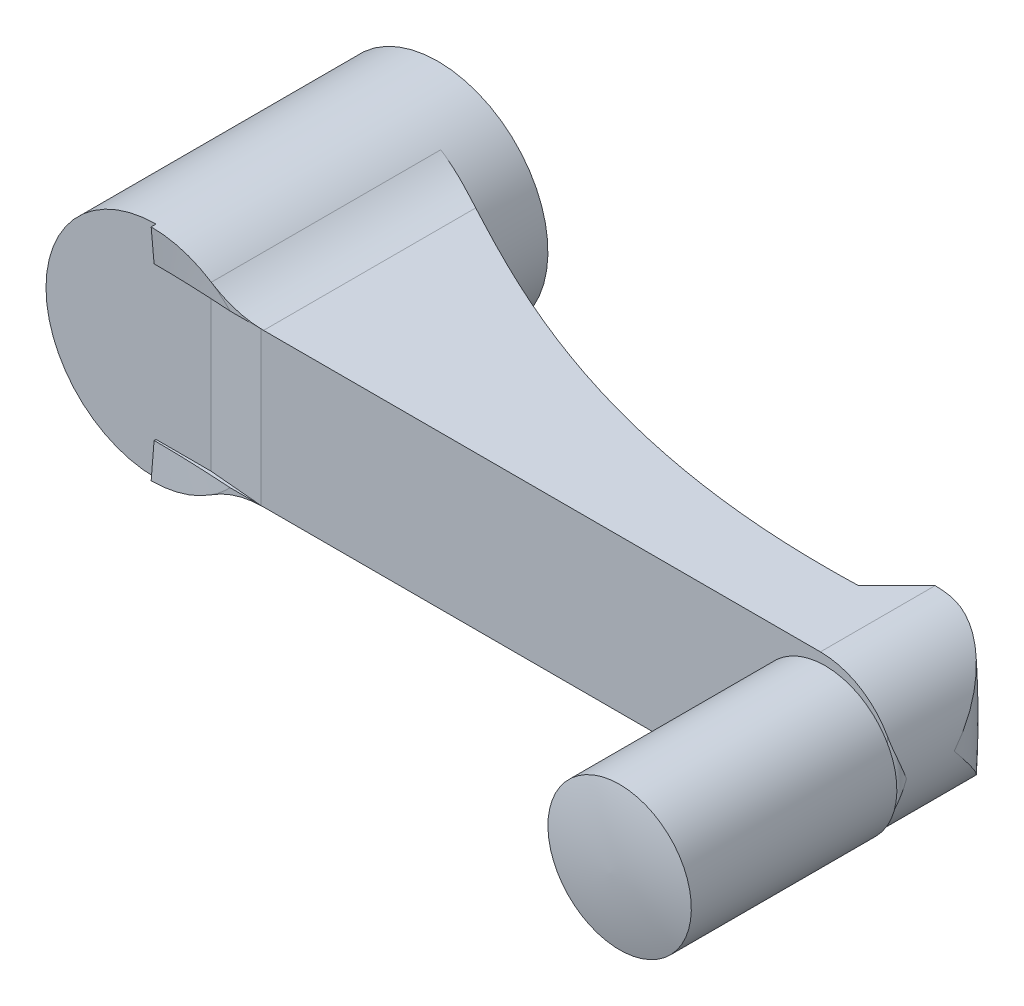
ISO-10303-21;
HEADER;
FILE_DESCRIPTION(('STEP AP214'),'2;1');
FILE_NAME('part.step','',(''),(''),'','','');
FILE_SCHEMA(('AUTOMOTIVE_DESIGN { 1 0 10303 214 1 1 1 1 }'));
ENDSEC;
DATA;
#1=APPLICATION_CONTEXT('core data for automotive mechanical design processes');
#2=APPLICATION_PROTOCOL_DEFINITION('international standard','automotive_design',2000,#1);
#3=PRODUCT_CONTEXT('',#1,'mechanical');
#4=PRODUCT('Part','Part','',(#3));
#5=PRODUCT_RELATED_PRODUCT_CATEGORY('part','',(#4));
#6=PRODUCT_DEFINITION_FORMATION('','',#4);
#7=PRODUCT_DEFINITION_CONTEXT('part definition',#1,'design');
#8=PRODUCT_DEFINITION('design','',#6,#7);
#9=PRODUCT_DEFINITION_SHAPE('','',#8);
#10=(LENGTH_UNIT() NAMED_UNIT(*) SI_UNIT(.MILLI.,.METRE.));
#11=(NAMED_UNIT(*) PLANE_ANGLE_UNIT() SI_UNIT($,.RADIAN.));
#12=(NAMED_UNIT(*) SI_UNIT($,.STERADIAN.) SOLID_ANGLE_UNIT());
#13=UNCERTAINTY_MEASURE_WITH_UNIT(LENGTH_MEASURE(1.E-05),#10,'distance_accuracy_value','');
#14=(GEOMETRIC_REPRESENTATION_CONTEXT(3) GLOBAL_UNCERTAINTY_ASSIGNED_CONTEXT((#13)) GLOBAL_UNIT_ASSIGNED_CONTEXT((#10,
#11,#12)) REPRESENTATION_CONTEXT('',''));
#15=CARTESIAN_POINT('',(0.,0.,0.));
#16=DIRECTION('',(0.,0.,1.));
#17=DIRECTION('',(1.,0.,0.));
#18=AXIS2_PLACEMENT_3D('',#15,#16,#17);
#19=CARTESIAN_POINT('',(11.5,0.,0.));
#20=DIRECTION('',(0.,0.,1.));
#21=DIRECTION('',(0.,-1.,0.));
#22=AXIS2_PLACEMENT_3D('',#19,#20,#21);
#23=PLANE('',#22);
#24=CARTESIAN_POINT('',(0.,0.,0.));
#25=DIRECTION('',(0.,0.,-1.));
#26=DIRECTION('',(0.,1.,0.));
#27=AXIS2_PLACEMENT_3D('',#24,#25,#26);
#28=CIRCLE('',#27,11.5);
#29=CARTESIAN_POINT('',(0.,11.5,0.));
#30=VERTEX_POINT('',#29);
#31=EDGE_CURVE('E318',#30,#30,#28,.T.);
#32=ORIENTED_EDGE('',*,*,#31,.T.);
#33=EDGE_LOOP('',(#32));
#34=FACE_BOUND('',#33,.T.);
#35=CARTESIAN_POINT('',(0.,0.,0.));
#36=DIRECTION('',(0.,0.,-1.));
#37=DIRECTION('',(0.,1.,0.));
#38=AXIS2_PLACEMENT_3D('',#35,#36,#37);
#39=CIRCLE('',#38,5.);
#40=CARTESIAN_POINT('',(0.,5.,0.));
#41=VERTEX_POINT('',#40);
#42=EDGE_CURVE('E663',#41,#41,#39,.T.);
#43=ORIENTED_EDGE('',*,*,#42,.F.);
#44=EDGE_LOOP('',(#43));
#45=FACE_BOUND('',#44,.T.);
#46=ADVANCED_FACE('F14',(#34,#45),#23,.F.);
#47=CARTESIAN_POINT('',(0.,0.,30.));
#48=DIRECTION('',(0.,0.,1.));
#49=DIRECTION('',(0.,-1.,0.));
#50=AXIS2_PLACEMENT_3D('',#47,#48,#49);
#51=PLANE('',#50);
#52=CARTESIAN_POINT('',(11.7579760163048,18.,30.));
#53=DIRECTION('',(0.,0.,1.));
#54=DIRECTION('',(1.,0.,0.));
#55=AXIS2_PLACEMENT_3D('',#52,#53,#54);
#56=CIRCLE('',#55,10.);
#57=CARTESIAN_POINT('',(6.28914996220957,9.62790697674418,30.));
#58=VERTEX_POINT('',#57);
#59=CARTESIAN_POINT('',(11.7579760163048,8.,30.));
#60=VERTEX_POINT('',#59);
#61=EDGE_CURVE('E358',#58,#60,#56,.T.);
#62=ORIENTED_EDGE('',*,*,#61,.F.);
#63=CARTESIAN_POINT('',(0.,0.,30.));
#64=DIRECTION('',(0.,0.,-1.));
#65=DIRECTION('',(0.,1.,0.));
#66=AXIS2_PLACEMENT_3D('',#63,#64,#65);
#67=CIRCLE('',#66,11.5);
#68=CARTESIAN_POINT('',(8.26135582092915,8.,30.));
#69=VERTEX_POINT('',#68);
#70=EDGE_CURVE('E173',#58,#69,#67,.T.);
#71=ORIENTED_EDGE('',*,*,#70,.T.);
#72=DIRECTION('',(1.,0.,0.));
#73=VECTOR('',#72,1.);
#74=CARTESIAN_POINT('',(0.,8.,30.));
#75=LINE('',#74,#73);
#76=CARTESIAN_POINT('',(11.5,8.,30.));
#77=VERTEX_POINT('',#76);
#78=EDGE_CURVE('E402',#69,#77,#75,.T.);
#79=ORIENTED_EDGE('',*,*,#78,.T.);
#80=DIRECTION('',(0.,1.,0.));
#81=VECTOR('',#80,1.);
#82=CARTESIAN_POINT('',(11.5,-8.,30.));
#83=LINE('',#82,#81);
#84=CARTESIAN_POINT('',(11.5,-8.,30.));
#85=VERTEX_POINT('',#84);
#86=EDGE_CURVE('E430',#85,#77,#83,.T.);
#87=ORIENTED_EDGE('',*,*,#86,.F.);
#88=DIRECTION('',(1.,0.,0.));
#89=VECTOR('',#88,1.);
#90=CARTESIAN_POINT('',(0.,-8.,30.));
#91=LINE('',#90,#89);
#92=CARTESIAN_POINT('',(8.26135582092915,-8.,30.));
#93=VERTEX_POINT('',#92);
#94=EDGE_CURVE('E437',#93,#85,#91,.T.);
#95=ORIENTED_EDGE('',*,*,#94,.F.);
#96=CARTESIAN_POINT('',(6.28914996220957,-9.62790697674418,30.));
#97=VERTEX_POINT('',#96);
#98=EDGE_CURVE('E170',#93,#97,#67,.T.);
#99=ORIENTED_EDGE('',*,*,#98,.T.);
#100=CARTESIAN_POINT('',(11.7579760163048,-18.,30.));
#101=DIRECTION('',(0.,0.,1.));
#102=DIRECTION('',(1.,0.,0.));
#103=AXIS2_PLACEMENT_3D('',#100,#101,#102);
#104=CIRCLE('',#103,10.);
#105=CARTESIAN_POINT('',(11.7579760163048,-8.,30.));
#106=VERTEX_POINT('',#105);
#107=EDGE_CURVE('E361',#106,#97,#104,.T.);
#108=ORIENTED_EDGE('',*,*,#107,.F.);
#109=DIRECTION('',(-1.,0.,0.));
#110=VECTOR('',#109,1.);
#111=CARTESIAN_POINT('',(70.,-8.,30.));
#112=LINE('',#111,#110);
#113=CARTESIAN_POINT('',(70.,-8.,30.));
#114=VERTEX_POINT('',#113);
#115=EDGE_CURVE('E357',#114,#106,#112,.T.);
#116=ORIENTED_EDGE('',*,*,#115,.F.);
#117=CARTESIAN_POINT('',(70.,0.,30.));
#118=DIRECTION('',(0.,0.,1.));
#119=DIRECTION('',(0.,-1.,0.));
#120=AXIS2_PLACEMENT_3D('',#117,#118,#119);
#121=CIRCLE('',#120,8.);
#122=CARTESIAN_POINT('',(77.,-3.87298334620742,30.));
#123=VERTEX_POINT('',#122);
#124=EDGE_CURVE('E328',#114,#123,#121,.T.);
#125=ORIENTED_EDGE('',*,*,#124,.T.);
#126=DIRECTION('',(0.,1.,0.));
#127=VECTOR('',#126,1.);
#128=CARTESIAN_POINT('',(77.,-8.,30.));
#129=LINE('',#128,#127);
#130=CARTESIAN_POINT('',(77.,3.87298334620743,30.));
#131=VERTEX_POINT('',#130);
#132=EDGE_CURVE('E341',#123,#131,#129,.T.);
#133=ORIENTED_EDGE('',*,*,#132,.T.);
#134=CARTESIAN_POINT('',(70.,8.,30.));
#135=VERTEX_POINT('',#134);
#136=EDGE_CURVE('E322',#131,#135,#121,.T.);
#137=ORIENTED_EDGE('',*,*,#136,.T.);
#138=DIRECTION('',(1.,0.,0.));
#139=VECTOR('',#138,1.);
#140=CARTESIAN_POINT('',(11.7579760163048,8.,30.));
#141=LINE('',#140,#139);
#142=EDGE_CURVE('E340',#60,#135,#141,.T.);
#143=ORIENTED_EDGE('',*,*,#142,.F.);
#144=EDGE_LOOP('',(#62,#71,#79,#87,#95,#99,#108,#116,#125,#133,#137,#143));
#145=FACE_BOUND('',#144,.T.);
#146=CARTESIAN_POINT('',(71.,0.,30.));
#147=DIRECTION('',(0.,0.,-1.));
#148=DIRECTION('',(0.,1.,0.));
#149=AXIS2_PLACEMENT_3D('',#146,#147,#148);
#150=CIRCLE('',#149,4.);
#151=CARTESIAN_POINT('',(71.,4.,30.));
#152=VERTEX_POINT('',#151);
#153=EDGE_CURVE('E667',#152,#152,#150,.T.);
#154=ORIENTED_EDGE('',*,*,#153,.T.);
#155=EDGE_LOOP('',(#154));
#156=FACE_BOUND('',#155,.T.);
#157=ADVANCED_FACE('F292',(#145,#156),#51,.T.);
#158=CARTESIAN_POINT('',(0.,11.5,0.));
#159=DIRECTION('',(-1.,0.,0.));
#160=DIRECTION('',(0.,-1.,0.));
#161=AXIS2_PLACEMENT_3D('',#158,#159,#160);
#162=PLANE('',#161);
#163=DIRECTION('',(0.,0.,1.));
#164=VECTOR('',#163,1.);
#165=CARTESIAN_POINT('',(0.,8.,0.));
#166=LINE('',#165,#164);
#167=CARTESIAN_POINT('',(0.,8.,29.5));
#168=VERTEX_POINT('',#167);
#169=CARTESIAN_POINT('',(0.,8.,29.6956521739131));
#170=VERTEX_POINT('',#169);
#171=EDGE_CURVE('E395',#168,#170,#166,.T.);
#172=ORIENTED_EDGE('',*,*,#171,.T.);
#173=DIRECTION('',(0.,-0.996240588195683,-0.0866296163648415));
#174=VECTOR('',#173,1.);
#175=CARTESIAN_POINT('',(0.,11.5,30.));
#176=LINE('',#175,#174);
#177=CARTESIAN_POINT('',(0.,11.5,30.));
#178=VERTEX_POINT('',#177);
#179=EDGE_CURVE('E162',#178,#170,#176,.T.);
#180=ORIENTED_EDGE('',*,*,#179,.F.);
#181=DIRECTION('',(0.,0.,1.));
#182=VECTOR('',#181,1.);
#183=CARTESIAN_POINT('',(0.,11.5,0.));
#184=LINE('',#183,#182);
#185=CARTESIAN_POINT('',(0.,11.5,29.5));
#186=VERTEX_POINT('',#185);
#187=EDGE_CURVE('E382',#186,#178,#184,.T.);
#188=ORIENTED_EDGE('',*,*,#187,.F.);
#189=DIRECTION('',(0.,1.,0.));
#190=VECTOR('',#189,1.);
#191=CARTESIAN_POINT('',(0.,0.,29.5));
#192=LINE('',#191,#190);
#193=EDGE_CURVE('E325',#168,#186,#192,.T.);
#194=ORIENTED_EDGE('',*,*,#193,.F.);
#195=EDGE_LOOP('',(#172,#180,#188,#194));
#196=FACE_BOUND('',#195,.T.);
#197=ADVANCED_FACE('F299',(#196),#162,.T.);
#198=DIRECTION('',(0.,0.,1.));
#199=VECTOR('',#198,1.);
#200=CARTESIAN_POINT('',(0.,-11.5,0.));
#201=LINE('',#200,#199);
#202=CARTESIAN_POINT('',(0.,-11.5,29.5));
#203=VERTEX_POINT('',#202);
#204=CARTESIAN_POINT('',(0.,-11.5,30.));
#205=VERTEX_POINT('',#204);
#206=EDGE_CURVE('E380',#203,#205,#201,.T.);
#207=ORIENTED_EDGE('',*,*,#206,.T.);
#208=DIRECTION('',(0.,0.996240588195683,-0.0866296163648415));
#209=VECTOR('',#208,1.);
#210=CARTESIAN_POINT('',(0.,-11.5,30.));
#211=LINE('',#210,#209);
#212=CARTESIAN_POINT('',(0.,-8.,29.6956521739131));
#213=VERTEX_POINT('',#212);
#214=EDGE_CURVE('E158',#205,#213,#211,.T.);
#215=ORIENTED_EDGE('',*,*,#214,.T.);
#216=DIRECTION('',(0.,0.,1.));
#217=VECTOR('',#216,1.);
#218=CARTESIAN_POINT('',(0.,-8.,0.));
#219=LINE('',#218,#217);
#220=CARTESIAN_POINT('',(0.,-8.,29.5));
#221=VERTEX_POINT('',#220);
#222=EDGE_CURVE('E434',#221,#213,#219,.T.);
#223=ORIENTED_EDGE('',*,*,#222,.F.);
#224=EDGE_CURVE('E320',#203,#221,#192,.T.);
#225=ORIENTED_EDGE('',*,*,#224,.F.);
#226=EDGE_LOOP('',(#207,#215,#223,#225));
#227=FACE_BOUND('',#226,.T.);
#228=ADVANCED_FACE('F252',(#227),#162,.T.);
#229=CARTESIAN_POINT('',(70.,0.,0.));
#230=DIRECTION('',(0.,0.,1.));
#231=DIRECTION('',(0.,-1.,0.));
#232=AXIS2_PLACEMENT_3D('',#229,#230,#231);
#233=CYLINDRICAL_SURFACE('',#232,8.);
#234=CARTESIAN_POINT('',(70.,0.,18.));
#235=DIRECTION('',(0.,0.,-1.));
#236=DIRECTION('',(0.,1.,0.));
#237=AXIS2_PLACEMENT_3D('',#234,#235,#236);
#238=CIRCLE('',#237,8.);
#239=CARTESIAN_POINT('',(70.,-8.,18.));
#240=VERTEX_POINT('',#239);
#241=CARTESIAN_POINT('',(71.5714285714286,-7.84414509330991,18.));
#242=VERTEX_POINT('',#241);
#243=EDGE_CURVE('E28',#240,#242,#238,.F.);
#244=ORIENTED_EDGE('',*,*,#243,.T.);
#245=CARTESIAN_POINT('',(78.0000000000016,0.,24.));
#246=CARTESIAN_POINT('',(78.0000000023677,-0.00486613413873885,23.9960077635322));
#247=CARTESIAN_POINT('',(77.9999955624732,-0.00973238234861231,23.9920154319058));
#248=CARTESIAN_POINT('',(77.9989474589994,-0.583933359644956,23.5209335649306));
#249=CARTESIAN_POINT('',(77.9370971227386,-1.15474286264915,23.0526205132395));
#250=CARTESIAN_POINT('',(77.7516154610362,-1.99901311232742,22.3613246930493));
#251=CARTESIAN_POINT('',(77.6741131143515,-2.27894012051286,22.1323520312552));
#252=CARTESIAN_POINT('',(77.4873447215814,-2.83283026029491,21.6800925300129));
#253=CARTESIAN_POINT('',(77.3780940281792,-3.10679620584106,21.4568029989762));
#254=CARTESIAN_POINT('',(77.1583752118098,-3.57875328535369,21.073278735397));
#255=CARTESIAN_POINT('',(77.0550333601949,-3.77862208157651,20.9112304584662));
#256=CARTESIAN_POINT('',(76.8295391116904,-4.17239340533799,20.5929993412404));
#257=CARTESIAN_POINT('',(76.7073867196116,-4.36629593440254,20.4368164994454));
#258=CARTESIAN_POINT('',(76.4440138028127,-4.7463691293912,20.1321084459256));
#259=CARTESIAN_POINT('',(76.3028287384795,-4.93255335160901,19.9835696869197));
#260=CARTESIAN_POINT('',(76.0008661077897,-5.29579417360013,19.6957649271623));
#261=CARTESIAN_POINT('',(75.8400944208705,-5.47285348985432,19.556496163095));
#262=CARTESIAN_POINT('',(75.4158086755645,-5.89896054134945,19.2247651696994));
#263=CARTESIAN_POINT('',(75.1401346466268,-6.14155129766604,19.0390358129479));
#264=CARTESIAN_POINT('',(74.6938147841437,-6.48097899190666,18.7866007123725));
#265=CARTESIAN_POINT('',(74.5395898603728,-6.59003578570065,18.7068219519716));
#266=CARTESIAN_POINT('',(74.2203067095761,-6.79892280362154,18.5573768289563));
#267=CARTESIAN_POINT('',(74.0552509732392,-6.89875513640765,18.4877081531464));
#268=CARTESIAN_POINT('',(73.7506764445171,-7.06796122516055,18.3735769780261));
#269=CARTESIAN_POINT('',(73.6130885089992,-7.1393248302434,18.3268949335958));
#270=CARTESIAN_POINT('',(73.3319273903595,-7.27479165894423,18.2417676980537));
#271=CARTESIAN_POINT('',(73.1883555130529,-7.33889645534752,18.2033207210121));
#272=CARTESIAN_POINT('',(72.8958857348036,-7.45914424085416,18.1356023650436));
#273=CARTESIAN_POINT('',(72.7469905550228,-7.51529122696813,18.1063263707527));
#274=CARTESIAN_POINT('',(72.4446362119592,-7.61900794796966,18.0578616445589));
#275=CARTESIAN_POINT('',(72.2911777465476,-7.66657898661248,18.0386713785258));
#276=CARTESIAN_POINT('',(72.0007881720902,-7.74703375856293,18.0130295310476));
#277=CARTESIAN_POINT('',(71.8642786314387,-7.78102051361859,18.0052540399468));
#278=CARTESIAN_POINT('',(71.5894546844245,-7.84177456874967,17.9985448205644));
#279=CARTESIAN_POINT('',(71.4511405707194,-7.86854302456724,17.9996096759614));
#280=CARTESIAN_POINT('',(71.1738684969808,-7.91465460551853,18.0109935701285));
#281=CARTESIAN_POINT('',(71.034911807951,-7.93400876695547,18.021298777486));
#282=CARTESIAN_POINT('',(70.757248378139,-7.96530448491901,18.0514359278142));
#283=CARTESIAN_POINT('',(70.6185415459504,-7.97724982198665,18.0712630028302));
#284=CARTESIAN_POINT('',(70.3997522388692,-7.99041622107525,18.1103389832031));
#285=CARTESIAN_POINT('',(70.3192273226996,-7.99403054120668,18.1264137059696));
#286=CARTESIAN_POINT('',(70.1589266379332,-7.99882313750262,18.1618475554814));
#287=CARTESIAN_POINT('',(70.0791501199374,-8.00000418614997,18.1812029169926));
#288=CARTESIAN_POINT('',(69.9998,-7.9999999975,18.2022073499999));
#289=B_SPLINE_CURVE_WITH_KNOTS('',3,(#245,#246,#247,#248,#249,#250,#251,#252,#253,#254,#255,
#256,#257,#258,#259,#260,#261,#262,#263,#264,#265,#266,#267,#268,#269,#270,#271,#272,#273,#274,
#275,#276,#277,#278,#279,#280,#281,#282,#283,#284,#285,#286,#287,#288),.UNSPECIFIED.,.F.,.F.,(4,
2,2,2,2,2,2,2,2,2,2,2,2,2,2,2,2,2,2,2,2,4),(0.,0.018883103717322,2.22809360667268,
3.33670701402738,4.44478521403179,5.27596799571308,6.10715056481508,6.9368053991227,
7.76621180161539,8.99556235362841,9.61011877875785,10.2245343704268,10.7097172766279,
11.1947948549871,11.6796279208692,12.1643872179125,12.5866147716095,13.0087746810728,
13.4303037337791,13.8516175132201,14.0981018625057,14.3443052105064),.UNSPECIFIED.);
#290=CARTESIAN_POINT('',(78.,0.,24.));
#291=VERTEX_POINT('',#290);
#292=EDGE_CURVE('E456',#242,#291,#289,.F.);
#293=ORIENTED_EDGE('',*,*,#292,.T.);
#294=CARTESIAN_POINT('',(78.0000000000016,0.,24.));
#295=CARTESIAN_POINT('',(78.0000000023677,0.00486613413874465,23.9960077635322));
#296=CARTESIAN_POINT('',(77.9999955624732,0.00973238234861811,23.9920154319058));
#297=CARTESIAN_POINT('',(77.9989474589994,0.583933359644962,23.5209335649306));
#298=CARTESIAN_POINT('',(77.9370971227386,1.15474286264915,23.0526205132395));
#299=CARTESIAN_POINT('',(77.7516154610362,1.99901311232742,22.3613246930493));
#300=CARTESIAN_POINT('',(77.6741131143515,2.27894012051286,22.1323520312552));
#301=CARTESIAN_POINT('',(77.4873447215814,2.83283026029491,21.6800925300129));
#302=CARTESIAN_POINT('',(77.3780940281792,3.10679620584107,21.4568029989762));
#303=CARTESIAN_POINT('',(77.1583752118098,3.57875328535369,21.073278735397));
#304=CARTESIAN_POINT('',(77.0550333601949,3.77862208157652,20.9112304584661));
#305=CARTESIAN_POINT('',(76.8295391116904,4.172393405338,20.5929993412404));
#306=CARTESIAN_POINT('',(76.7073867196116,4.36629593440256,20.4368164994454));
#307=CARTESIAN_POINT('',(76.4440138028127,4.74636912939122,20.1321084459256));
#308=CARTESIAN_POINT('',(76.3028287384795,4.93255335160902,19.9835696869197));
#309=CARTESIAN_POINT('',(76.0008661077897,5.29579417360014,19.6957649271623));
#310=CARTESIAN_POINT('',(75.8400944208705,5.47285348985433,19.556496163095));
#311=CARTESIAN_POINT('',(75.4158086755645,5.89896054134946,19.2247651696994));
#312=CARTESIAN_POINT('',(75.1401346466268,6.14155129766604,19.0390358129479));
#313=CARTESIAN_POINT('',(74.6938147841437,6.48097899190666,18.7866007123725));
#314=CARTESIAN_POINT('',(74.5395898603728,6.59003578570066,18.7068219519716));
#315=CARTESIAN_POINT('',(74.2203067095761,6.79892280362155,18.5573768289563));
#316=CARTESIAN_POINT('',(74.0552509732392,6.89875513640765,18.4877081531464));
#317=CARTESIAN_POINT('',(73.7506764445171,7.06796122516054,18.3735769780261));
#318=CARTESIAN_POINT('',(73.6130885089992,7.1393248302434,18.3268949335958));
#319=CARTESIAN_POINT('',(73.3319273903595,7.27479165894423,18.2417676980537));
#320=CARTESIAN_POINT('',(73.1883555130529,7.33889645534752,18.2033207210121));
#321=CARTESIAN_POINT('',(72.8958857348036,7.45914424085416,18.1356023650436));
#322=CARTESIAN_POINT('',(72.7469905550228,7.51529122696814,18.1063263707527));
#323=CARTESIAN_POINT('',(72.4446362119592,7.61900794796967,18.0578616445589));
#324=CARTESIAN_POINT('',(72.2911777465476,7.66657898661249,18.0386713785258));
#325=CARTESIAN_POINT('',(72.0007881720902,7.74703375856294,18.0130295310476));
#326=CARTESIAN_POINT('',(71.8642786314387,7.7810205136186,18.0052540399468));
#327=CARTESIAN_POINT('',(71.5894546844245,7.84177456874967,17.9985448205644));
#328=CARTESIAN_POINT('',(71.4511405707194,7.86854302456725,17.9996096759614));
#329=CARTESIAN_POINT('',(71.1738684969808,7.91465460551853,18.0109935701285));
#330=CARTESIAN_POINT('',(71.034911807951,7.93400876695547,18.021298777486));
#331=CARTESIAN_POINT('',(70.757248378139,7.96530448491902,18.0514359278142));
#332=CARTESIAN_POINT('',(70.6185415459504,7.97724982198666,18.0712630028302));
#333=CARTESIAN_POINT('',(70.3997522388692,7.99041622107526,18.1103389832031));
#334=CARTESIAN_POINT('',(70.3192273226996,7.99403054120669,18.1264137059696));
#335=CARTESIAN_POINT('',(70.1589266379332,7.99882313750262,18.1618475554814));
#336=CARTESIAN_POINT('',(70.0791501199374,8.00000418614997,18.1812029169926));
#337=CARTESIAN_POINT('',(69.9998,7.9999999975,18.2022073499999));
#338=B_SPLINE_CURVE_WITH_KNOTS('',3,(#294,#295,#296,#297,#298,#299,#300,#301,#302,#303,#304,
#305,#306,#307,#308,#309,#310,#311,#312,#313,#314,#315,#316,#317,#318,#319,#320,#321,#322,#323,
#324,#325,#326,#327,#328,#329,#330,#331,#332,#333,#334,#335,#336,#337),.UNSPECIFIED.,.F.,.F.,(4,
2,2,2,2,2,2,2,2,2,2,2,2,2,2,2,2,2,2,2,2,4),(0.,0.018883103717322,2.22809360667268,
3.33670701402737,4.44478521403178,5.27596799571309,6.10715056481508,6.93680539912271,
7.76621180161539,8.99556235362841,9.61011877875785,10.2245343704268,10.7097172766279,
11.1947948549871,11.6796279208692,12.1643872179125,12.5866147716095,13.0087746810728,
13.4303037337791,13.8516175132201,14.0981018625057,14.3443052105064),.UNSPECIFIED.);
#339=CARTESIAN_POINT('',(71.5714285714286,7.84414509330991,18.));
#340=VERTEX_POINT('',#339);
#341=EDGE_CURVE('E259',#291,#340,#338,.T.);
#342=ORIENTED_EDGE('',*,*,#341,.T.);
#343=CARTESIAN_POINT('',(70.,8.,18.));
#344=VERTEX_POINT('',#343);
#345=EDGE_CURVE('E273',#340,#344,#238,.F.);
#346=ORIENTED_EDGE('',*,*,#345,.T.);
#347=DIRECTION('',(0.,0.,1.));
#348=VECTOR('',#347,1.);
#349=CARTESIAN_POINT('',(70.,8.,0.));
#350=LINE('',#349,#348);
#351=EDGE_CURVE('E344',#344,#135,#350,.T.);
#352=ORIENTED_EDGE('',*,*,#351,.T.);
#353=ORIENTED_EDGE('',*,*,#136,.F.);
#354=CARTESIAN_POINT('',(77.,3.87298334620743,30.));
#355=CARTESIAN_POINT('',(77.0320487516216,3.81506111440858,29.9999909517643));
#356=CARTESIAN_POINT('',(77.0633658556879,3.75675902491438,29.9984605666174));
#357=CARTESIAN_POINT('',(77.124480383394,3.63952511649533,29.9926983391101));
#358=CARTESIAN_POINT('',(77.1542784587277,3.58059358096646,29.9884676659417));
#359=CARTESIAN_POINT('',(77.241218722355,3.40324230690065,29.9722589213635));
#360=CARTESIAN_POINT('',(77.2960525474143,3.28400247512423,29.9567609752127));
#361=CARTESIAN_POINT('',(77.3991566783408,3.04456972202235,29.9185214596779));
#362=CARTESIAN_POINT('',(77.4474555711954,2.92438355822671,29.8958129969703));
#363=CARTESIAN_POINT('',(77.5378429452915,2.68282861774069,29.8446429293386));
#364=CARTESIAN_POINT('',(77.5799268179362,2.56145903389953,29.8161770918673));
#365=CARTESIAN_POINT('',(77.6827368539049,2.24038507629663,29.73517218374));
#366=CARTESIAN_POINT('',(77.7382927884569,2.03996193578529,29.6788382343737));
#367=CARTESIAN_POINT('',(77.8332865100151,1.63779800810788,29.5581494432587));
#368=CARTESIAN_POINT('',(77.8727175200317,1.43605670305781,29.4937912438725));
#369=CARTESIAN_POINT('',(77.9674219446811,0.82929357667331,29.2932012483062));
#370=CARTESIAN_POINT('',(77.999127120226,0.42266785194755,29.149435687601));
#371=CARTESIAN_POINT('',(77.9999940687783,0.0112434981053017,29.0039751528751));
#372=CARTESIAN_POINT('',(77.9999999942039,0.00562166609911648,29.0019875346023));
#373=CARTESIAN_POINT('',(78.,0.,29.));
#374=B_SPLINE_CURVE_WITH_KNOTS('',3,(#354,#355,#356,#357,#358,#359,#360,#361,#362,#363,#364,
#365,#366,#367,#368,#369,#370,#371,#372,#373),.UNSPECIFIED.,.F.,.F.,(4,2,2,2,2,2,2,2,2,4),(0.,
0.198535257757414,0.396984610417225,0.792983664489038,1.18719018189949,1.5816875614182,
2.22713013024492,2.87284368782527,4.16406208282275,4.18195063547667),.UNSPECIFIED.);
#375=CARTESIAN_POINT('',(78.,0.,29.));
#376=VERTEX_POINT('',#375);
#377=EDGE_CURVE('E267',#376,#131,#374,.F.);
#378=ORIENTED_EDGE('',*,*,#377,.F.);
#379=CARTESIAN_POINT('',(77.,-3.87298334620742,30.));
#380=CARTESIAN_POINT('',(77.0320487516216,-3.81506111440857,29.9999909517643));
#381=CARTESIAN_POINT('',(77.0633658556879,-3.75675902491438,29.9984605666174));
#382=CARTESIAN_POINT('',(77.124480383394,-3.63952511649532,29.9926983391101));
#383=CARTESIAN_POINT('',(77.1542784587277,-3.58059358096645,29.9884676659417));
#384=CARTESIAN_POINT('',(77.241218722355,-3.40324230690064,29.9722589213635));
#385=CARTESIAN_POINT('',(77.2960525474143,-3.28400247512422,29.9567609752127));
#386=CARTESIAN_POINT('',(77.3991566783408,-3.04456972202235,29.9185214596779));
#387=CARTESIAN_POINT('',(77.4474555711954,-2.92438355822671,29.8958129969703));
#388=CARTESIAN_POINT('',(77.5378429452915,-2.68282861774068,29.8446429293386));
#389=CARTESIAN_POINT('',(77.5799268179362,-2.56145903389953,29.8161770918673));
#390=CARTESIAN_POINT('',(77.6827368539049,-2.24038507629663,29.73517218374));
#391=CARTESIAN_POINT('',(77.7382927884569,-2.03996193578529,29.6788382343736));
#392=CARTESIAN_POINT('',(77.8332865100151,-1.63779800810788,29.5581494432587));
#393=CARTESIAN_POINT('',(77.8727175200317,-1.4360567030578,29.4937912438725));
#394=CARTESIAN_POINT('',(77.9674219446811,-0.829293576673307,29.2932012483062));
#395=CARTESIAN_POINT('',(77.999127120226,-0.422667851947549,29.1494356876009));
#396=CARTESIAN_POINT('',(77.9999940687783,-0.0112434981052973,29.0039751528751));
#397=CARTESIAN_POINT('',(77.9999999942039,-0.00562166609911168,29.0019875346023));
#398=CARTESIAN_POINT('',(78.,0.,29.));
#399=B_SPLINE_CURVE_WITH_KNOTS('',3,(#379,#380,#381,#382,#383,#384,#385,#386,#387,#388,#389,
#390,#391,#392,#393,#394,#395,#396,#397,#398),.UNSPECIFIED.,.F.,.F.,(4,2,2,2,2,2,2,2,2,4),(0.,
0.198535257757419,0.396984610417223,0.792983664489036,1.18719018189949,1.58168756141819,
2.22713013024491,2.87284368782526,4.16406208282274,4.18195063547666),.UNSPECIFIED.);
#400=EDGE_CURVE('E9',#123,#376,#399,.T.);
#401=ORIENTED_EDGE('',*,*,#400,.F.);
#402=ORIENTED_EDGE('',*,*,#124,.F.);
#403=DIRECTION('',(0.,0.,1.));
#404=VECTOR('',#403,1.);
#405=CARTESIAN_POINT('',(70.,-8.,0.));
#406=LINE('',#405,#404);
#407=EDGE_CURVE('E351',#240,#114,#406,.T.);
#408=ORIENTED_EDGE('',*,*,#407,.F.);
#409=EDGE_LOOP('',(#244,#293,#342,#346,#352,#353,#378,#401,#402,#408));
#410=FACE_BOUND('',#409,.T.);
#411=ADVANCED_FACE('F249',(#410),#233,.T.);
#412=CARTESIAN_POINT('',(72.,-8.,18.));
#413=DIRECTION('',(0.,0.,-1.));
#414=DIRECTION('',(0.,1.,0.));
#415=AXIS2_PLACEMENT_3D('',#412,#413,#414);
#416=PLANE('',#415);
#417=ORIENTED_EDGE('',*,*,#345,.F.);
#418=CARTESIAN_POINT('',(0.,0.,18.));
#419=DIRECTION('',(0.,0.,-1.));
#420=DIRECTION('',(0.,1.,0.));
#421=AXIS2_PLACEMENT_3D('',#418,#419,#420);
#422=CIRCLE('',#421,72.);
#423=EDGE_CURVE('E43',#340,#242,#422,.T.);
#424=ORIENTED_EDGE('',*,*,#423,.T.);
#425=ORIENTED_EDGE('',*,*,#243,.F.);
#426=DIRECTION('',(0.,1.,0.));
#427=VECTOR('',#426,1.);
#428=CARTESIAN_POINT('',(70.,-8.,18.));
#429=LINE('',#428,#427);
#430=EDGE_CURVE('E414',#240,#344,#429,.T.);
#431=ORIENTED_EDGE('',*,*,#430,.T.);
#432=EDGE_LOOP('',(#417,#424,#425,#431));
#433=FACE_BOUND('',#432,.T.);
#434=ADVANCED_FACE('F206',(#433),#416,.T.);
#435=CARTESIAN_POINT('',(77.,8.,29.));
#436=DIRECTION('',(0.,-1.,0.));
#437=DIRECTION('',(1.,0.,0.));
#438=AXIS2_PLACEMENT_3D('',#435,#436,#437);
#439=PLANE('',#438);
#440=ORIENTED_EDGE('',*,*,#78,.F.);
#441=CARTESIAN_POINT('',(-6.7094432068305,8.,29.9079219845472));
#442=CARTESIAN_POINT('',(-6.37010215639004,8.,29.8889695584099));
#443=CARTESIAN_POINT('',(-6.03071580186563,8.,29.8708410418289));
#444=CARTESIAN_POINT('',(-5.3518329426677,8.,29.8366148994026));
#445=CARTESIAN_POINT('',(-5.01233643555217,8.,29.820517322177));
#446=CARTESIAN_POINT('',(-3.99358516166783,8.,29.7758429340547));
#447=CARTESIAN_POINT('',(-3.31416016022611,8.,29.7508897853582));
#448=CARTESIAN_POINT('',(-2.2952476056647,8.,29.7231739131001));
#449=CARTESIAN_POINT('',(-1.95588991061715,8.,29.7155562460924));
#450=CARTESIAN_POINT('',(-1.27711178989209,8.,29.7038669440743));
#451=CARTESIAN_POINT('',(-0.937691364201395,8.,29.6997953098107));
#452=CARTESIAN_POINT('',(-0.258851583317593,8.,29.695394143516));
#453=CARTESIAN_POINT('',(0.0805677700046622,8.,29.6950643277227));
#454=CARTESIAN_POINT('',(0.759388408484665,8.,29.6981558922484));
#455=CARTESIAN_POINT('',(1.09878969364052,8.,29.70157727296));
#456=CARTESIAN_POINT('',(2.11683241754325,8.,29.7172551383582));
#457=CARTESIAN_POINT('',(2.79539385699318,8.,29.7349248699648));
#458=CARTESIAN_POINT('',(4.15212719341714,8.,29.781882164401));
#459=CARTESIAN_POINT('',(4.8302990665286,8.,29.8111703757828));
#460=CARTESIAN_POINT('',(6.18673739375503,8.,29.8780595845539));
#461=CARTESIAN_POINT('',(6.86500352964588,8.,29.9156668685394));
#462=CARTESIAN_POINT('',(8.22117555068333,8.,29.9965716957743));
#463=CARTESIAN_POINT('',(8.89908144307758,8.,30.0398691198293));
#464=CARTESIAN_POINT('',(10.4408582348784,8.,30.1427544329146));
#465=CARTESIAN_POINT('',(11.3046478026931,8.,30.203549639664));
#466=CARTESIAN_POINT('',(13.0319431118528,8.,30.3290650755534));
#467=CARTESIAN_POINT('',(13.8954488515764,8.,30.3937853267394));
#468=CARTESIAN_POINT('',(15.6222864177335,8.,30.5258007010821));
#469=CARTESIAN_POINT('',(16.4856182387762,8.,30.5930958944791));
#470=CARTESIAN_POINT('',(18.2121439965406,8.,30.7294338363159));
#471=CARTESIAN_POINT('',(19.075337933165,8.,30.7984765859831));
#472=CARTESIAN_POINT('',(20.7994459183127,8.,30.9376176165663));
#473=CARTESIAN_POINT('',(21.6603602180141,8.,31.0077127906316));
#474=CARTESIAN_POINT('',(23.3821163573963,8.,31.1487950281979));
#475=CARTESIAN_POINT('',(24.2429581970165,8.,31.2197820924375));
#476=CARTESIAN_POINT('',(25.9645336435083,8.,31.3624159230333));
#477=CARTESIAN_POINT('',(26.8252672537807,8.,31.4340626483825));
#478=CARTESIAN_POINT('',(28.5466901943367,8.,31.5778729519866));
#479=CARTESIAN_POINT('',(29.4073795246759,8.,31.6500365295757));
#480=CARTESIAN_POINT('',(30.2680532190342,8.,31.7223850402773));
#481=B_SPLINE_CURVE_WITH_KNOTS('',3,(#441,#442,#443,#444,#445,#446,#447,#448,#449,#450,#451,
#452,#453,#454,#455,#456,#457,#458,#459,#460,#461,#462,#463,#464,#465,#466,#467,#468,#469,#470,
#471,#472,#473,#474,#475,#476,#477,#478,#479,#480),.UNSPECIFIED.,.F.,.F.,(4,2,2,2,2,2,2,2,2,2,2,
2,2,2,2,2,2,2,2,4),(0.,1.01960603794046,2.03923648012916,4.07877236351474,5.09708652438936,
6.1154008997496,7.1336380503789,8.15187530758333,10.1881064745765,12.2244513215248,
14.2623402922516,16.3001865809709,18.8979502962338,21.4957286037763,24.0935778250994,
26.6914288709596,29.2827176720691,31.8740086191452,34.4651395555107,37.0562671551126),.UNSPECIFIED.);
#482=EDGE_CURVE('E185',#69,#170,#481,.F.);
#483=ORIENTED_EDGE('',*,*,#482,.T.);
#484=ORIENTED_EDGE('',*,*,#171,.F.);
#485=DIRECTION('',(1.,0.,0.));
#486=VECTOR('',#485,1.);
#487=CARTESIAN_POINT('',(-10.,8.,29.5));
#488=LINE('',#487,#486);
#489=CARTESIAN_POINT('',(5.75,8.,29.5));
#490=VERTEX_POINT('',#489);
#491=EDGE_CURVE('E391',#168,#490,#488,.T.);
#492=ORIENTED_EDGE('',*,*,#491,.T.);
#493=DIRECTION('',(0.996240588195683,0.,0.0866296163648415));
#494=VECTOR('',#493,1.);
#495=CARTESIAN_POINT('',(5.75,8.,29.5));
#496=LINE('',#495,#494);
#497=EDGE_CURVE('E421',#490,#77,#496,.T.);
#498=ORIENTED_EDGE('',*,*,#497,.T.);
#499=EDGE_LOOP('',(#440,#483,#484,#492,#498));
#500=FACE_BOUND('',#499,.T.);
#501=ADVANCED_FACE('F200',(#500),#439,.T.);
#502=CARTESIAN_POINT('',(77.,-8.,29.));
#503=DIRECTION('',(0.,-1.,0.));
#504=DIRECTION('',(1.,0.,0.));
#505=AXIS2_PLACEMENT_3D('',#502,#503,#504);
#506=PLANE('',#505);
#507=CARTESIAN_POINT('',(-6.7094432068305,-8.,29.9079219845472));
#508=CARTESIAN_POINT('',(-6.37010215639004,-8.,29.8889695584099));
#509=CARTESIAN_POINT('',(-6.03071580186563,-8.,29.8708410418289));
#510=CARTESIAN_POINT('',(-5.3518329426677,-8.,29.8366148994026));
#511=CARTESIAN_POINT('',(-5.01233643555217,-8.,29.820517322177));
#512=CARTESIAN_POINT('',(-3.99358516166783,-8.,29.7758429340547));
#513=CARTESIAN_POINT('',(-3.31416016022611,-8.,29.7508897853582));
#514=CARTESIAN_POINT('',(-2.2952476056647,-8.,29.7231739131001));
#515=CARTESIAN_POINT('',(-1.95588991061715,-8.,29.7155562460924));
#516=CARTESIAN_POINT('',(-1.27711178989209,-8.,29.7038669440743));
#517=CARTESIAN_POINT('',(-0.937691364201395,-8.,29.6997953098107));
#518=CARTESIAN_POINT('',(-0.258851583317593,-8.,29.695394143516));
#519=CARTESIAN_POINT('',(0.0805677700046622,-8.,29.6950643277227));
#520=CARTESIAN_POINT('',(0.759388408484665,-8.,29.6981558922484));
#521=CARTESIAN_POINT('',(1.09878969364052,-8.,29.70157727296));
#522=CARTESIAN_POINT('',(2.11683241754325,-8.,29.7172551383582));
#523=CARTESIAN_POINT('',(2.79539385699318,-8.,29.7349248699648));
#524=CARTESIAN_POINT('',(4.15212719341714,-8.,29.781882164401));
#525=CARTESIAN_POINT('',(4.8302990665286,-8.,29.8111703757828));
#526=CARTESIAN_POINT('',(6.18673739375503,-8.,29.8780595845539));
#527=CARTESIAN_POINT('',(6.86500352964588,-8.,29.9156668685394));
#528=CARTESIAN_POINT('',(8.22117555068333,-8.,29.9965716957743));
#529=CARTESIAN_POINT('',(8.89908144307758,-8.,30.0398691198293));
#530=CARTESIAN_POINT('',(10.4408582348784,-8.,30.1427544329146));
#531=CARTESIAN_POINT('',(11.3046478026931,-8.,30.203549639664));
#532=CARTESIAN_POINT('',(13.0319431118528,-8.,30.3290650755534));
#533=CARTESIAN_POINT('',(13.8954488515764,-8.,30.3937853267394));
#534=CARTESIAN_POINT('',(15.6222864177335,-8.,30.5258007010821));
#535=CARTESIAN_POINT('',(16.4856182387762,-8.,30.5930958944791));
#536=CARTESIAN_POINT('',(18.2121439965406,-8.,30.7294338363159));
#537=CARTESIAN_POINT('',(19.075337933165,-8.,30.7984765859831));
#538=CARTESIAN_POINT('',(20.7994459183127,-8.,30.9376176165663));
#539=CARTESIAN_POINT('',(21.6603602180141,-8.,31.0077127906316));
#540=CARTESIAN_POINT('',(23.3821163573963,-8.,31.1487950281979));
#541=CARTESIAN_POINT('',(24.2429581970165,-8.,31.2197820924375));
#542=CARTESIAN_POINT('',(25.9645336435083,-8.,31.3624159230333));
#543=CARTESIAN_POINT('',(26.8252672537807,-8.,31.4340626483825));
#544=CARTESIAN_POINT('',(28.5466901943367,-8.,31.5778729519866));
#545=CARTESIAN_POINT('',(29.4073795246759,-8.,31.6500365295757));
#546=CARTESIAN_POINT('',(30.2680532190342,-8.,31.7223850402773));
#547=B_SPLINE_CURVE_WITH_KNOTS('',3,(#507,#508,#509,#510,#511,#512,#513,#514,#515,#516,#517,
#518,#519,#520,#521,#522,#523,#524,#525,#526,#527,#528,#529,#530,#531,#532,#533,#534,#535,#536,
#537,#538,#539,#540,#541,#542,#543,#544,#545,#546),.UNSPECIFIED.,.F.,.F.,(4,2,2,2,2,2,2,2,2,2,2,
2,2,2,2,2,2,2,2,4),(0.,1.01960603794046,2.03923648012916,4.07877236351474,5.09708652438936,
6.1154008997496,7.1336380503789,8.15187530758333,10.1881064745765,12.2244513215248,
14.2623402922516,16.3001865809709,18.8979502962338,21.4957286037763,24.0935778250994,
26.6914288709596,29.2827176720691,31.8740086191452,34.4651395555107,37.0562671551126),.UNSPECIFIED.);
#548=EDGE_CURVE('E177',#93,#213,#547,.F.);
#549=ORIENTED_EDGE('',*,*,#548,.F.);
#550=ORIENTED_EDGE('',*,*,#94,.T.);
#551=DIRECTION('',(0.996240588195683,0.,0.0866296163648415));
#552=VECTOR('',#551,1.);
#553=CARTESIAN_POINT('',(5.75,-8.,29.5));
#554=LINE('',#553,#552);
#555=CARTESIAN_POINT('',(5.75,-8.,29.5));
#556=VERTEX_POINT('',#555);
#557=EDGE_CURVE('E416',#556,#85,#554,.T.);
#558=ORIENTED_EDGE('',*,*,#557,.F.);
#559=DIRECTION('',(1.,0.,0.));
#560=VECTOR('',#559,1.);
#561=CARTESIAN_POINT('',(-10.,-8.,29.5));
#562=LINE('',#561,#560);
#563=EDGE_CURVE('E426',#221,#556,#562,.T.);
#564=ORIENTED_EDGE('',*,*,#563,.F.);
#565=ORIENTED_EDGE('',*,*,#222,.T.);
#566=EDGE_LOOP('',(#549,#550,#558,#564,#565));
#567=FACE_BOUND('',#566,.T.);
#568=ADVANCED_FACE('F195',(#567),#506,.F.);
#569=CARTESIAN_POINT('',(11.7579760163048,8.,0.));
#570=DIRECTION('',(0.,-1.,0.));
#571=DIRECTION('',(1.,0.,0.));
#572=AXIS2_PLACEMENT_3D('',#569,#570,#571);
#573=PLANE('',#572);
#574=CARTESIAN_POINT('',(62.9551416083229,8.,-68.4487636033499));
#575=DIRECTION('',(0.,-1.,0.));
#576=DIRECTION('',(1.,0.,0.));
#577=AXIS2_PLACEMENT_3D('',#574,#575,#576);
#578=CIRCLE('',#577,90.5);
#579=CARTESIAN_POINT('',(66.,8.,22.));
#580=VERTEX_POINT('',#579);
#581=CARTESIAN_POINT('',(62.7009923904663,8.00000000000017,22.0508795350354));
#582=VERTEX_POINT('',#581);
#583=EDGE_CURVE('E425',#580,#582,#578,.T.);
#584=ORIENTED_EDGE('',*,*,#583,.T.);
#585=CARTESIAN_POINT('',(37.6206850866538,8.,18.6737361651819));
#586=CARTESIAN_POINT('',(36.1826435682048,8.,18.278288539));
#587=CARTESIAN_POINT('',(34.7536831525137,8.,17.849540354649));
#588=CARTESIAN_POINT('',(31.9163125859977,8.,16.9278925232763));
#589=CARTESIAN_POINT('',(30.5079066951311,8.,16.4349797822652));
#590=CARTESIAN_POINT('',(28.4123183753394,8.,15.6501800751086));
#591=CARTESIAN_POINT('',(27.7165532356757,8.,15.3809776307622));
#592=CARTESIAN_POINT('',(26.3308389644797,8.,14.8280063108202));
#593=CARTESIAN_POINT('',(25.6408897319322,8.,14.5442376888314));
#594=CARTESIAN_POINT('',(24.2671107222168,8.,13.9629174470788));
#595=CARTESIAN_POINT('',(23.5832789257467,8.,13.6653705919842));
#596=CARTESIAN_POINT('',(22.2214413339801,8.,13.057259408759));
#597=CARTESIAN_POINT('',(21.5434354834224,8.,12.7466952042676));
#598=CARTESIAN_POINT('',(20.186628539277,8.,12.1106321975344));
#599=CARTESIAN_POINT('',(19.5078807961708,8.,11.7850197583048));
#600=CARTESIAN_POINT('',(18.1556073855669,8.,11.1230934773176));
#601=CARTESIAN_POINT('',(17.4820818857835,8.,10.7867792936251));
#602=CARTESIAN_POINT('',(16.1385801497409,8.,10.1049985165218));
#603=CARTESIAN_POINT('',(15.4686097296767,8.,9.75952049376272));
#604=CARTESIAN_POINT('',(14.4659859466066,8.,9.23694775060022));
#605=CARTESIAN_POINT('',(14.1321866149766,8.,9.0620415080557));
#606=CARTESIAN_POINT('',(13.4650950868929,8.,8.71126410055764));
#607=CARTESIAN_POINT('',(13.1318028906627,8.,8.53539293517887));
#608=CARTESIAN_POINT('',(12.466788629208,8.,8.18399766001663));
#609=CARTESIAN_POINT('',(12.1350657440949,8.,8.00847509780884));
#610=CARTESIAN_POINT('',(11.47142786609,8.,7.6577868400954));
#611=CARTESIAN_POINT('',(11.1395128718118,8.,7.48262114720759));
#612=CARTESIAN_POINT('',(10.4748346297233,8.,7.13348433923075));
#613=CARTESIAN_POINT('',(10.1420710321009,8.,6.95951388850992));
#614=CARTESIAN_POINT('',(9.47526084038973,8.,6.61405640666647));
#615=CARTESIAN_POINT('',(9.14121427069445,8.,6.44256932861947));
#616=CARTESIAN_POINT('',(8.47198100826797,8.,6.1040937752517));
#617=CARTESIAN_POINT('',(8.13679987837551,8.,5.93709434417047));
#618=CARTESIAN_POINT('',(7.46343566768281,8.,5.60913469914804));
#619=CARTESIAN_POINT('',(7.12525229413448,8.,5.44817508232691));
#620=CARTESIAN_POINT('',(6.44514219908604,8.,5.13518355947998));
#621=CARTESIAN_POINT('',(6.10321929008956,8.,4.98314341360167));
#622=CARTESIAN_POINT('',(5.41414519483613,8.,4.69146836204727));
#623=CARTESIAN_POINT('',(5.06699549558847,8.,4.55183000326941));
#624=CARTESIAN_POINT('',(4.63080983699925,8.,4.38867965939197));
#625=CARTESIAN_POINT('',(4.54477997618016,8.,4.35708889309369));
#626=CARTESIAN_POINT('',(4.37231341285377,8.,4.29502333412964));
#627=CARTESIAN_POINT('',(4.28587668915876,8.,4.26454860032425));
#628=CARTESIAN_POINT('',(4.02591443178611,8.,4.17491711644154));
#629=CARTESIAN_POINT('',(3.85176171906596,8.,4.11756245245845));
#630=CARTESIAN_POINT('',(3.50175983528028,8.,4.00841206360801));
#631=CARTESIAN_POINT('',(3.32591105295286,8.,3.95661509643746));
#632=CARTESIAN_POINT('',(2.97246496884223,8.,3.85935664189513));
#633=CARTESIAN_POINT('',(2.79486771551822,8.,3.81389497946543));
#634=CARTESIAN_POINT('',(2.44068426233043,8.,3.73075394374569));
#635=CARTESIAN_POINT('',(2.26412339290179,8.,3.69296727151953));
#636=CARTESIAN_POINT('',(1.9095214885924,8.,3.62508715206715));
#637=CARTESIAN_POINT('',(1.73148047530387,8.,3.59499359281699));
#638=CARTESIAN_POINT('',(1.37415298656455,8.,3.54317935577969));
#639=CARTESIAN_POINT('',(1.19486636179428,8.,3.52145970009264));
#640=CARTESIAN_POINT('',(0.835437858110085,8.,3.48694301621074));
#641=CARTESIAN_POINT('',(0.65529601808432,8.,3.47414558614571));
#642=CARTESIAN_POINT('',(0.292366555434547,8.,3.457714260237));
#643=CARTESIAN_POINT('',(0.109573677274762,8.,3.45419519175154));
#644=CARTESIAN_POINT('',(-0.255943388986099,8.,3.45675026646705));
#645=CARTESIAN_POINT('',(-0.438667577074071,8.,3.4628244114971));
#646=CARTESIAN_POINT('',(-0.803541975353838,8.,3.48439612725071));
#647=CARTESIAN_POINT('',(-0.985692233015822,8.,3.49989289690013));
#648=CARTESIAN_POINT('',(-1.34898385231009,8.,3.53988153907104));
#649=CARTESIAN_POINT('',(-1.53012520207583,8.,3.56437351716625));
#650=CARTESIAN_POINT('',(-2.07638107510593,8.,3.65123448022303));
#651=CARTESIAN_POINT('',(-2.43947831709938,8.,3.72667717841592));
#652=CARTESIAN_POINT('',(-2.97864684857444,8.,3.86088755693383));
#653=CARTESIAN_POINT('',(-3.15748652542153,8.,3.90914199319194));
#654=CARTESIAN_POINT('',(-3.51337996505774,8.,4.01182691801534));
#655=CARTESIAN_POINT('',(-3.69043387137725,8.,4.06625690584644));
#656=CARTESIAN_POINT('',(-4.18037596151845,8.,4.22509744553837));
#657=CARTESIAN_POINT('',(-4.49136856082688,8.,4.33534608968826));
#658=CARTESIAN_POINT('',(-5.10845059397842,8.,4.56888310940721));
#659=CARTESIAN_POINT('',(-5.41453851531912,8.,4.69217542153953));
#660=CARTESIAN_POINT('',(-6.02291863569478,8.,4.94867910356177));
#661=CARTESIAN_POINT('',(-6.32520601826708,8.,5.08190181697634));
#662=CARTESIAN_POINT('',(-6.92643759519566,8.,5.35556247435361));
#663=CARTESIAN_POINT('',(-7.22538212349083,8.,5.49599968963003));
#664=CARTESIAN_POINT('',(-7.82180074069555,8.,5.78262561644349));
#665=CARTESIAN_POINT('',(-8.11926579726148,8.,5.92883303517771));
#666=CARTESIAN_POINT('',(-8.71233528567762,8.,6.22497335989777));
#667=CARTESIAN_POINT('',(-9.00793968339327,8.,6.37490633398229));
#668=CARTESIAN_POINT('',(-9.59767401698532,8.,6.67718843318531));
#669=CARTESIAN_POINT('',(-9.89180475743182,8.,6.82953599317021));
#670=CARTESIAN_POINT('',(-10.4792507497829,8.,7.13578597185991));
#671=CARTESIAN_POINT('',(-10.7725660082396,8.,7.28968837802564));
#672=CARTESIAN_POINT('',(-11.3598239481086,8.,7.59884413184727));
#673=CARTESIAN_POINT('',(-11.6537651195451,8.,7.75410034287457));
#674=CARTESIAN_POINT('',(-12.2415442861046,8.,8.06480805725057));
#675=CARTESIAN_POINT('',(-12.5353822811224,8.,8.22025956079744));
#676=CARTESIAN_POINT('',(-13.4172252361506,8.,8.6861751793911));
#677=CARTESIAN_POINT('',(-14.0054843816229,8.,8.99616068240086));
#678=CARTESIAN_POINT('',(-15.1830993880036,8.,9.6112497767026));
#679=CARTESIAN_POINT('',(-15.7724508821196,8.,9.91636169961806));
#680=CARTESIAN_POINT('',(-16.9543878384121,8.,10.5202647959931));
#681=CARTESIAN_POINT('',(-17.5469732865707,8.,10.8190559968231));
#682=CARTESIAN_POINT('',(-18.7366280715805,8.,11.4091034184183));
#683=CARTESIAN_POINT('',(-19.3337012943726,8.,11.7003518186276));
#684=CARTESIAN_POINT('',(-20.5321538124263,8.,12.2738683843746));
#685=CARTESIAN_POINT('',(-21.1335331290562,8.,12.5561365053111));
#686=CARTESIAN_POINT('',(-22.3408427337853,8.,13.1108149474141));
#687=CARTESIAN_POINT('',(-22.9467731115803,8.,13.3832250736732));
#688=CARTESIAN_POINT('',(-24.1632729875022,8.,13.9174853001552));
#689=CARTESIAN_POINT('',(-24.7738425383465,8.,14.1793352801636));
#690=CARTESIAN_POINT('',(-26.6132659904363,8.,14.9484641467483));
#691=CARTESIAN_POINT('',(-27.8491773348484,8.,15.4390185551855));
#692=CARTESIAN_POINT('',(-30.3390471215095,8.,16.3720028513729));
#693=CARTESIAN_POINT('',(-31.5930057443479,8.,16.814432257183));
#694=CARTESIAN_POINT('',(-34.1202425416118,8.,17.6495456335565));
#695=CARTESIAN_POINT('',(-35.393554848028,8.,18.0421265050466));
#696=CARTESIAN_POINT('',(-37.9552562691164,8.,18.7745755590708));
#697=CARTESIAN_POINT('',(-39.2436453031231,8.,19.1144440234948));
#698=CARTESIAN_POINT('',(-41.8336788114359,8.,19.7400355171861));
#699=CARTESIAN_POINT('',(-43.1353248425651,8.,20.0257521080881));
#700=CARTESIAN_POINT('',(-45.7495457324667,8.,20.5418323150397));
#701=CARTESIAN_POINT('',(-47.0621206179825,8.,20.7721957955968));
#702=CARTESIAN_POINT('',(-49.8301209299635,8.,21.1972735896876));
#703=CARTESIAN_POINT('',(-51.2864759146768,8.,21.3859648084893));
#704=CARTESIAN_POINT('',(-54.206517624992,8.,21.6941280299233));
#705=CARTESIAN_POINT('',(-55.6702045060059,8.,21.8135985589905));
#706=CARTESIAN_POINT('',(-58.6017247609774,8.,21.9826834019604));
#707=CARTESIAN_POINT('',(-60.0695584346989,8.,22.0322925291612));
#708=CARTESIAN_POINT('',(-63.0059112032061,8.,22.0612381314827));
#709=CARTESIAN_POINT('',(-64.4744302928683,8.,22.0405751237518));
#710=CARTESIAN_POINT('',(-67.4062052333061,8.,21.9289005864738));
#711=CARTESIAN_POINT('',(-68.8694657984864,8.,21.8380129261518));
#712=CARTESIAN_POINT('',(-71.789950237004,8.,21.5860702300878));
#713=CARTESIAN_POINT('',(-73.2471740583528,8.,21.4250145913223));
#714=CARTESIAN_POINT('',(-76.1520364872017,8.,21.0329883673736));
#715=CARTESIAN_POINT('',(-77.5996760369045,8.,20.8020247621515));
#716=CARTESIAN_POINT('',(-80.4821166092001,8.,20.2706012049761));
#717=CARTESIAN_POINT('',(-81.9169180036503,8.,19.9701432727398));
#718=CARTESIAN_POINT('',(-84.6023070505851,8.,19.3397870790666));
#719=CARTESIAN_POINT('',(-85.8546927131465,8.,19.0175209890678));
#720=CARTESIAN_POINT('',(-88.344706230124,8.,18.3198735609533));
#721=CARTESIAN_POINT('',(-89.5823328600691,8.,17.9444878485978));
#722=CARTESIAN_POINT('',(-92.0402155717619,8.,17.1413362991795));
#723=CARTESIAN_POINT('',(-93.2604748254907,8.,16.7135801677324));
#724=CARTESIAN_POINT('',(-95.6817396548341,8.,15.806330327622));
#725=CARTESIAN_POINT('',(-96.8827433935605,8.,15.3268317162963));
#726=CARTESIAN_POINT('',(-99.2635527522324,8.,14.3168120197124));
#727=CARTESIAN_POINT('',(-100.443351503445,8.,13.7862747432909));
#728=CARTESIAN_POINT('',(-102.779302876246,8.,12.6751943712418));
#729=CARTESIAN_POINT('',(-103.935453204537,8.,12.0946464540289));
#730=CARTESIAN_POINT('',(-106.221773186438,8.,10.8846750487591));
#731=CARTESIAN_POINT('',(-107.351944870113,8.,10.2552553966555));
#732=CARTESIAN_POINT('',(-109.584426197,8.,8.9485713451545));
#733=CARTESIAN_POINT('',(-110.686733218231,8.,8.27130246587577));
#734=CARTESIAN_POINT('',(-112.847230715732,8.,6.87928933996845));
#735=CARTESIAN_POINT('',(-113.905808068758,8.,6.16514549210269));
#736=CARTESIAN_POINT('',(-115.991925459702,8.,4.69268852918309));
#737=CARTESIAN_POINT('',(-117.019462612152,8.,3.93437132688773));
#738=CARTESIAN_POINT('',(-119.041459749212,8.,2.37503436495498));
#739=CARTESIAN_POINT('',(-120.035923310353,8.,1.57401924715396));
#740=CARTESIAN_POINT('',(-121.990119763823,8.,-0.0693602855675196));
#741=CARTESIAN_POINT('',(-122.949849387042,8.,-0.911728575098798));
#742=CARTESIAN_POINT('',(-125.773676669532,8.,-3.49810393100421));
#743=CARTESIAN_POINT('',(-127.583435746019,8.,-5.30217058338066));
#744=CARTESIAN_POINT('',(-131.043711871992,8.,-9.0566029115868));
#745=CARTESIAN_POINT('',(-132.694228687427,8.,-11.0069688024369));
#746=CARTESIAN_POINT('',(-135.819723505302,8.,-15.0342117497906));
#747=CARTESIAN_POINT('',(-137.295220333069,8.,-17.110685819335));
#748=CARTESIAN_POINT('',(-140.065835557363,8.,-21.3806414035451));
#749=CARTESIAN_POINT('',(-141.36095446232,8.,-23.5741225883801));
#750=CARTESIAN_POINT('',(-143.761663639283,8.,-28.062667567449));
#751=CARTESIAN_POINT('',(-144.867240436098,8.,-30.3577385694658));
#752=CARTESIAN_POINT('',(-146.880836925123,8.,-35.0329672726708));
#753=CARTESIAN_POINT('',(-147.788856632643,8.,-37.4131249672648));
#754=CARTESIAN_POINT('',(-149.399874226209,8.,-42.2386625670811));
#755=CARTESIAN_POINT('',(-150.103117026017,8.,-44.683960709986));
#756=CARTESIAN_POINT('',(-151.301018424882,8.,-49.6251233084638));
#757=CARTESIAN_POINT('',(-151.795677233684,8.,-52.1209877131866));
#758=CARTESIAN_POINT('',(-152.572869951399,8.,-57.1454648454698));
#759=CARTESIAN_POINT('',(-152.855409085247,8.,-59.6740767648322));
#760=CARTESIAN_POINT('',(-153.206365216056,8.,-64.7461169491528));
#761=CARTESIAN_POINT('',(-153.274782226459,8.,-67.289545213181));
#762=CARTESIAN_POINT('',(-153.197022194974,8.,-72.3720438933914));
#763=CARTESIAN_POINT('',(-153.050935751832,8.,-74.9111156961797));
#764=CARTESIAN_POINT('',(-152.545375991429,8.,-79.9679249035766));
#765=CARTESIAN_POINT('',(-152.185902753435,8.,-82.48566231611));
#766=CARTESIAN_POINT('',(-151.256132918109,8.,-87.4819089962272));
#767=CARTESIAN_POINT('',(-150.685835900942,8.,-89.9604181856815));
#768=CARTESIAN_POINT('',(-149.338486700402,8.,-94.8605870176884));
#769=CARTESIAN_POINT('',(-148.561434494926,8.,-97.2822466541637));
#770=CARTESIAN_POINT('',(-146.806121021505,8.,-102.051499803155));
#771=CARTESIAN_POINT('',(-145.827860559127,8.,-104.399093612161));
#772=CARTESIAN_POINT('',(-143.677105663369,8.,-109.003552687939));
#773=CARTESIAN_POINT('',(-142.504611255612,8.,-111.26041796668));
#774=CARTESIAN_POINT('',(-139.973738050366,8.,-115.667422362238));
#775=CARTESIAN_POINT('',(-138.615357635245,8.,-117.817560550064));
#776=CARTESIAN_POINT('',(-135.722404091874,8.,-121.995844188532));
#777=CARTESIAN_POINT('',(-134.187830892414,8.,-124.02398958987));
#778=CARTESIAN_POINT('',(-130.952706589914,8.,-127.94480004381));
#779=CARTESIAN_POINT('',(-129.252081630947,8.,-129.837404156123));
#780=CARTESIAN_POINT('',(-125.697554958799,8.,-133.472741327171));
#781=CARTESIAN_POINT('',(-123.843653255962,8.,-135.21547439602));
#782=CARTESIAN_POINT('',(-119.995854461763,8.,-138.538713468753));
#783=CARTESIAN_POINT('',(-118.001961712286,8.,-140.119224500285));
#784=CARTESIAN_POINT('',(-113.88830096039,8.,-143.106974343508));
#785=CARTESIAN_POINT('',(-111.768532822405,8.,-144.514212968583));
#786=CARTESIAN_POINT('',(-107.41580309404,8.,-147.147052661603));
#787=CARTESIAN_POINT('',(-105.182713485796,8.,-148.372441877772));
#788=CARTESIAN_POINT('',(-100.621098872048,8.,-150.631248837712));
#789=CARTESIAN_POINT('',(-98.2925739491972,8.,-151.664666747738));
#790=CARTESIAN_POINT('',(-94.7414059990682,8.,-153.065255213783));
#791=CARTESIAN_POINT('',(-93.5477509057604,8.,-153.507255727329));
#792=CARTESIAN_POINT('',(-91.1429619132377,8.,-154.340729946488));
#793=CARTESIAN_POINT('',(-89.9318296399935,8.,-154.732208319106));
#794=CARTESIAN_POINT('',(-87.4941079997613,8.,-155.464020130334));
#795=CARTESIAN_POINT('',(-86.2675171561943,8.,-155.804348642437));
#796=CARTESIAN_POINT('',(-83.8012524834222,8.,-156.433247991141));
#797=CARTESIAN_POINT('',(-82.5615798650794,8.,-156.721823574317));
#798=CARTESIAN_POINT('',(-80.0673155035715,8.,-157.247627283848));
#799=CARTESIAN_POINT('',(-78.8126890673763,8.,-157.484690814));
#800=CARTESIAN_POINT('',(-76.2947098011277,8.,-157.905944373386));
#801=CARTESIAN_POINT('',(-75.0313577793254,8.,-158.090139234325));
#802=CARTESIAN_POINT('',(-72.497945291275,8.,-158.405452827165));
#803=CARTESIAN_POINT('',(-71.2278842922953,8.,-158.536567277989));
#804=CARTESIAN_POINT('',(-68.6835075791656,8.,-158.745555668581));
#805=CARTESIAN_POINT('',(-67.4091922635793,8.,-158.823434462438));
#806=CARTESIAN_POINT('',(-64.858463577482,8.,-158.925950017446));
#807=CARTESIAN_POINT('',(-63.5820502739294,8.,-158.950588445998));
#808=CARTESIAN_POINT('',(-61.0294206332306,8.,-158.94672860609));
#809=CARTESIAN_POINT('',(-59.7532042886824,8.,-158.918235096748));
#810=CARTESIAN_POINT('',(-57.202916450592,8.,-158.808340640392));
#811=CARTESIAN_POINT('',(-55.9288452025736,8.,-158.726934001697));
#812=CARTESIAN_POINT('',(-53.3852660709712,8.,-158.511577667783));
#813=CARTESIAN_POINT('',(-52.1157578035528,8.,-158.377632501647));
#814=CARTESIAN_POINT('',(-49.5701896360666,8.,-158.056046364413));
#815=CARTESIAN_POINT('',(-48.2941982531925,8.,-157.867863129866));
#816=CARTESIAN_POINT('',(-45.7510606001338,8.,-157.439066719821));
#817=CARTESIAN_POINT('',(-44.4839143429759,8.,-157.198453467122));
#818=CARTESIAN_POINT('',(-41.9605839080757,8.,-156.665701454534));
#819=CARTESIAN_POINT('',(-40.7043991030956,8.,-156.373565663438));
#820=CARTESIAN_POINT('',(-38.2048433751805,8.,-155.7388870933));
#821=CARTESIAN_POINT('',(-36.9614724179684,8.,-155.396344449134));
#822=CARTESIAN_POINT('',(-34.4906702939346,8.,-154.662688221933));
#823=CARTESIAN_POINT('',(-33.2632228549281,8.,-154.271629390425));
#824=CARTESIAN_POINT('',(-30.8243254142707,8.,-153.442467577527));
#825=CARTESIAN_POINT('',(-29.6128757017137,8.,-153.004363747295));
#826=CARTESIAN_POINT('',(-27.2072351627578,8.,-152.083560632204));
#827=CARTESIAN_POINT('',(-26.0130420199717,8.,-151.600867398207));
#828=CARTESIAN_POINT('',(-24.2350008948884,8.,-150.845906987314));
#829=CARTESIAN_POINT('',(-23.6445301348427,8.,-150.589100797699));
#830=CARTESIAN_POINT('',(-22.4679209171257,8.,-150.065730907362));
#831=CARTESIAN_POINT('',(-21.8817824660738,8.,-149.799167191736));
#832=CARTESIAN_POINT('',(-20.8040169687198,8.,-149.29887226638));
#833=CARTESIAN_POINT('',(-20.3117873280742,8.,-149.066436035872));
#834=CARTESIAN_POINT('',(-19.330218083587,8.,-148.595588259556));
#835=CARTESIAN_POINT('',(-18.8408783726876,8.,-148.357176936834));
#836=CARTESIAN_POINT('',(-17.8649207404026,8.,-147.875026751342));
#837=CARTESIAN_POINT('',(-17.3783024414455,8.,-147.631288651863));
#838=CARTESIAN_POINT('',(-16.4073852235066,8.,-147.139232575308));
#839=CARTESIAN_POINT('',(-15.9230863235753,8.,-146.890914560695));
#840=CARTESIAN_POINT('',(-14.9563127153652,8.,-146.390692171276));
#841=CARTESIAN_POINT('',(-14.4738381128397,8.,-146.138787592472));
#842=CARTESIAN_POINT('',(-13.5100701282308,8.,-145.632729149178));
#843=CARTESIAN_POINT('',(-13.0287767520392,8.,-145.378575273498));
#844=CARTESIAN_POINT('',(-12.0664476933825,8.,-144.869814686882));
#845=CARTESIAN_POINT('',(-11.5854120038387,8.,-144.615207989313));
#846=CARTESIAN_POINT('',(-10.6222764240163,8.,-144.108024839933));
#847=CARTESIAN_POINT('',(-10.1401765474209,8.,-143.855448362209));
#848=CARTESIAN_POINT('',(-9.20038421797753,8.,-143.369974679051));
#849=CARTESIAN_POINT('',(-8.74285122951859,8.,-143.136771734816));
#850=CARTESIAN_POINT('',(-8.05299082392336,8.,-142.793989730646));
#851=CARTESIAN_POINT('',(-7.82241822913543,8.,-142.680887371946));
#852=CARTESIAN_POINT('',(-7.35976732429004,8.,-142.457783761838));
#853=CARTESIAN_POINT('',(-7.12768898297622,8.,-142.34778257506));
#854=CARTESIAN_POINT('',(-6.66131658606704,8.,-142.131602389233));
#855=CARTESIAN_POINT('',(-6.42701966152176,8.,-142.025429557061));
#856=CARTESIAN_POINT('',(-5.95618359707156,8.,-141.81818354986));
#857=CARTESIAN_POINT('',(-5.71964455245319,8.,-141.717110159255));
#858=CARTESIAN_POINT('',(-5.24401028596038,8.,-141.521424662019));
#859=CARTESIAN_POINT('',(-5.00491619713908,8.,-141.42680981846));
#860=CARTESIAN_POINT('',(-4.5236333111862,8.,-141.245568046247));
#861=CARTESIAN_POINT('',(-4.28144370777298,8.,-141.158943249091));
#862=CARTESIAN_POINT('',(-3.71242318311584,8.,-140.968338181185));
#863=CARTESIAN_POINT('',(-3.38428547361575,8.,-140.868196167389));
#864=CARTESIAN_POINT('',(-2.72193266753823,8.,-140.690628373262));
#865=CARTESIAN_POINT('',(-2.38772078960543,8.,-140.613190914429));
#866=CARTESIAN_POINT('',(-1.88372728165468,8.,-140.518236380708));
#867=CARTESIAN_POINT('',(-1.71590370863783,8.,-140.490183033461));
#868=CARTESIAN_POINT('',(-1.37918895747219,8.,-140.441518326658));
#869=CARTESIAN_POINT('',(-1.21029791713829,8.,-140.420906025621));
#870=CARTESIAN_POINT('',(-0.871746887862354,8.,-140.387582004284));
#871=CARTESIAN_POINT('',(-0.702086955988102,8.,-140.374869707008));
#872=CARTESIAN_POINT('',(-0.362346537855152,8.,-140.357642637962));
#873=CARTESIAN_POINT('',(-0.192266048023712,8.,-140.353127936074));
#874=CARTESIAN_POINT('',(0.148794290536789,8.,-140.352405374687));
#875=CARTESIAN_POINT('',(0.319774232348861,8.,-140.356240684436));
#876=CARTESIAN_POINT('',(0.661343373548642,8.,-140.372211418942));
#877=CARTESIAN_POINT('',(0.831932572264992,8.,-140.38434685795));
#878=CARTESIAN_POINT('',(1.17236698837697,8.,-140.416628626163));
#879=CARTESIAN_POINT('',(1.34221211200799,8.,-140.436775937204));
#880=CARTESIAN_POINT('',(1.68082851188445,8.,-140.484627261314));
#881=CARTESIAN_POINT('',(1.84959978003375,8.,-140.512331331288));
#882=CARTESIAN_POINT('',(2.1872676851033,8.,-140.574990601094));
#883=CARTESIAN_POINT('',(2.3561531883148,8.,-140.610005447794));
#884=CARTESIAN_POINT('',(2.6924522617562,8.,-140.686486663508));
#885=CARTESIAN_POINT('',(2.85986579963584,8.,-140.727953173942));
#886=CARTESIAN_POINT('',(3.19312827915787,8.,-140.816652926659));
#887=CARTESIAN_POINT('',(3.35897741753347,8.,-140.86388543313));
#888=CARTESIAN_POINT('',(3.68911156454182,8.,-140.963452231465));
#889=CARTESIAN_POINT('',(3.85339671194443,8.,-141.01578606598));
#890=CARTESIAN_POINT('',(4.34998352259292,8.,-141.181482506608));
#891=CARTESIAN_POINT('',(4.67994373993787,8.,-141.301879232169));
#892=CARTESIAN_POINT('',(5.33450282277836,8.,-141.556538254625));
#893=CARTESIAN_POINT('',(5.65909982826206,8.,-141.690805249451));
#894=CARTESIAN_POINT('',(6.30427079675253,8.,-141.969662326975));
#895=CARTESIAN_POINT('',(6.62483934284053,8.,-142.114264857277));
#896=CARTESIAN_POINT('',(7.26250925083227,8.,-142.410777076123));
#897=CARTESIAN_POINT('',(7.57961100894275,8.,-142.56268591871));
#898=CARTESIAN_POINT('',(8.21245555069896,8.,-142.872229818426));
#899=CARTESIAN_POINT('',(8.5281889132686,8.,-143.029884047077));
#900=CARTESIAN_POINT('',(9.15787662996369,8.,-143.348709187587));
#901=CARTESIAN_POINT('',(9.47183094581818,8.,-143.50988017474));
#902=CARTESIAN_POINT('',(10.0983772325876,8.,-143.834336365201));
#903=CARTESIAN_POINT('',(10.4109699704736,8.,-143.997620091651));
#904=CARTESIAN_POINT('',(11.0355130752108,8.,-144.325401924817));
#905=CARTESIAN_POINT('',(11.3474634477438,8.,-144.489900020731));
#906=CARTESIAN_POINT('',(11.9726591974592,8.,-144.820121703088));
#907=CARTESIAN_POINT('',(12.2859034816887,8.,-144.98584735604));
#908=CARTESIAN_POINT('',(12.9125024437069,8.,-145.317089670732));
#909=CARTESIAN_POINT('',(13.2258571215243,8.,-145.482606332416));
#910=CARTESIAN_POINT('',(14.1665987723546,8.,-145.978087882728));
#911=CARTESIAN_POINT('',(14.7945758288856,8.,-146.306937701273));
#912=CARTESIAN_POINT('',(16.0524866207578,8.,-146.957935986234));
#913=CARTESIAN_POINT('',(16.6824143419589,8.,-147.280096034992));
#914=CARTESIAN_POINT('',(17.9463904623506,8.,-147.91624756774));
#915=CARTESIAN_POINT('',(18.5804388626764,8.,-148.230239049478));
#916=CARTESIAN_POINT('',(19.8559875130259,8.,-148.849825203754));
#917=CARTESIAN_POINT('',(20.4975080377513,8.,-149.155378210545));
#918=CARTESIAN_POINT('',(21.7856754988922,8.,-149.755505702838));
#919=CARTESIAN_POINT('',(22.4323224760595,8.,-150.050080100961));
#920=CARTESIAN_POINT('',(23.730932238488,8.,-150.627342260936));
#921=CARTESIAN_POINT('',(24.3828951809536,8.,-150.91002966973));
#922=CARTESIAN_POINT('',(25.6921510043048,8.,-151.462785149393));
#923=CARTESIAN_POINT('',(26.3494439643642,8.,-151.732853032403));
#924=CARTESIAN_POINT('',(28.330066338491,8.,-152.523534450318));
#925=CARTESIAN_POINT('',(29.6614012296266,8.,-153.024296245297));
#926=CARTESIAN_POINT('',(32.3440212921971,8.,-153.969186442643));
#927=CARTESIAN_POINT('',(33.6953066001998,8.,-154.41331445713));
#928=CARTESIAN_POINT('',(36.4192406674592,8.,-155.243355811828));
#929=CARTESIAN_POINT('',(37.7919331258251,8.,-155.629126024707));
#930=CARTESIAN_POINT('',(40.5531462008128,8.,-156.33916548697));
#931=CARTESIAN_POINT('',(41.9416668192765,8.,-156.663434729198));
#932=CARTESIAN_POINT('',(44.7320257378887,8.,-157.248961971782));
#933=CARTESIAN_POINT('',(46.1338647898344,8.,-157.510216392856));
#934=CARTESIAN_POINT('',(48.9480121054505,8.,-157.968513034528));
#935=CARTESIAN_POINT('',(50.3603204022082,8.,-158.165555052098));
#936=CARTESIAN_POINT('',(53.203574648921,8.,-158.49582233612));
#937=CARTESIAN_POINT('',(54.6345799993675,8.,-158.628536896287));
#938=CARTESIAN_POINT('',(57.5012257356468,8.,-158.82718550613));
#939=CARTESIAN_POINT('',(58.9368661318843,8.,-158.893119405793));
#940=CARTESIAN_POINT('',(61.8096611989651,8.,-158.957777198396));
#941=CARTESIAN_POINT('',(63.2468158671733,8.,-158.956501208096));
#942=CARTESIAN_POINT('',(66.1194825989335,8.,-158.886518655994));
#943=CARTESIAN_POINT('',(67.5549946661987,8.,-158.817812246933));
#944=CARTESIAN_POINT('',(70.4181613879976,8.,-158.613160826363));
#945=CARTESIAN_POINT('',(71.8458262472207,8.,-158.477358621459));
#946=CARTESIAN_POINT('',(74.6931930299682,8.,-158.138742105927));
#947=CARTESIAN_POINT('',(76.1128949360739,8.,-157.935927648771));
#948=CARTESIAN_POINT('',(78.9410739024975,8.,-157.463638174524));
#949=CARTESIAN_POINT('',(80.3495516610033,8.,-157.194167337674));
#950=CARTESIAN_POINT('',(83.1522030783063,8.,-156.589066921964));
#951=CARTESIAN_POINT('',(84.5463770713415,8.,-156.25343889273));
#952=CARTESIAN_POINT('',(87.1783167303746,8.,-155.553654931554));
#953=CARTESIAN_POINT('',(88.4177452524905,8.,-155.195736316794));
#954=CARTESIAN_POINT('',(90.880358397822,8.,-154.427462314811));
#955=CARTESIAN_POINT('',(92.1035417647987,8.,-154.017102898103));
#956=CARTESIAN_POINT('',(94.5311181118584,8.,-153.144749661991));
#957=CARTESIAN_POINT('',(95.735514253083,8.,-152.682764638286));
#958=CARTESIAN_POINT('',(98.1236472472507,8.,-151.707861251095));
#959=CARTESIAN_POINT('',(99.3073821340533,8.,-151.194938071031));
#960=CARTESIAN_POINT('',(101.652439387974,8.,-150.118856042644));
#961=CARTESIAN_POINT('',(102.813751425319,8.,-149.55567468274));
#962=CARTESIAN_POINT('',(105.111399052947,8.,-148.380217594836));
#963=CARTESIAN_POINT('',(106.247732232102,8.,-147.767937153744));
#964=CARTESIAN_POINT('',(108.493134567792,8.,-146.495474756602));
#965=CARTESIAN_POINT('',(109.60220589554,8.,-145.835296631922));
#966=CARTESIAN_POINT('',(111.791248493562,8.,-144.468117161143));
#967=CARTESIAN_POINT('',(112.871217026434,8.,-143.76111143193));
#968=CARTESIAN_POINT('',(114.988103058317,8.,-142.309739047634));
#969=CARTESIAN_POINT('',(116.025366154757,8.,-141.565876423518));
#970=CARTESIAN_POINT('',(118.067623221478,8.,-140.03491590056));
#971=CARTESIAN_POINT('',(119.072614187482,8.,-139.247813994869));
#972=CARTESIAN_POINT('',(121.048334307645,8.,-137.63189750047));
#973=CARTESIAN_POINT('',(122.01906709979,8.,-136.803087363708));
#974=CARTESIAN_POINT('',(123.924656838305,8.,-135.105155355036));
#975=CARTESIAN_POINT('',(124.859510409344,8.,-134.236029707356));
#976=CARTESIAN_POINT('',(127.607046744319,8.,-131.571057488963));
#977=CARTESIAN_POINT('',(129.363735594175,8.,-129.716772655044));
#978=CARTESIAN_POINT('',(132.713875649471,8.,-125.866620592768));
#979=CARTESIAN_POINT('',(134.307326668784,8.,-123.870753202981));
#980=CARTESIAN_POINT('',(137.315701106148,8.,-119.757095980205));
#981=CARTESIAN_POINT('',(138.731106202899,8.,-117.639658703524));
#982=CARTESIAN_POINT('',(141.378313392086,8.,-113.292998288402));
#983=CARTESIAN_POINT('',(142.610115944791,8.,-111.063775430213));
#984=CARTESIAN_POINT('',(144.881419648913,8.,-106.509215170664));
#985=CARTESIAN_POINT('',(145.920906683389,8.,-104.183870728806));
#986=CARTESIAN_POINT('',(147.800026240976,8.,-99.4537859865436));
#987=CARTESIAN_POINT('',(148.639658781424,8.,-97.0490456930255));
#988=CARTESIAN_POINT('',(150.112245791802,8.,-92.1800110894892));
#989=CARTESIAN_POINT('',(150.745428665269,8.,-89.7157858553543));
#990=CARTESIAN_POINT('',(151.801871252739,8.,-84.7427419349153));
#991=CARTESIAN_POINT('',(152.225131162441,8.,-82.2339232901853));
#992=CARTESIAN_POINT('',(152.858696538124,8.,-77.1896209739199));
#993=CARTESIAN_POINT('',(153.069008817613,8.,-74.6541381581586));
#994=CARTESIAN_POINT('',(153.275201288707,8.,-69.5744681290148));
#995=CARTESIAN_POINT('',(153.27108149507,8.,-67.0302809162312));
#996=CARTESIAN_POINT('',(153.048483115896,8.,-61.9523028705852));
#997=CARTESIAN_POINT('',(152.830088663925,8.,-59.4185083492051));
#998=CARTESIAN_POINT('',(152.180623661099,8.,-54.3783250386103));
#999=CARTESIAN_POINT('',(151.749553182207,8.,-51.8719362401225));
#1000=CARTESIAN_POINT('',(150.677791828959,8.,-46.9042911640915));
#1001=CARTESIAN_POINT('',(150.037093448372,8.,-44.4430365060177));
#1002=CARTESIAN_POINT('',(148.550650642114,8.,-39.583243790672));
#1003=CARTESIAN_POINT('',(147.704906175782,8.,-37.1847057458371));
#1004=CARTESIAN_POINT('',(145.814334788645,8.,-32.4672151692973));
#1005=CARTESIAN_POINT('',(144.769493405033,8.,-30.1482684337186));
#1006=CARTESIAN_POINT('',(142.488220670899,8.,-25.6066120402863));
#1007=CARTESIAN_POINT('',(141.251789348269,8.,-23.383902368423));
#1008=CARTESIAN_POINT('',(138.596302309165,8.,-19.0507346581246));
#1009=CARTESIAN_POINT('',(137.177266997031,8.,-16.940264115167));
#1010=CARTESIAN_POINT('',(134.166580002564,8.,-12.8462655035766));
#1011=CARTESIAN_POINT('',(132.57492828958,8.,-10.862737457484));
#1012=CARTESIAN_POINT('',(129.229735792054,8.,-7.03596144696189));
#1013=CARTESIAN_POINT('',(127.476135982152,8.,-5.19276507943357));
#1014=CARTESIAN_POINT('',(123.820049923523,8.,-1.66048976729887));
#1015=CARTESIAN_POINT('',(121.917563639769,8.,0.0285891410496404));
#1016=CARTESIAN_POINT('',(117.976557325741,8.,3.24128078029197));
#1017=CARTESIAN_POINT('',(115.937991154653,8.,4.76483692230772));
#1018=CARTESIAN_POINT('',(111.740038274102,8.,7.63507169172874));
#1019=CARTESIAN_POINT('',(109.580651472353,8.,8.98175018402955));
#1020=CARTESIAN_POINT('',(105.152626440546,8.,11.4909076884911));
#1021=CARTESIAN_POINT('',(102.883825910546,8.,12.6531013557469));
#1022=CARTESIAN_POINT('',(99.4139551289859,8.,14.2500054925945));
#1023=CARTESIAN_POINT('',(98.246056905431,8.,14.7579681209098));
#1024=CARTESIAN_POINT('',(95.889960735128,8.,15.7243165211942));
#1025=CARTESIAN_POINT('',(94.7017646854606,8.,16.1827068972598));
#1026=CARTESIAN_POINT('',(92.3081039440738,8.,17.0487947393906));
#1027=CARTESIAN_POINT('',(91.1026533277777,8.,17.4565311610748));
#1028=CARTESIAN_POINT('',(88.675809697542,8.,18.2210228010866));
#1029=CARTESIAN_POINT('',(87.4544181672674,8.,18.5777827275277));
#1030=CARTESIAN_POINT('',(84.9976641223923,8.,19.2398024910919));
#1031=CARTESIAN_POINT('',(83.7623006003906,8.,19.5450585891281));
#1032=CARTESIAN_POINT('',(81.2799855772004,8.,20.1035307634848));
#1033=CARTESIAN_POINT('',(80.0330351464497,8.,20.3567515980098));
#1034=CARTESIAN_POINT('',(77.5256998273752,8.,20.811519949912));
#1035=CARTESIAN_POINT('',(76.2652850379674,8.,21.0129026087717));
#1036=CARTESIAN_POINT('',(73.7372401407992,8.,21.3626562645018));
#1037=CARTESIAN_POINT('',(72.4696107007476,8.,21.5110320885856));
#1038=CARTESIAN_POINT('',(69.9290314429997,8.,21.7546494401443));
#1039=CARTESIAN_POINT('',(68.6560807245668,8.,21.8498815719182));
#1040=CARTESIAN_POINT('',(66.1074304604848,8.,21.9871080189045));
#1041=CARTESIAN_POINT('',(64.831731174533,8.,22.0291071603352));
#1042=CARTESIAN_POINT('',(62.2777136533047,8.,22.0599681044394));
#1043=CARTESIAN_POINT('',(60.9993944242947,8.,22.0487474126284));
#1044=CARTESIAN_POINT('',(58.4444442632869,8.,21.9731676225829));
#1045=CARTESIAN_POINT('',(57.167813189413,8.,21.9088133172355));
#1046=CARTESIAN_POINT('',(54.618668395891,8.,21.7273156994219));
#1047=CARTESIAN_POINT('',(53.3461536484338,8.,21.6101867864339));
#1048=CARTESIAN_POINT('',(50.8071533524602,8.,21.3236130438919));
#1049=CARTESIAN_POINT('',(49.540667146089,8.,21.1541740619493));
#1050=CARTESIAN_POINT('',(47.3773718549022,8.,20.819547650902));
#1051=CARTESIAN_POINT('',(46.4785781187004,8.,20.6670427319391));
#1052=CARTESIAN_POINT('',(44.6860702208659,8.,20.3360447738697));
#1053=CARTESIAN_POINT('',(43.792354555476,8.,20.1575598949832));
#1054=CARTESIAN_POINT('',(42.0155710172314,8.,19.7759991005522));
#1055=CARTESIAN_POINT('',(41.1324714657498,8.,19.5730706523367));
#1056=CARTESIAN_POINT('',(39.372023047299,8.,19.1421143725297));
#1057=CARTESIAN_POINT('',(38.4946768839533,8.,18.9140755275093));
#1058=CARTESIAN_POINT('',(37.6206850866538,8.,18.6737361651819));
#1059=B_SPLINE_CURVE_WITH_KNOTS('',3,(#585,#586,#587,#588,#589,#590,#591,#592,#593,#594,#595,
#596,#597,#598,#599,#600,#601,#602,#603,#604,#605,#606,#607,#608,#609,#610,#611,#612,#613,#614,
#615,#616,#617,#618,#619,#620,#621,#622,#623,#624,#625,#626,#627,#628,#629,#630,#631,#632,#633,
#634,#635,#636,#637,#638,#639,#640,#641,#642,#643,#644,#645,#646,#647,#648,#649,#650,#651,#652,
#653,#654,#655,#656,#657,#658,#659,#660,#661,#662,#663,#664,#665,#666,#667,#668,#669,#670,#671,
#672,#673,#674,#675,#676,#677,#678,#679,#680,#681,#682,#683,#684,#685,#686,#687,#688,#689,#690,
#691,#692,#693,#694,#695,#696,#697,#698,#699,#700,#701,#702,#703,#704,#705,#706,#707,#708,#709,
#710,#711,#712,#713,#714,#715,#716,#717,#718,#719,#720,#721,#722,#723,#724,#725,#726,#727,#728,
#729,#730,#731,#732,#733,#734,#735,#736,#737,#738,#739,#740,#741,#742,#743,#744,#745,#746,#747,
#748,#749,#750,#751,#752,#753,#754,#755,#756,#757,#758,#759,#760,#761,#762,#763,#764,#765,#766,
#767,#768,#769,#770,#771,#772,#773,#774,#775,#776,#777,#778,#779,#780,#781,#782,#783,#784,#785,
#786,#787,#788,#789,#790,#791,#792,#793,#794,#795,#796,#797,#798,#799,#800,#801,#802,#803,#804,
#805,#806,#807,#808,#809,#810,#811,#812,#813,#814,#815,#816,#817,#818,#819,#820,#821,#822,#823,
#824,#825,#826,#827,#828,#829,#830,#831,#832,#833,#834,#835,#836,#837,#838,#839,#840,#841,#842,
#843,#844,#845,#846,#847,#848,#849,#850,#851,#852,#853,#854,#855,#856,#857,#858,#859,#860,#861,
#862,#863,#864,#865,#866,#867,#868,#869,#870,#871,#872,#873,#874,#875,#876,#877,#878,#879,#880,
#881,#882,#883,#884,#885,#886,#887,#888,#889,#890,#891,#892,#893,#894,#895,#896,#897,#898,#899,
#900,#901,#902,#903,#904,#905,#906,#907,#908,#909,#910,#911,#912,#913,#914,#915,#916,#917,#918,
#919,#920,#921,#922,#923,#924,#925,#926,#927,#928,#929,#930,#931,#932,#933,#934,#935,#936,#937,
#938,#939,#940,#941,#942,#943,#944,#945,#946,#947,#948,#949,#950,#951,#952,#953,#954,#955,#956,
#957,#958,#959,#960,#961,#962,#963,#964,#965,#966,#967,#968,#969,#970,#971,#972,#973,#974,#975,
#976,#977,#978,#979,#980,#981,#982,#983,#984,#985,#986,#987,#988,#989,#990,#991,#992,#993,#994,
#995,#996,#997,#998,#999,#1000,#1001,#1002,#1003,#1004,#1005,#1006,#1007,#1008,#1009,#1010,
#1011,#1012,#1013,#1014,#1015,#1016,#1017,#1018,#1019,#1020,#1021,#1022,#1023,#1024,#1025,#1026,
#1027,#1028,#1029,#1030,#1031,#1032,#1033,#1034,#1035,#1036,#1037,#1038,#1039,#1040,#1041,#1042,
#1043,#1044,#1045,#1046,#1047,#1048,#1049,#1050,#1051,#1052,#1053,#1054,#1055,#1056,#1057,
#1058),.UNSPECIFIED.,.T.,.F.,(4,2,2,2,2,2,2,2,2,2,2,2,2,2,2,2,2,2,2,2,2,2,2,2,2,2,2,2,2,2,2,2,2,
2,2,2,2,2,2,2,2,2,2,2,2,2,2,2,2,2,2,2,2,2,2,2,2,2,2,2,2,2,2,2,2,2,2,2,2,2,2,2,2,2,2,2,2,2,2,2,2,
2,2,2,2,2,2,2,2,2,2,2,2,2,2,2,2,2,2,2,2,2,2,2,2,2,2,2,2,2,2,2,2,2,2,2,2,2,2,2,2,2,2,2,2,2,2,2,2,
2,2,2,2,2,2,2,2,2,2,2,2,2,2,2,2,2,2,2,2,2,2,2,2,2,2,2,2,2,2,2,2,2,2,2,2,2,2,2,2,2,2,2,2,2,2,2,2,
2,2,2,2,2,2,2,2,2,2,2,2,2,2,2,2,2,2,2,2,2,2,2,2,2,2,2,2,2,2,2,2,2,2,2,2,2,2,2,2,2,2,2,2,2,2,2,2,
2,2,2,2,2,2,2,2,2,2,2,4),(0.,4.47403923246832,8.94899291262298,11.1869416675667,
13.4248514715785,15.6619930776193,17.8991134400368,20.1574336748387,22.4158261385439,
24.6771816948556,25.8077238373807,26.9382664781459,28.0641593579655,29.1900604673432,
30.3165436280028,31.4430054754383,32.5664070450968,33.6899193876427,34.8123769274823,
35.9345209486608,36.2094548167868,36.4844031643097,37.0343796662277,37.5842329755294,
38.1340710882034,38.6755935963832,39.2171082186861,39.7586889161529,40.3002452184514,
40.8484729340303,41.3967007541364,41.944881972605,42.4930696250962,43.6039622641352,
44.1595961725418,44.7151850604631,45.7046342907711,46.6943829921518,47.6852801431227,
48.6760774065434,49.6704043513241,50.6647494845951,51.658474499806,52.6521915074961,
53.6494639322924,54.6467373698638,56.6415382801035,58.6324544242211,60.62336194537,
62.6162571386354,64.6091622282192,66.6021066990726,68.5950738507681,72.5831789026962,
76.5713238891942,80.5675874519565,84.5638296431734,88.5605466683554,92.557273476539,
96.9611912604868,101.365202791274,105.769541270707,110.173847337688,114.570402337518,
118.966995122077,123.363149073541,127.759175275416,131.637582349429,135.516308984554,
139.394317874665,143.272694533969,147.152305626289,151.032291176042,154.91197249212,
158.792017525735,162.621709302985,166.451755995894,170.281387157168,174.111377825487,
181.767495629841,189.423624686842,197.056458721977,204.689271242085,212.322626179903,
219.955980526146,227.580167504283,235.204346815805,242.828338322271,250.452329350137,
258.073101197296,265.693870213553,273.314654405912,280.935439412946,288.556193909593,
296.176947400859,303.797767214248,311.418590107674,319.042818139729,326.667045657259,
334.291036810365,341.915036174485,349.547848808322,357.180654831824,360.998321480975,
364.815635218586,368.633316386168,372.45064723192,376.280001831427,380.109006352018,
383.938319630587,387.767283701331,391.596127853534,395.424629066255,399.253542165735,
403.082125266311,406.950398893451,410.818678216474,414.686734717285,418.554780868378,
422.418500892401,426.282290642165,430.145556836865,432.077179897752,434.008805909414,
435.641814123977,437.274761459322,438.90747631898,440.540204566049,442.173026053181,
443.805855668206,445.438637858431,447.071399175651,448.611936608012,449.382375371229,
450.15283017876,450.924475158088,451.696087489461,452.467370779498,453.238859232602,
454.26748065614,455.295572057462,455.805888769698,456.316140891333,456.826355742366,
457.33657494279,457.849438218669,458.362302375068,458.875229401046,459.388160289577,
459.905452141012,460.422755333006,460.939992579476,461.457183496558,462.510424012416,
463.564022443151,464.61891188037,465.673679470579,466.732364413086,467.791072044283,
468.849075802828,469.907070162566,470.97021764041,472.033365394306,474.159958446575,
476.282496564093,478.405035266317,480.536653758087,482.668289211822,484.799987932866,
486.931718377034,491.197602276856,495.463515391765,499.739727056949,504.015939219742,
508.29239421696,512.568862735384,516.878748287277,521.188643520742,525.498531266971,
529.808409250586,534.109153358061,538.409906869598,542.710390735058,547.010773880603,
550.879850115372,554.749223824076,558.61793929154,562.487020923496,566.357844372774,
570.229039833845,574.09992597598,577.971174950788,581.799291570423,585.627763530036,
589.455827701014,593.284251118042,600.937116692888,608.589990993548,616.221694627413,
623.853379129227,631.485623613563,639.117867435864,646.74163852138,654.365402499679,
661.98892253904,669.612442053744,677.232969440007,684.853494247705,692.474291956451,
700.095091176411,707.716444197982,715.337796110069,722.958297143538,730.578799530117,
738.202090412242,745.825383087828,753.451273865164,761.077170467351,768.71474956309,
772.534575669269,776.354046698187,780.170561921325,783.986724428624,787.803163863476,
791.619254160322,795.447334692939,799.275066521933,803.103474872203,806.931536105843,
810.765533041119,814.599184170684,818.431789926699,822.263967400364,824.998529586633,
827.732234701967,830.450203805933,833.169369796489),.UNSPECIFIED.);
#1060=CARTESIAN_POINT('',(11.7579760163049,8.,7.80920998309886));
#1061=VERTEX_POINT('',#1060);
#1062=EDGE_CURVE('E235',#582,#1061,#1059,.T.);
#1063=ORIENTED_EDGE('',*,*,#1062,.T.);
#1064=DIRECTION('',(0.,0.,1.));
#1065=VECTOR('',#1064,1.);
#1066=CARTESIAN_POINT('',(11.7579760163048,8.,0.));
#1067=LINE('',#1066,#1065);
#1068=EDGE_CURVE('E350',#1061,#60,#1067,.T.);
#1069=ORIENTED_EDGE('',*,*,#1068,.T.);
#1070=ORIENTED_EDGE('',*,*,#142,.T.);
#1071=ORIENTED_EDGE('',*,*,#351,.F.);
#1072=DIRECTION('',(-0.707106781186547,0.,0.707106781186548));
#1073=VECTOR('',#1072,1.);
#1074=CARTESIAN_POINT('',(70.,8.,18.));
#1075=LINE('',#1074,#1073);
#1076=EDGE_CURVE('E423',#344,#580,#1075,.T.);
#1077=ORIENTED_EDGE('',*,*,#1076,.T.);
#1078=EDGE_LOOP('',(#584,#1063,#1069,#1070,#1071,#1077));
#1079=FACE_BOUND('',#1078,.T.);
#1080=ADVANCED_FACE('F199',(#1079),#573,.F.);
#1081=CARTESIAN_POINT('',(70.,-8.,0.));
#1082=DIRECTION('',(0.,1.,0.));
#1083=DIRECTION('',(-1.,0.,0.));
#1084=AXIS2_PLACEMENT_3D('',#1081,#1082,#1083);
#1085=PLANE('',#1084);
#1086=DIRECTION('',(0.,0.,1.));
#1087=VECTOR('',#1086,1.);
#1088=CARTESIAN_POINT('',(11.7579760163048,-8.,0.));
#1089=LINE('',#1088,#1087);
#1090=CARTESIAN_POINT('',(11.7579760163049,-8.,7.80920998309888));
#1091=VERTEX_POINT('',#1090);
#1092=EDGE_CURVE('E373',#1091,#106,#1089,.T.);
#1093=ORIENTED_EDGE('',*,*,#1092,.F.);
#1094=CARTESIAN_POINT('',(37.6206850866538,-8.,18.6737361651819));
#1095=CARTESIAN_POINT('',(38.8955954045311,-8.,19.0243177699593));
#1096=CARTESIAN_POINT('',(40.177755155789,-8.,19.3487596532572));
#1097=CARTESIAN_POINT('',(42.7544443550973,-8.,19.9439532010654));
#1098=CARTESIAN_POINT('',(44.0489736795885,-8.,20.2147054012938));
#1099=CARTESIAN_POINT('',(46.6484535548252,-8.,20.7014979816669));
#1100=CARTESIAN_POINT('',(47.9534053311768,-8.,20.9175318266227));
#1101=CARTESIAN_POINT('',(50.5716400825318,-8.,21.2940571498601));
#1102=CARTESIAN_POINT('',(51.8849250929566,-8.,21.4545344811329));
#1103=CARTESIAN_POINT('',(54.5162382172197,-8.,21.7191450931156));
#1104=CARTESIAN_POINT('',(55.8342623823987,-8.,21.823317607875));
#1105=CARTESIAN_POINT('',(58.4737244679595,-8.,21.9750405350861));
#1106=CARTESIAN_POINT('',(59.7951627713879,-8.,22.0225842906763));
#1107=CARTESIAN_POINT('',(62.43884933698,-8.,22.0607284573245));
#1108=CARTESIAN_POINT('',(63.7610975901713,-8.,22.0513294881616));
#1109=CARTESIAN_POINT('',(66.4037975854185,-8.,21.9754428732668));
#1110=CARTESIAN_POINT('',(67.7242495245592,-8.,21.9089620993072));
#1111=CARTESIAN_POINT('',(70.3626610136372,-8.,21.7187919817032));
#1112=CARTESIAN_POINT('',(71.6806155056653,-8.,21.5950324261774));
#1113=CARTESIAN_POINT('',(74.3095657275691,-8.,21.290442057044));
#1114=CARTESIAN_POINT('',(75.620563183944,-8.,21.1096261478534));
#1115=CARTESIAN_POINT('',(78.2336095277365,-8.,20.6911382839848));
#1116=CARTESIAN_POINT('',(79.5356573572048,-8.,20.453459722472));
#1117=CARTESIAN_POINT('',(82.1282572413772,-8.,19.9216137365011));
#1118=CARTESIAN_POINT('',(83.4188085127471,-8.,19.6274424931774));
#1119=CARTESIAN_POINT('',(85.9866348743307,-8.,18.982922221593));
#1120=CARTESIAN_POINT('',(87.2639014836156,-8.,18.6325394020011));
#1121=CARTESIAN_POINT('',(89.8019224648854,-8.,17.8763357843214));
#1122=CARTESIAN_POINT('',(91.0626767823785,-8.,17.470514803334));
#1123=CARTESIAN_POINT('',(93.5652134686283,-8.,16.6041774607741));
#1124=CARTESIAN_POINT('',(94.8069963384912,-8.,16.1436625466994));
#1125=CARTESIAN_POINT('',(97.2692369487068,-8.,15.1687703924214));
#1126=CARTESIAN_POINT('',(98.4896947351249,-8.,14.6543932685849));
#1127=CARTESIAN_POINT('',(100.867434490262,-8.,13.590406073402));
#1128=CARTESIAN_POINT('',(102.025477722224,-8.,13.042496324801));
#1129=CARTESIAN_POINT('',(104.317422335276,-8.,11.8980778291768));
#1130=CARTESIAN_POINT('',(105.451321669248,-8.,11.3015649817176));
#1131=CARTESIAN_POINT('',(107.69270074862,-8.,10.0611012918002));
#1132=CARTESIAN_POINT('',(108.800183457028,-8.,9.41715580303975));
#1133=CARTESIAN_POINT('',(110.986965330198,-8.,8.08284286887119));
#1134=CARTESIAN_POINT('',(112.066261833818,-8.,7.39247106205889));
#1135=CARTESIAN_POINT('',(114.194097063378,-8.,5.96693028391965));
#1136=CARTESIAN_POINT('',(115.242650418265,-8.,5.23178314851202));
#1137=CARTESIAN_POINT('',(117.307747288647,-8.,3.7176265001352));
#1138=CARTESIAN_POINT('',(118.324287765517,-8.,2.9386128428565));
#1139=CARTESIAN_POINT('',(120.323325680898,-8.,1.33824970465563));
#1140=CARTESIAN_POINT('',(121.305826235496,-8.,0.516904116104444));
#1141=CARTESIAN_POINT('',(123.235196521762,-8.,-1.16679942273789));
#1142=CARTESIAN_POINT('',(124.182062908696,-8.,-2.02916120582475));
#1143=CARTESIAN_POINT('',(126.033496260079,-8.,-3.78866484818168));
#1144=CARTESIAN_POINT('',(126.938258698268,-8.,-4.68560102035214));
#1145=CARTESIAN_POINT('',(128.709193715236,-8.,-6.51694768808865));
#1146=CARTESIAN_POINT('',(129.575362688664,-8.,-7.4513616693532));
#1147=CARTESIAN_POINT('',(131.267401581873,-8.,-9.35585705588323));
#1148=CARTESIAN_POINT('',(132.093275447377,-8.,-10.3259349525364));
#1149=CARTESIAN_POINT('',(133.703353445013,-8.,-12.3001165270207));
#1150=CARTESIAN_POINT('',(134.487553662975,-8.,-13.3042233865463));
#1151=CARTESIAN_POINT('',(136.775490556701,-8.,-16.3649727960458));
#1152=CARTESIAN_POINT('',(138.214842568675,-8.,-18.4703583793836));
#1153=CARTESIAN_POINT('',(140.910461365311,-8.,-22.7948445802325));
#1154=CARTESIAN_POINT('',(142.166728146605,-8.,-25.0139451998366));
#1155=CARTESIAN_POINT('',(144.485338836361,-8.,-29.5462389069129));
#1156=CARTESIAN_POINT('',(145.548031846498,-8.,-31.859253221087));
#1157=CARTESIAN_POINT('',(147.474641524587,-8.,-36.5666081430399));
#1158=CARTESIAN_POINT('',(148.338558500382,-8.,-38.960948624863));
#1159=CARTESIAN_POINT('',(149.861438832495,-8.,-43.8138595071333));
#1160=CARTESIAN_POINT('',(150.520409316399,-8.,-46.2724276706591));
#1161=CARTESIAN_POINT('',(151.628723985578,-8.,-51.2363669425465));
#1162=CARTESIAN_POINT('',(152.078068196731,-8.,-53.7417380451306));
#1163=CARTESIAN_POINT('',(152.763686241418,-8.,-58.7797184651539));
#1164=CARTESIAN_POINT('',(153.000105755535,-8.,-61.3123079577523));
#1165=CARTESIAN_POINT('',(153.258713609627,-8.,-66.3884002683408));
#1166=CARTESIAN_POINT('',(153.28090206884,-8.,-68.9319030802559));
#1167=CARTESIAN_POINT('',(153.110889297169,-8.,-74.0117470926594));
#1168=CARTESIAN_POINT('',(152.918686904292,-8.,-76.5480882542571));
#1169=CARTESIAN_POINT('',(152.32126205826,-8.,-81.5955572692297));
#1170=CARTESIAN_POINT('',(151.916039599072,-8.,-84.1066851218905));
#1171=CARTESIAN_POINT('',(150.895558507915,-8.,-89.085420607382));
#1172=CARTESIAN_POINT('',(150.280337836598,-8.,-91.5530360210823));
#1173=CARTESIAN_POINT('',(148.844232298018,-8.,-96.4276756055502));
#1174=CARTESIAN_POINT('',(148.023347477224,-8.,-98.8346997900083));
#1175=CARTESIAN_POINT('',(146.181768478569,-8.,-103.571056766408));
#1176=CARTESIAN_POINT('',(145.161074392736,-8.,-105.900389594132));
#1177=CARTESIAN_POINT('',(142.927155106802,-8.,-110.464826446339));
#1178=CARTESIAN_POINT('',(141.71392986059,-8.,-112.699930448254));
#1179=CARTESIAN_POINT('',(139.103301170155,-8.,-117.060546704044));
#1180=CARTESIAN_POINT('',(137.705855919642,-8.,-119.186033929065));
#1181=CARTESIAN_POINT('',(134.736967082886,-8.,-123.311796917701));
#1182=CARTESIAN_POINT('',(133.165523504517,-8.,-125.312072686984));
#1183=CARTESIAN_POINT('',(129.859841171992,-8.,-129.17324520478));
#1184=CARTESIAN_POINT('',(128.125602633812,-8.,-131.034142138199));
#1185=CARTESIAN_POINT('',(124.506695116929,-8.,-134.603402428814));
#1186=CARTESIAN_POINT('',(122.622026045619,-8.,-136.311765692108));
#1187=CARTESIAN_POINT('',(118.714116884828,-8.,-139.565203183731));
#1188=CARTESIAN_POINT('',(116.690769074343,-8.,-141.110148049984));
#1189=CARTESIAN_POINT('',(112.521357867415,-8.,-144.024296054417));
#1190=CARTESIAN_POINT('',(110.375294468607,-8.,-145.393499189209));
#1191=CARTESIAN_POINT('',(105.975368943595,-8.,-147.946731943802));
#1192=CARTESIAN_POINT('',(103.721508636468,-8.,-149.130764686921));
#1193=CARTESIAN_POINT('',(100.272699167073,-8.,-150.761472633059));
#1194=CARTESIAN_POINT('',(99.111599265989,-8.,-151.28087831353));
#1195=CARTESIAN_POINT('',(96.7686341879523,-8.,-152.270443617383));
#1196=CARTESIAN_POINT('',(95.586770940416,-8.,-152.740607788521));
#1197=CARTESIAN_POINT('',(93.2019826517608,-8.,-153.631780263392));
#1198=CARTESIAN_POINT('',(91.9990201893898,-8.,-154.052688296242));
#1199=CARTESIAN_POINT('',(89.5765711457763,-8.,-154.843527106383));
#1200=CARTESIAN_POINT('',(88.3570860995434,-8.,-155.213462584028));
#1201=CARTESIAN_POINT('',(85.9035435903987,-8.,-155.901819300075));
#1202=CARTESIAN_POINT('',(84.6694847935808,-8.,-156.220235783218));
#1203=CARTESIAN_POINT('',(82.1892072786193,-8.,-156.804976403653));
#1204=CARTESIAN_POINT('',(80.9429896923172,-8.,-157.071305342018));
#1205=CARTESIAN_POINT('',(78.4402359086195,-8.,-157.551547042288));
#1206=CARTESIAN_POINT('',(77.1836976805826,-8.,-157.765449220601));
#1207=CARTESIAN_POINT('',(74.6628846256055,-8.,-158.140446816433));
#1208=CARTESIAN_POINT('',(73.3986105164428,-8.,-158.30154705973));
#1209=CARTESIAN_POINT('',(70.8643273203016,-8.,-158.570783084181));
#1210=CARTESIAN_POINT('',(69.5943177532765,-8.,-158.678914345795));
#1211=CARTESIAN_POINT('',(67.0510100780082,-8.,-158.84209989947));
#1212=CARTESIAN_POINT('',(65.7777122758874,-8.,-158.897158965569));
#1213=CARTESIAN_POINT('',(63.2222822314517,-8.,-158.954419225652));
#1214=CARTESIAN_POINT('',(61.940142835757,-8.,-158.95630116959));
#1215=CARTESIAN_POINT('',(59.3770124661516,-8.,-158.906554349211));
#1216=CARTESIAN_POINT('',(58.0960214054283,-8.,-158.854930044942));
#1217=CARTESIAN_POINT('',(55.5372025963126,-8.,-158.698458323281));
#1218=CARTESIAN_POINT('',(54.2593750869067,-8.,-158.59360700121));
#1219=CARTESIAN_POINT('',(51.7091636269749,-8.,-158.331107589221));
#1220=CARTESIAN_POINT('',(50.4367796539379,-8.,-158.17345971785));
#1221=CARTESIAN_POINT('',(47.9005717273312,-8.,-157.806094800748));
#1222=CARTESIAN_POINT('',(46.6367418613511,-8.,-157.596418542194));
#1223=CARTESIAN_POINT('',(44.1186861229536,-8.,-157.125691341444));
#1224=CARTESIAN_POINT('',(42.8644602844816,-8.,-156.86464021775));
#1225=CARTESIAN_POINT('',(40.3677968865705,-8.,-156.292182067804));
#1226=CARTESIAN_POINT('',(39.1253573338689,-8.,-155.980783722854));
#1227=CARTESIAN_POINT('',(36.6539015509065,-8.,-155.308821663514));
#1228=CARTESIAN_POINT('',(35.4248846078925,-8.,-154.948260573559));
#1229=CARTESIAN_POINT('',(33.4243138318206,-8.,-154.31875922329));
#1230=CARTESIAN_POINT('',(32.6482847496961,-8.,-154.063929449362));
#1231=CARTESIAN_POINT('',(31.1026830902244,-8.,-153.535406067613));
#1232=CARTESIAN_POINT('',(30.3331104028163,-8.,-153.261712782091));
#1233=CARTESIAN_POINT('',(28.8008785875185,-8.,-152.69611196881));
#1234=CARTESIAN_POINT('',(28.0382180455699,-8.,-152.404208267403));
#1235=CARTESIAN_POINT('',(26.5198442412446,-8.,-151.802848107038));
#1236=CARTESIAN_POINT('',(25.7641310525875,-8.,-151.49339146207));
#1237=CARTESIAN_POINT('',(24.2607188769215,-8.,-150.858223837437));
#1238=CARTESIAN_POINT('',(23.5130108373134,-8.,-150.53253426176));
#1239=CARTESIAN_POINT('',(22.0245406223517,-8.,-149.865649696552));
#1240=CARTESIAN_POINT('',(21.2837785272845,-8.,-149.524454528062));
#1241=CARTESIAN_POINT('',(19.8088863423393,-8.,-148.828023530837));
#1242=CARTESIAN_POINT('',(19.0747563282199,-8.,-148.47278754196));
#1243=CARTESIAN_POINT('',(17.6124739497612,-8.,-147.750241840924));
#1244=CARTESIAN_POINT('',(16.8843216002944,-8.,-147.382932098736));
#1245=CARTESIAN_POINT('',(15.7844381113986,-8.,-146.819291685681));
#1246=CARTESIAN_POINT('',(15.4109611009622,-8.,-146.626351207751));
#1247=CARTESIAN_POINT('',(14.6650076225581,-8.,-146.238546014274));
#1248=CARTESIAN_POINT('',(14.2925311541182,-8.,-146.043681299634));
#1249=CARTESIAN_POINT('',(13.5482333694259,-8.,-145.652652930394));
#1250=CARTESIAN_POINT('',(13.1764120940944,-8.,-145.456489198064));
#1251=CARTESIAN_POINT('',(12.4330178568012,-8.,-145.063682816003));
#1252=CARTESIAN_POINT('',(12.06144489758,-8.,-144.867040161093));
#1253=CARTESIAN_POINT('',(11.3171545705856,-8.,-144.473870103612));
#1254=CARTESIAN_POINT('',(10.9444365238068,-8.,-144.277343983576));
#1255=CARTESIAN_POINT('',(10.1979923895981,-8.,-143.886229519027));
#1256=CARTESIAN_POINT('',(9.82426632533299,-8.,-143.691641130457));
#1257=CARTESIAN_POINT('',(9.07497237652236,-8.,-143.306269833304));
#1258=CARTESIAN_POINT('',(8.69940499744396,-8.,-143.115485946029));
#1259=CARTESIAN_POINT('',(7.94511120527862,-8.,-142.740114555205));
#1260=CARTESIAN_POINT('',(7.56638443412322,-8.,-142.555527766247));
#1261=CARTESIAN_POINT('',(6.79869664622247,-8.,-142.19329382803));
#1262=CARTESIAN_POINT('',(6.409667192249,-8.,-142.015790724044));
#1263=CARTESIAN_POINT('',(5.62518739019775,-8.,-141.675623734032));
#1264=CARTESIAN_POINT('',(5.22973887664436,-8.,-141.512955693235));
#1265=CARTESIAN_POINT('',(4.63095641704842,-8.,-141.285416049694));
#1266=CARTESIAN_POINT('',(4.43072406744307,-8.,-141.212407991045));
#1267=CARTESIAN_POINT('',(4.02803064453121,-8.,-141.072837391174));
#1268=CARTESIAN_POINT('',(3.82556951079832,-8.,-141.006275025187));
#1269=CARTESIAN_POINT('',(3.21477964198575,-8.,-140.818034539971));
#1270=CARTESIAN_POINT('',(2.80278552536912,-8.,-140.707701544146));
#1271=CARTESIAN_POINT('',(2.07070612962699,-8.,-140.549373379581));
#1272=CARTESIAN_POINT('',(1.75250066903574,-8.,-140.492754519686));
#1273=CARTESIAN_POINT('',(1.1123965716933,-8.,-140.406861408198));
#1274=CARTESIAN_POINT('',(0.790498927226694,-8.,-140.377579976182));
#1275=CARTESIAN_POINT('',(0.146389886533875,-8.,-140.348850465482));
#1276=CARTESIAN_POINT('',(-0.175817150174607,-8.,-140.349306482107));
#1277=CARTESIAN_POINT('',(-0.818869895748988,-8.,-140.379784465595));
#1278=CARTESIAN_POINT('',(-1.13971535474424,-8.,-140.409811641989));
#1279=CARTESIAN_POINT('',(-1.67844931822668,-8.,-140.483364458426));
#1280=CARTESIAN_POINT('',(-1.89735018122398,-8.,-140.519796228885));
#1281=CARTESIAN_POINT('',(-2.33292335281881,-8.,-140.604220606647));
#1282=CARTESIAN_POINT('',(-2.54959535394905,-8.,-140.65221478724));
#1283=CARTESIAN_POINT('',(-3.19606904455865,-8.,-140.811463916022));
#1284=CARTESIAN_POINT('',(-3.62214476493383,-8.,-140.937958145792));
#1285=CARTESIAN_POINT('',(-4.25578720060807,-8.,-141.150420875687));
#1286=CARTESIAN_POINT('',(-4.46719815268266,-8.,-141.225489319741));
#1287=CARTESIAN_POINT('',(-4.88770807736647,-8.,-141.381898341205));
#1288=CARTESIAN_POINT('',(-5.0968070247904,-8.,-141.463238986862));
#1289=CARTESIAN_POINT('',(-5.51284444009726,-8.,-141.631062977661));
#1290=CARTESIAN_POINT('',(-5.71978350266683,-8.,-141.717544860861));
#1291=CARTESIAN_POINT('',(-6.13182500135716,-8.,-141.894738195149));
#1292=CARTESIAN_POINT('',(-6.33692753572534,-8.,-141.985449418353));
#1293=CARTESIAN_POINT('',(-6.77365755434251,-8.,-142.183020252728));
#1294=CARTESIAN_POINT('',(-7.00505559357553,-8.,-142.290385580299));
#1295=CARTESIAN_POINT('',(-7.4662043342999,-8.,-142.508604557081));
#1296=CARTESIAN_POINT('',(-7.69595498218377,-8.,-142.619458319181));
#1297=CARTESIAN_POINT('',(-8.15416607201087,-8.,-142.84387232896));
#1298=CARTESIAN_POINT('',(-8.3826263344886,-8.,-142.957432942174));
#1299=CARTESIAN_POINT('',(-8.83852053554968,-8.,-143.186598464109));
#1300=CARTESIAN_POINT('',(-9.0659544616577,-8.,-143.302203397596));
#1301=CARTESIAN_POINT('',(-9.74733709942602,-8.,-143.651364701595));
#1302=CARTESIAN_POINT('',(-10.2001388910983,-8.,-143.887154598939));
#1303=CARTESIAN_POINT('',(-11.1043160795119,-8.,-144.361354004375));
#1304=CARTESIAN_POINT('',(-11.5556915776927,-8.,-144.599763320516));
#1305=CARTESIAN_POINT('',(-12.4586692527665,-8.,-145.077134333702));
#1306=CARTESIAN_POINT('',(-12.9102712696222,-8.,-145.316096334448));
#1307=CARTESIAN_POINT('',(-13.8141958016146,-8.,-145.792673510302));
#1308=CARTESIAN_POINT('',(-14.266518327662,-8.,-146.030288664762));
#1309=CARTESIAN_POINT('',(-15.1724036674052,-8.,-146.50284880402));
#1310=CARTESIAN_POINT('',(-15.6259661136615,-8.,-146.737794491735));
#1311=CARTESIAN_POINT('',(-16.5349198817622,-8.,-147.204120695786));
#1312=CARTESIAN_POINT('',(-16.9903111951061,-8.,-147.435501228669));
#1313=CARTESIAN_POINT('',(-17.9000744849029,-8.,-147.892348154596));
#1314=CARTESIAN_POINT('',(-18.354431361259,-8.,-148.117844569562));
#1315=CARTESIAN_POINT('',(-19.2655120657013,-8.,-148.564003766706));
#1316=CARTESIAN_POINT('',(-19.7222358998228,-8.,-148.784666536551));
#1317=CARTESIAN_POINT('',(-21.0962694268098,-8.,-149.438698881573));
#1318=CARTESIAN_POINT('',(-22.0173999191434,-8.,-149.864091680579));
#1319=CARTESIAN_POINT('',(-23.8705554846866,-8.,-150.690740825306));
#1320=CARTESIAN_POINT('',(-24.8025816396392,-8.,-151.091994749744));
#1321=CARTESIAN_POINT('',(-26.6775124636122,-8.,-151.868296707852));
#1322=CARTESIAN_POINT('',(-27.620417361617,-8.,-152.24334418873));
#1323=CARTESIAN_POINT('',(-29.8308751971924,-8.,-153.085288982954));
#1324=CARTESIAN_POINT('',(-31.1025321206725,-8.,-153.541472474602));
#1325=CARTESIAN_POINT('',(-33.6633588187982,-8.,-154.40189169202));
#1326=CARTESIAN_POINT('',(-34.9525292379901,-8.,-154.806125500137));
#1327=CARTESIAN_POINT('',(-37.5466083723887,-8.,-155.560600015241));
#1328=CARTESIAN_POINT('',(-38.8515172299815,-8.,-155.910840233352));
#1329=CARTESIAN_POINT('',(-41.4749954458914,-8.,-156.555738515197));
#1330=CARTESIAN_POINT('',(-42.7935646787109,-8.,-156.850397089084));
#1331=CARTESIAN_POINT('',(-45.4515767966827,-8.,-157.384803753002));
#1332=CARTESIAN_POINT('',(-46.7911014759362,-8.,-157.624145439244));
#1333=CARTESIAN_POINT('',(-49.4793202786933,-8.,-158.0442282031));
#1334=CARTESIAN_POINT('',(-50.8280144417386,-8.,-158.224969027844));
#1335=CARTESIAN_POINT('',(-53.532159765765,-8.,-158.52711655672));
#1336=CARTESIAN_POINT('',(-54.8876115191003,-8.,-158.648517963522));
#1337=CARTESIAN_POINT('',(-57.6025519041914,-8.,-158.831418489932));
#1338=CARTESIAN_POINT('',(-58.9620405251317,-8.,-158.892917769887));
#1339=CARTESIAN_POINT('',(-61.6684511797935,-8.,-158.955331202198));
#1340=CARTESIAN_POINT('',(-63.0153590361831,-8.,-158.956860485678));
#1341=CARTESIAN_POINT('',(-65.7080762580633,-8.,-158.900694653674));
#1342=CARTESIAN_POINT('',(-67.0538855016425,-8.,-158.8429936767));
#1343=CARTESIAN_POINT('',(-69.7414710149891,-8.,-158.668332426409));
#1344=CARTESIAN_POINT('',(-71.0832478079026,-8.,-158.551380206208));
#1345=CARTESIAN_POINT('',(-73.7604630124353,-8.,-158.258312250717));
#1346=CARTESIAN_POINT('',(-75.0959007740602,-8.,-158.082190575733));
#1347=CARTESIAN_POINT('',(-77.7538546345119,-8.,-157.671621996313));
#1348=CARTESIAN_POINT('',(-79.0763968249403,-8.,-157.437344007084));
#1349=CARTESIAN_POINT('',(-81.7098447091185,-8.,-156.91058477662));
#1350=CARTESIAN_POINT('',(-83.0207503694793,-8.,-156.618103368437));
#1351=CARTESIAN_POINT('',(-85.6283151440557,-8.,-155.975448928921));
#1352=CARTESIAN_POINT('',(-86.9249745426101,-8.,-155.625277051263));
#1353=CARTESIAN_POINT('',(-89.5015204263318,-8.,-154.867865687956));
#1354=CARTESIAN_POINT('',(-90.7814069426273,-8.,-154.460626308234));
#1355=CARTESIAN_POINT('',(-93.2663535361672,-8.,-153.60886582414));
#1356=CARTESIAN_POINT('',(-94.4722393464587,-8.,-153.166751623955));
#1357=CARTESIAN_POINT('',(-96.8642820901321,-8.,-152.231744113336));
#1358=CARTESIAN_POINT('',(-98.0504373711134,-8.,-151.738846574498));
#1359=CARTESIAN_POINT('',(-100.400617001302,-8.,-150.703226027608));
#1360=CARTESIAN_POINT('',(-101.564644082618,-8.,-150.160509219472));
#1361=CARTESIAN_POINT('',(-103.868719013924,-8.,-149.02609698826));
#1362=CARTESIAN_POINT('',(-105.008764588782,-8.,-148.434396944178));
#1363=CARTESIAN_POINT('',(-107.263458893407,-8.,-147.202690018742));
#1364=CARTESIAN_POINT('',(-108.378089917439,-8.,-146.562650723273));
#1365=CARTESIAN_POINT('',(-110.579230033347,-8.,-145.235697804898));
#1366=CARTESIAN_POINT('',(-111.665736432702,-8.,-144.548779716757));
#1367=CARTESIAN_POINT('',(-113.808466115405,-8.,-143.129393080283));
#1368=CARTESIAN_POINT('',(-114.864692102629,-8.,-142.396928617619));
#1369=CARTESIAN_POINT('',(-116.945056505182,-8.,-140.887713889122));
#1370=CARTESIAN_POINT('',(-117.969191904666,-8.,-140.110959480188));
#1371=CARTESIAN_POINT('',(-120.974757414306,-8.,-137.728863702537));
#1372=CARTESIAN_POINT('',(-122.906640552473,-8.,-136.060223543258));
#1373=CARTESIAN_POINT('',(-126.622350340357,-8.,-132.566032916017));
#1374=CARTESIAN_POINT('',(-128.406178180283,-8.,-130.740483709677));
#1375=CARTESIAN_POINT('',(-131.812931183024,-8.,-126.945665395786));
#1376=CARTESIAN_POINT('',(-133.435896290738,-8.,-124.976432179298));
#1377=CARTESIAN_POINT('',(-136.509690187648,-8.,-120.907940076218));
#1378=CARTESIAN_POINT('',(-137.960518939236,-8.,-118.808681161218));
#1379=CARTESIAN_POINT('',(-140.676633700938,-8.,-114.499889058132));
#1380=CARTESIAN_POINT('',(-141.942324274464,-8.,-112.290610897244));
#1381=CARTESIAN_POINT('',(-144.282939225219,-8.,-107.773216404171));
#1382=CARTESIAN_POINT('',(-145.357863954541,-8.,-105.465100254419));
#1383=CARTESIAN_POINT('',(-147.309324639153,-8.,-100.766313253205));
#1384=CARTESIAN_POINT('',(-148.18584901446,-8.,-98.3756375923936));
#1385=CARTESIAN_POINT('',(-149.734162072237,-8.,-93.5288818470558));
#1386=CARTESIAN_POINT('',(-150.405950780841,-8.,-91.072801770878));
#1387=CARTESIAN_POINT('',(-151.539466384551,-8.,-86.1150217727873));
#1388=CARTESIAN_POINT('',(-152.001386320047,-8.,-83.613365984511));
#1389=CARTESIAN_POINT('',(-152.712776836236,-8.,-78.580028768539));
#1390=CARTESIAN_POINT('',(-152.962247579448,-8.,-76.048347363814));
#1391=CARTESIAN_POINT('',(-153.246956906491,-8.,-70.9730120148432));
#1392=CARTESIAN_POINT('',(-153.28219927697,-8.,-68.4293582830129));
#1393=CARTESIAN_POINT('',(-153.138210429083,-8.,-63.3481282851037));
#1394=CARTESIAN_POINT('',(-152.958979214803,-8.,-60.8105520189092));
#1395=CARTESIAN_POINT('',(-152.387404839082,-8.,-55.760255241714));
#1396=CARTESIAN_POINT('',(-151.995122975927,-8.,-53.2475277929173));
#1397=CARTESIAN_POINT('',(-151.000286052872,-8.,-48.2640500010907));
#1398=CARTESIAN_POINT('',(-150.397731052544,-8.,-45.7932996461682));
#1399=CARTESIAN_POINT('',(-148.98664158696,-8.,-40.9113205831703));
#1400=CARTESIAN_POINT('',(-148.178105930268,-8.,-38.5000922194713));
#1401=CARTESIAN_POINT('',(-146.360823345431,-8.,-33.7543017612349));
#1402=CARTESIAN_POINT('',(-145.352076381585,-8.,-31.4197396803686));
#1403=CARTESIAN_POINT('',(-143.141434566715,-8.,-26.8435896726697));
#1404=CARTESIAN_POINT('',(-141.93951699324,-8.,-24.6020127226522));
#1405=CARTESIAN_POINT('',(-139.351190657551,-8.,-20.2280342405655));
#1406=CARTESIAN_POINT('',(-137.964781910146,-8.,-18.095632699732));
#1407=CARTESIAN_POINT('',(-135.017371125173,-8.,-13.9551429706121));
#1408=CARTESIAN_POINT('',(-133.456370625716,-8.,-11.9470536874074));
#1409=CARTESIAN_POINT('',(-130.17089341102,-8.,-8.06938756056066));
#1410=CARTESIAN_POINT('',(-128.44641662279,-8.,-6.19981077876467));
#1411=CARTESIAN_POINT('',(-124.845190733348,-8.,-2.61130737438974));
#1412=CARTESIAN_POINT('',(-122.968350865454,-8.,-0.892471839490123));
#1413=CARTESIAN_POINT('',(-119.076689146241,-8.,2.38115300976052));
#1414=CARTESIAN_POINT('',(-117.061867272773,-8.,3.93594229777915));
#1415=CARTESIAN_POINT('',(-112.908557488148,-8.,6.87055677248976));
#1416=CARTESIAN_POINT('',(-110.770068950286,-8.,8.25038107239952));
#1417=CARTESIAN_POINT('',(-106.384772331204,-8.,10.8253686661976));
#1418=CARTESIAN_POINT('',(-104.137964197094,-8.,12.0205318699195));
#1419=CARTESIAN_POINT('',(-99.5481632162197,-8.,14.2196840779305));
#1420=CARTESIAN_POINT('',(-97.2050319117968,-8.,15.2233852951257));
#1421=CARTESIAN_POINT('',(-93.6339220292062,-8.,16.5784756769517));
#1422=CARTESIAN_POINT('',(-92.4339843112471,-8.,17.0051429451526));
#1423=CARTESIAN_POINT('',(-90.0172749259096,-8.,17.8076854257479));
#1424=CARTESIAN_POINT('',(-88.8005048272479,-8.,18.1835653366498));
#1425=CARTESIAN_POINT('',(-86.3520855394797,-8.,18.8839647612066));
#1426=CARTESIAN_POINT('',(-85.1204340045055,-8.,19.2084760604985));
#1427=CARTESIAN_POINT('',(-82.6447129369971,-8.,19.8055294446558));
#1428=CARTESIAN_POINT('',(-81.4006445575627,-8.,20.0780763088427));
#1429=CARTESIAN_POINT('',(-78.90208430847,-8.,20.5708337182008));
#1430=CARTESIAN_POINT('',(-77.6475916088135,-8.,20.791040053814));
#1431=CARTESIAN_POINT('',(-75.1306070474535,-8.,21.1787552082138));
#1432=CARTESIAN_POINT('',(-73.8681159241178,-8.,21.3462688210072));
#1433=CARTESIAN_POINT('',(-71.3315489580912,-8.,21.6290508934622));
#1434=CARTESIAN_POINT('',(-70.0574465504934,-8.,21.7440810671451));
#1435=CARTESIAN_POINT('',(-67.5056596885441,-8.,21.9206776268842));
#1436=CARTESIAN_POINT('',(-66.2279755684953,-8.,21.9822488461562));
#1437=CARTESIAN_POINT('',(-63.6709720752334,-8.,22.0519673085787));
#1438=CARTESIAN_POINT('',(-62.3916524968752,-8.,22.0601070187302));
#1439=CARTESIAN_POINT('',(-59.8339023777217,-8.,22.0230835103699));
#1440=CARTESIAN_POINT('',(-58.5554717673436,-8.,21.9779250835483));
#1441=CARTESIAN_POINT('',(-56.0022431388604,-8.,21.8346183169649));
#1442=CARTESIAN_POINT('',(-54.7274435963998,-8.,21.7364971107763));
#1443=CARTESIAN_POINT('',(-52.1830990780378,-8.,21.4877003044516));
#1444=CARTESIAN_POINT('',(-50.9135536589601,-8.,21.3370292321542));
#1445=CARTESIAN_POINT('',(-48.3819243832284,-8.,20.9837162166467));
#1446=CARTESIAN_POINT('',(-47.1198393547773,-8.,20.7810826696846));
#1447=CARTESIAN_POINT('',(-44.6050713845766,-8.,20.324583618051));
#1448=CARTESIAN_POINT('',(-43.3523878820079,-8.,20.0707211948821));
#1449=CARTESIAN_POINT('',(-40.5204067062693,-8.,19.4370737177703));
#1450=CARTESIAN_POINT('',(-38.9445551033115,-8.,19.0418062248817));
#1451=CARTESIAN_POINT('',(-35.8150202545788,-8.,18.1725091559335));
#1452=CARTESIAN_POINT('',(-34.2613331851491,-8.,17.6984933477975));
#1453=CARTESIAN_POINT('',(-31.9506565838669,-8.,16.931294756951));
#1454=CARTESIAN_POINT('',(-31.1841675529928,-8.,16.6663649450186));
#1455=CARTESIAN_POINT('',(-29.6577438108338,-8.,16.1182651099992));
#1456=CARTESIAN_POINT('',(-28.8978089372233,-8.,15.8350955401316));
#1457=CARTESIAN_POINT('',(-27.3847186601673,-8.,15.251158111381));
#1458=CARTESIAN_POINT('',(-26.6315634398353,-8.,14.9503897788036));
#1459=CARTESIAN_POINT('',(-25.1321875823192,-8.,14.3320588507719));
#1460=CARTESIAN_POINT('',(-24.3859668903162,-8.,14.0144963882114));
#1461=CARTESIAN_POINT('',(-23.0739952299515,-8.,13.4396262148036));
#1462=CARTESIAN_POINT('',(-22.5068130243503,-8.,13.1855751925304));
#1463=CARTESIAN_POINT('',(-21.376429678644,-8.,12.668766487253));
#1464=CARTESIAN_POINT('',(-20.8132285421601,-8.,12.4060087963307));
#1465=CARTESIAN_POINT('',(-19.6906808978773,-8.,11.8725044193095));
#1466=CARTESIAN_POINT('',(-19.1313340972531,-8.,11.6017583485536));
#1467=CARTESIAN_POINT('',(-18.0161507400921,-8.,11.0531388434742));
#1468=CARTESIAN_POINT('',(-17.4603141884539,-8.,10.775265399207));
#1469=CARTESIAN_POINT('',(-16.3515146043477,-8.,10.2134481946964));
#1470=CARTESIAN_POINT('',(-15.7985524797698,-8.,9.92950264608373));
#1471=CARTESIAN_POINT('',(-14.6949472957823,-8.,9.35714509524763));
#1472=CARTESIAN_POINT('',(-14.1443042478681,-8.,9.06873307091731));
#1473=CARTESIAN_POINT('',(-13.0442944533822,-8.,8.48952884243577));
#1474=CARTESIAN_POINT('',(-12.4949276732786,-8.,8.19873670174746));
#1475=CARTESIAN_POINT('',(-11.6706299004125,-8.,7.76302186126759));
#1476=CARTESIAN_POINT('',(-11.3958237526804,-8.,7.6178630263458));
#1477=CARTESIAN_POINT('',(-10.8458579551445,-8.,7.32821704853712));
#1478=CARTESIAN_POINT('',(-10.5706983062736,-8.,7.18372990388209));
#1479=CARTESIAN_POINT('',(-10.0552305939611,-8.,6.91458336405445));
#1480=CARTESIAN_POINT('',(-9.81500330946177,-8.,6.78976949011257));
#1481=CARTESIAN_POINT('',(-9.33378919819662,-8.,6.54160947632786));
#1482=CARTESIAN_POINT('',(-9.09280236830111,-8.,6.41826334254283));
#1483=CARTESIAN_POINT('',(-8.60972718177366,-8.,6.17361255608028));
#1484=CARTESIAN_POINT('',(-8.36763859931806,-8.,6.05230834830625));
#1485=CARTESIAN_POINT('',(-7.88207466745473,-8.,5.81250329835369));
#1486=CARTESIAN_POINT('',(-7.63859932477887,-8.,5.69400244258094));
#1487=CARTESIAN_POINT('',(-7.14935472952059,-8.,5.46045688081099));
#1488=CARTESIAN_POINT('',(-6.90358170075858,-8.,5.34542005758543));
#1489=CARTESIAN_POINT('',(-6.40981168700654,-8.,5.12018131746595));
#1490=CARTESIAN_POINT('',(-6.1618146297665,-8.,5.00997955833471));
#1491=CARTESIAN_POINT('',(-5.6632030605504,-8.,4.79582106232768));
#1492=CARTESIAN_POINT('',(-5.41258929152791,-8.,4.69186260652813));
#1493=CARTESIAN_POINT('',(-4.90823972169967,-8.,4.49185758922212));
#1494=CARTESIAN_POINT('',(-4.65450421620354,-8.,4.39581028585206));
#1495=CARTESIAN_POINT('',(-4.06869403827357,-8.,4.18698021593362));
#1496=CARTESIAN_POINT('',(-3.73541357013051,-8.,4.07751963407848));
#1497=CARTESIAN_POINT('',(-3.06240741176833,-8.,3.88036042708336));
#1498=CARTESIAN_POINT('',(-2.7226822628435,-8.,3.7926599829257));
#1499=CARTESIAN_POINT('',(-2.03995954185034,-8.,3.64538842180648));
#1500=CARTESIAN_POINT('',(-1.69701316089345,-8.,3.58558800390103));
#1501=CARTESIAN_POINT('',(-1.17962681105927,-8.,3.51988631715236));
#1502=CARTESIAN_POINT('',(-1.0066655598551,-8.,3.50198542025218));
#1503=CARTESIAN_POINT('',(-0.66006551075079,-8.,3.47457738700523));
#1504=CARTESIAN_POINT('',(-0.486426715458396,-8.,3.4650702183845));
#1505=CARTESIAN_POINT('',(-0.137391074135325,-8.,3.45465355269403));
#1506=CARTESIAN_POINT('',(0.0380080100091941,-8.,3.45381897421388));
#1507=CARTESIAN_POINT('',(0.388625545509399,-8.,3.46096111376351));
#1508=CARTESIAN_POINT('',(0.563843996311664,-8.,3.46893785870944));
#1509=CARTESIAN_POINT('',(0.913693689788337,-8.,3.49350109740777));
#1510=CARTESIAN_POINT('',(1.08832486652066,-8.,3.51008852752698));
#1511=CARTESIAN_POINT('',(1.43659674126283,-8.,3.55145859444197));
#1512=CARTESIAN_POINT('',(1.61023743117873,-8.,3.57624129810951));
#1513=CARTESIAN_POINT('',(2.13225160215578,-8.,3.66256699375));
#1514=CARTESIAN_POINT('',(2.47873481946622,-8.,3.73586280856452));
#1515=CARTESIAN_POINT('',(2.99344252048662,-8.,3.86489532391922));
#1516=CARTESIAN_POINT('',(3.16418723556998,-8.,3.91109149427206));
#1517=CARTESIAN_POINT('',(3.50404651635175,-8.,4.00911795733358));
#1518=CARTESIAN_POINT('',(3.67316121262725,-8.,4.06094779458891));
#1519=CARTESIAN_POINT('',(4.1540092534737,-8.,4.21606613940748));
#1520=CARTESIAN_POINT('',(4.46379255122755,-8.,4.32539645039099));
#1521=CARTESIAN_POINT('',(5.07847583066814,-8.,4.55709576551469));
#1522=CARTESIAN_POINT('',(5.38337428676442,-8.,4.67946875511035));
#1523=CARTESIAN_POINT('',(5.98938381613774,-8.,4.93415092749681));
#1524=CARTESIAN_POINT('',(6.29049003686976,-8.,5.06647157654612));
#1525=CARTESIAN_POINT('',(6.88935541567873,-8.,5.33835468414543));
#1526=CARTESIAN_POINT('',(7.18711491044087,-8.,5.47791640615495));
#1527=CARTESIAN_POINT('',(7.78119154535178,-8.,5.76283992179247));
#1528=CARTESIAN_POINT('',(8.07749925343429,-8.,5.90822128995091));
#1529=CARTESIAN_POINT('',(8.66823957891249,-8.,6.20274417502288));
#1530=CARTESIAN_POINT('',(8.96267216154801,-8.,6.35188576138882));
#1531=CARTESIAN_POINT('',(9.5500455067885,-8.,6.65261983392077));
#1532=CARTESIAN_POINT('',(9.84298709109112,-8.,6.80421071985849));
#1533=CARTESIAN_POINT('',(10.4280371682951,-8.,7.10898217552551));
#1534=CARTESIAN_POINT('',(10.7201456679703,-8.,7.26216273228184));
#1535=CARTESIAN_POINT('',(11.3053926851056,-8.,7.57013029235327));
#1536=CARTESIAN_POINT('',(11.5985289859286,-8.,7.7249215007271));
#1537=CARTESIAN_POINT('',(12.1846804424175,-8.,8.03473326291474));
#1538=CARTESIAN_POINT('',(12.4776955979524,-8.,8.18975381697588));
#1539=CARTESIAN_POINT('',(13.3570486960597,-8.,8.65442602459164));
#1540=CARTESIAN_POINT('',(13.9436156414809,-8.,8.96364647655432));
#1541=CARTESIAN_POINT('',(15.1177544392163,-8.,9.57729845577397));
#1542=CARTESIAN_POINT('',(15.7053218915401,-8.,9.88173837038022));
#1543=CARTESIAN_POINT('',(16.8836223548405,-8.,10.4843961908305));
#1544=CARTESIAN_POINT('',(17.4743552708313,-8.,10.7826142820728));
#1545=CARTESIAN_POINT('',(18.8506419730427,-8.,11.4661549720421));
#1546=CARTESIAN_POINT('',(19.6376392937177,-8.,11.8485825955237));
#1547=CARTESIAN_POINT('',(21.219266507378,-8.,12.5973723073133));
#1548=CARTESIAN_POINT('',(22.013896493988,-8.,12.9637341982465));
#1549=CARTESIAN_POINT('',(23.6115874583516,-8.,13.6787702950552));
#1550=CARTESIAN_POINT('',(24.4146526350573,-8.,14.0274351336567));
#1551=CARTESIAN_POINT('',(26.0288744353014,-8.,14.7055007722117));
#1552=CARTESIAN_POINT('',(26.8400309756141,-8.,15.0349017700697));
#1553=CARTESIAN_POINT('',(28.4705605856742,-8.,15.6734812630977));
#1554=CARTESIAN_POINT('',(29.2899361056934,-8.,15.9826535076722));
#1555=CARTESIAN_POINT('',(30.9363632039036,-8.,16.5798111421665));
#1556=CARTESIAN_POINT('',(31.7634146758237,-8.,16.8677968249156));
#1557=CARTESIAN_POINT('',(33.4248882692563,-8.,17.4219151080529));
#1558=CARTESIAN_POINT('',(34.259310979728,-8.,17.6880459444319));
#1559=CARTESIAN_POINT('',(35.9349906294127,-8.,18.1978526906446));
#1560=CARTESIAN_POINT('',(36.7762476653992,-8.,18.4415282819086));
#1561=CARTESIAN_POINT('',(37.6206850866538,-8.,18.6737361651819));
#1562=B_SPLINE_CURVE_WITH_KNOTS('',3,(#1094,#1095,#1096,#1097,#1098,#1099,#1100,#1101,#1102,
#1103,#1104,#1105,#1106,#1107,#1108,#1109,#1110,#1111,#1112,#1113,#1114,#1115,#1116,#1117,#1118,
#1119,#1120,#1121,#1122,#1123,#1124,#1125,#1126,#1127,#1128,#1129,#1130,#1131,#1132,#1133,#1134,
#1135,#1136,#1137,#1138,#1139,#1140,#1141,#1142,#1143,#1144,#1145,#1146,#1147,#1148,#1149,#1150,
#1151,#1152,#1153,#1154,#1155,#1156,#1157,#1158,#1159,#1160,#1161,#1162,#1163,#1164,#1165,#1166,
#1167,#1168,#1169,#1170,#1171,#1172,#1173,#1174,#1175,#1176,#1177,#1178,#1179,#1180,#1181,#1182,
#1183,#1184,#1185,#1186,#1187,#1188,#1189,#1190,#1191,#1192,#1193,#1194,#1195,#1196,#1197,#1198,
#1199,#1200,#1201,#1202,#1203,#1204,#1205,#1206,#1207,#1208,#1209,#1210,#1211,#1212,#1213,#1214,
#1215,#1216,#1217,#1218,#1219,#1220,#1221,#1222,#1223,#1224,#1225,#1226,#1227,#1228,#1229,#1230,
#1231,#1232,#1233,#1234,#1235,#1236,#1237,#1238,#1239,#1240,#1241,#1242,#1243,#1244,#1245,#1246,
#1247,#1248,#1249,#1250,#1251,#1252,#1253,#1254,#1255,#1256,#1257,#1258,#1259,#1260,#1261,#1262,
#1263,#1264,#1265,#1266,#1267,#1268,#1269,#1270,#1271,#1272,#1273,#1274,#1275,#1276,#1277,#1278,
#1279,#1280,#1281,#1282,#1283,#1284,#1285,#1286,#1287,#1288,#1289,#1290,#1291,#1292,#1293,#1294,
#1295,#1296,#1297,#1298,#1299,#1300,#1301,#1302,#1303,#1304,#1305,#1306,#1307,#1308,#1309,#1310,
#1311,#1312,#1313,#1314,#1315,#1316,#1317,#1318,#1319,#1320,#1321,#1322,#1323,#1324,#1325,#1326,
#1327,#1328,#1329,#1330,#1331,#1332,#1333,#1334,#1335,#1336,#1337,#1338,#1339,#1340,#1341,#1342,
#1343,#1344,#1345,#1346,#1347,#1348,#1349,#1350,#1351,#1352,#1353,#1354,#1355,#1356,#1357,#1358,
#1359,#1360,#1361,#1362,#1363,#1364,#1365,#1366,#1367,#1368,#1369,#1370,#1371,#1372,#1373,#1374,
#1375,#1376,#1377,#1378,#1379,#1380,#1381,#1382,#1383,#1384,#1385,#1386,#1387,#1388,#1389,#1390,
#1391,#1392,#1393,#1394,#1395,#1396,#1397,#1398,#1399,#1400,#1401,#1402,#1403,#1404,#1405,#1406,
#1407,#1408,#1409,#1410,#1411,#1412,#1413,#1414,#1415,#1416,#1417,#1418,#1419,#1420,#1421,#1422,
#1423,#1424,#1425,#1426,#1427,#1428,#1429,#1430,#1431,#1432,#1433,#1434,#1435,#1436,#1437,#1438,
#1439,#1440,#1441,#1442,#1443,#1444,#1445,#1446,#1447,#1448,#1449,#1450,#1451,#1452,#1453,#1454,
#1455,#1456,#1457,#1458,#1459,#1460,#1461,#1462,#1463,#1464,#1465,#1466,#1467,#1468,#1469,#1470,
#1471,#1472,#1473,#1474,#1475,#1476,#1477,#1478,#1479,#1480,#1481,#1482,#1483,#1484,#1485,#1486,
#1487,#1488,#1489,#1490,#1491,#1492,#1493,#1494,#1495,#1496,#1497,#1498,#1499,#1500,#1501,#1502,
#1503,#1504,#1505,#1506,#1507,#1508,#1509,#1510,#1511,#1512,#1513,#1514,#1515,#1516,#1517,#1518,
#1519,#1520,#1521,#1522,#1523,#1524,#1525,#1526,#1527,#1528,#1529,#1530,#1531,#1532,#1533,#1534,
#1535,#1536,#1537,#1538,#1539,#1540,#1541,#1542,#1543,#1544,#1545,#1546,#1547,#1548,#1549,#1550,
#1551,#1552,#1553,#1554,#1555,#1556,#1557,#1558,#1559,#1560,#1561),.UNSPECIFIED.,.T.,.F.,(4,2,2,
2,2,2,2,2,2,2,2,2,2,2,2,2,2,2,2,2,2,2,2,2,2,2,2,2,2,2,2,2,2,2,2,2,2,2,2,2,2,2,2,2,2,2,2,2,2,2,2,
2,2,2,2,2,2,2,2,2,2,2,2,2,2,2,2,2,2,2,2,2,2,2,2,2,2,2,2,2,2,2,2,2,2,2,2,2,2,2,2,2,2,2,2,2,2,2,2,
2,2,2,2,2,2,2,2,2,2,2,2,2,2,2,2,2,2,2,2,2,2,2,2,2,2,2,2,2,2,2,2,2,2,2,2,2,2,2,2,2,2,2,2,2,2,2,2,
2,2,2,2,2,2,2,2,2,2,2,2,2,2,2,2,2,2,2,2,2,2,2,2,2,2,2,2,2,2,2,2,2,2,2,2,2,2,2,2,2,2,2,2,2,2,2,2,
2,2,2,2,2,2,2,2,2,2,2,2,2,2,2,2,2,2,2,2,2,2,2,2,2,2,2,2,2,2,2,2,2,2,2,2,2,2,4),(0.,
3.96651691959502,7.93299425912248,11.899945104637,15.8679053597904,19.8330971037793,
23.7987549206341,27.7643695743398,31.7295068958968,35.6995175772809,39.668492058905,
43.6379279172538,47.6076322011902,51.5797318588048,55.5518446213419,59.5238522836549,
63.4958513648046,67.3380706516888,71.1806144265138,75.0227251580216,78.8651973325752,
82.7058103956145,86.5467869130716,90.3874108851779,94.2283944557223,98.0492722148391,
101.870506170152,105.691365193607,109.512582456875,117.15376023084,124.794938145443,
132.422196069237,140.049442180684,147.676423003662,155.303402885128,162.925160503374,
170.546913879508,178.168708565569,185.790503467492,193.410921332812,201.031337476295,
208.65175011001,216.272164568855,223.894311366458,231.516457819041,239.138594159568,
246.760735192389,254.388865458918,262.016995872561,269.644997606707,273.460021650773,
277.27469304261,281.096999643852,284.918953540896,288.741260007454,292.563213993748,
296.385938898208,300.208314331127,304.031015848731,307.853373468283,311.698673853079,
315.543653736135,319.388915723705,323.234161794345,327.076402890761,330.918657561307,
334.760250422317,338.601638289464,341.051812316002,343.501944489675,345.951563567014,
348.401208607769,350.847704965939,353.294229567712,355.740782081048,358.187340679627,
359.448446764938,360.709552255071,361.970733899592,363.231929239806,364.49599702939,
365.76003601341,367.023745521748,368.287600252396,369.570252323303,370.852544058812,
371.491823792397,372.131120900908,373.408882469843,374.377500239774,375.345863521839,
376.311103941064,377.2765144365,377.941934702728,378.607445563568,379.93902185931,
380.612002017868,381.284989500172,381.957786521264,382.630547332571,383.395788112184,
384.161053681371,384.926423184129,385.691801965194,387.223322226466,388.754730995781,
390.287513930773,391.82032030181,393.352713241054,394.885099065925,396.406780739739,
397.928466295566,400.971975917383,404.015790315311,407.059668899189,411.111568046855,
415.163616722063,419.215702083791,423.267750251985,427.348683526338,431.429634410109,
435.510949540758,439.592253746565,443.631683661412,447.671513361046,451.710794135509,
455.75048051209,459.778568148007,463.806667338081,467.83468598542,471.862697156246,
475.714684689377,479.566993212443,483.418822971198,487.271016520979,491.125816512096,
494.980984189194,498.835806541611,502.690990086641,510.339308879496,517.987566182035,
525.633919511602,533.280274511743,540.909662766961,548.53903694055,556.168856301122,
563.798674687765,571.421460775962,579.044241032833,586.666886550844,594.289531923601,
601.90998529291,609.53043650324,617.150931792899,624.771428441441,632.392822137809,
640.014215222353,647.63554116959,655.256870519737,662.882773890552,670.50867848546,
678.134621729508,685.760568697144,693.397889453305,697.217580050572,701.036917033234,
704.856864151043,708.676459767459,712.496362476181,716.31591754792,720.152645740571,
723.989027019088,727.825949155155,731.662526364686,735.497139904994,739.331423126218,
743.165087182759,746.998520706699,751.870381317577,756.741391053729,759.174148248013,
761.606845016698,764.03960729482,766.472350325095,768.336717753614,770.201086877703,
772.065312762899,773.929541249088,775.79432656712,777.659121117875,779.523866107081,
780.456231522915,781.388594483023,782.200741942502,783.012892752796,783.825218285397,
784.637539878,785.451588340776,786.265663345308,787.07951317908,787.893286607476,
788.945085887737,789.996797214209,791.039705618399,791.561187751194,792.082667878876,
792.608649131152,793.134631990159,793.660672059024,794.186716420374,795.247744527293,
795.778332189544,796.30887698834,797.293983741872,798.279392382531,799.265954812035,
800.252417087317,801.24253441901,802.232670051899,803.222183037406,804.211687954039,
805.206173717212,806.200660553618,808.189901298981,810.175137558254,812.16031457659,
814.785137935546,817.409993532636,820.036224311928,822.66242810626,825.289439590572,
827.916414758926,830.543601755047,833.170826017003),.UNSPECIFIED.);
#1563=CARTESIAN_POINT('',(62.7009923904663,-8.00000000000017,22.0508795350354));
#1564=VERTEX_POINT('',#1563);
#1565=EDGE_CURVE('E228',#1091,#1564,#1562,.T.);
#1566=ORIENTED_EDGE('',*,*,#1565,.T.);
#1567=CARTESIAN_POINT('',(62.9551416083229,-8.,-68.4487636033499));
#1568=DIRECTION('',(0.,-1.,0.));
#1569=DIRECTION('',(1.,0.,0.));
#1570=AXIS2_PLACEMENT_3D('',#1567,#1568,#1569);
#1571=CIRCLE('',#1570,90.5);
#1572=CARTESIAN_POINT('',(66.,-8.,22.));
#1573=VERTEX_POINT('',#1572);
#1574=EDGE_CURVE('E408',#1573,#1564,#1571,.T.);
#1575=ORIENTED_EDGE('',*,*,#1574,.F.);
#1576=DIRECTION('',(-0.707106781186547,0.,0.707106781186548));
#1577=VECTOR('',#1576,1.);
#1578=CARTESIAN_POINT('',(70.,-8.,18.));
#1579=LINE('',#1578,#1577);
#1580=EDGE_CURVE('E412',#240,#1573,#1579,.T.);
#1581=ORIENTED_EDGE('',*,*,#1580,.F.);
#1582=ORIENTED_EDGE('',*,*,#407,.T.);
#1583=ORIENTED_EDGE('',*,*,#115,.T.);
#1584=EDGE_LOOP('',(#1093,#1566,#1575,#1581,#1582,#1583));
#1585=FACE_BOUND('',#1584,.T.);
#1586=ADVANCED_FACE('F241',(#1585),#1085,.F.);
#1587=CARTESIAN_POINT('',(0.,0.,0.));
#1588=DIRECTION('',(0.,0.,-1.));
#1589=DIRECTION('',(0.,1.,0.));
#1590=AXIS2_PLACEMENT_3D('',#1587,#1588,#1589);
#1591=CYLINDRICAL_SURFACE('',#1590,11.5);
#1592=CARTESIAN_POINT('',(0.,0.,6.));
#1593=DIRECTION('',(0.,0.,-1.));
#1594=DIRECTION('',(0.,1.,0.));
#1595=AXIS2_PLACEMENT_3D('',#1592,#1593,#1594);
#1596=CIRCLE('',#1595,11.5);
#1597=CARTESIAN_POINT('',(6.28914996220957,9.62790697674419,6.));
#1598=VERTEX_POINT('',#1597);
#1599=CARTESIAN_POINT('',(6.28914996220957,-9.62790697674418,6.));
#1600=VERTEX_POINT('',#1599);
#1601=EDGE_CURVE('E175',#1598,#1600,#1596,.T.);
#1602=ORIENTED_EDGE('',*,*,#1601,.T.);
#1603=DIRECTION('',(0.,0.,1.));
#1604=VECTOR('',#1603,1.);
#1605=CARTESIAN_POINT('',(6.28914996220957,-9.62790697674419,0.));
#1606=LINE('',#1605,#1604);
#1607=EDGE_CURVE('E371',#1600,#97,#1606,.T.);
#1608=ORIENTED_EDGE('',*,*,#1607,.T.);
#1609=CARTESIAN_POINT('',(0.,0.,30.));
#1610=DIRECTION('',(0.,0.,1.));
#1611=DIRECTION('',(1.,0.,0.));
#1612=AXIS2_PLACEMENT_3D('',#1609,#1610,#1611);
#1613=CIRCLE('',#1612,11.5);
#1614=EDGE_CURVE('E369',#205,#97,#1613,.T.);
#1615=ORIENTED_EDGE('',*,*,#1614,.F.);
#1616=ORIENTED_EDGE('',*,*,#206,.F.);
#1617=CARTESIAN_POINT('',(0.,0.,29.5));
#1618=DIRECTION('',(0.,0.,-1.));
#1619=DIRECTION('',(0.,1.,0.));
#1620=AXIS2_PLACEMENT_3D('',#1617,#1618,#1619);
#1621=CIRCLE('',#1620,11.5);
#1622=EDGE_CURVE('E319',#203,#186,#1621,.T.);
#1623=ORIENTED_EDGE('',*,*,#1622,.T.);
#1624=ORIENTED_EDGE('',*,*,#187,.T.);
#1625=CARTESIAN_POINT('',(0.,0.,30.));
#1626=DIRECTION('',(0.,0.,1.));
#1627=DIRECTION('',(1.,0.,0.));
#1628=AXIS2_PLACEMENT_3D('',#1625,#1626,#1627);
#1629=CIRCLE('',#1628,11.5);
#1630=EDGE_CURVE('E363',#58,#178,#1629,.T.);
#1631=ORIENTED_EDGE('',*,*,#1630,.F.);
#1632=DIRECTION('',(0.,0.,1.));
#1633=VECTOR('',#1632,1.);
#1634=CARTESIAN_POINT('',(6.28914996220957,9.62790697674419,0.));
#1635=LINE('',#1634,#1633);
#1636=EDGE_CURVE('E377',#1598,#58,#1635,.T.);
#1637=ORIENTED_EDGE('',*,*,#1636,.F.);
#1638=EDGE_LOOP('',(#1602,#1608,#1615,#1616,#1623,#1624,#1631,#1637));
#1639=FACE_BOUND('',#1638,.T.);
#1640=ORIENTED_EDGE('',*,*,#31,.F.);
#1641=EDGE_LOOP('',(#1640));
#1642=FACE_BOUND('',#1641,.T.);
#1643=ADVANCED_FACE('F245',(#1639,#1642),#1591,.T.);
#1644=CARTESIAN_POINT('',(0.,0.,29.5));
#1645=DIRECTION('',(0.,0.,-1.));
#1646=DIRECTION('',(0.,1.,0.));
#1647=AXIS2_PLACEMENT_3D('',#1644,#1645,#1646);
#1648=PLANE('',#1647);
#1649=DIRECTION('',(0.,1.,0.));
#1650=VECTOR('',#1649,1.);
#1651=CARTESIAN_POINT('',(5.75,-8.,29.5));
#1652=LINE('',#1651,#1650);
#1653=EDGE_CURVE('E432',#556,#490,#1652,.T.);
#1654=ORIENTED_EDGE('',*,*,#1653,.T.);
#1655=ORIENTED_EDGE('',*,*,#491,.F.);
#1656=ORIENTED_EDGE('',*,*,#193,.T.);
#1657=ORIENTED_EDGE('',*,*,#1622,.F.);
#1658=ORIENTED_EDGE('',*,*,#224,.T.);
#1659=ORIENTED_EDGE('',*,*,#563,.T.);
#1660=EDGE_LOOP('',(#1654,#1655,#1656,#1657,#1658,#1659));
#1661=FACE_BOUND('',#1660,.T.);
#1662=ADVANCED_FACE('F16',(#1661),#1648,.F.);
#1663=CARTESIAN_POINT('',(11.7579760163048,18.,0.));
#1664=DIRECTION('',(0.,0.,1.));
#1665=DIRECTION('',(0.,-1.,0.));
#1666=AXIS2_PLACEMENT_3D('',#1663,#1664,#1665);
#1667=CYLINDRICAL_SURFACE('',#1666,10.);
#1668=ORIENTED_EDGE('',*,*,#1068,.F.);
#1669=CARTESIAN_POINT('',(11.7581760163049,8.000000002,7.80931565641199));
#1670=CARTESIAN_POINT('',(11.6392339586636,7.9999999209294,7.74647426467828));
#1671=CARTESIAN_POINT('',(11.5199737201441,8.00211731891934,7.68425289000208));
#1672=CARTESIAN_POINT('',(11.2808227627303,8.01067295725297,7.56129601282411));
#1673=CARTESIAN_POINT('',(11.1609319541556,8.01711182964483,7.50056072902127));
#1674=CARTESIAN_POINT('',(10.7998389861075,8.04307714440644,7.32071335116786));
#1675=CARTESIAN_POINT('',(10.557746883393,8.06925309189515,7.20424225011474));
#1676=CARTESIAN_POINT('',(10.0680486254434,8.14067338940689,6.97932031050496));
#1677=CARTESIAN_POINT('',(9.82041478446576,8.18620343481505,6.87101949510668));
#1678=CARTESIAN_POINT('',(9.32426065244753,8.29734347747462,6.66798895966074));
#1679=CARTESIAN_POINT('',(9.0757415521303,8.3629325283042,6.57324523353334));
#1680=CARTESIAN_POINT('',(8.65368296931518,8.49229843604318,6.42720017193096));
#1681=CARTESIAN_POINT('',(8.48004489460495,8.55070147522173,6.3713982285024));
#1682=CARTESIAN_POINT('',(8.13361095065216,8.67808899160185,6.26994429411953));
#1683=CARTESIAN_POINT('',(7.96081518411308,8.74707472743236,6.2242935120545));
#1684=CARTESIAN_POINT('',(7.61829522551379,8.89518721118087,6.14495544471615));
#1685=CARTESIAN_POINT('',(7.44855803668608,8.97424021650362,6.11118728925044));
#1686=CARTESIAN_POINT('',(7.1122376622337,9.14266231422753,6.05649693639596));
#1687=CARTESIAN_POINT('',(6.94565246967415,9.23202456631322,6.03556627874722));
#1688=CARTESIAN_POINT('',(6.69806300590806,9.3740788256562,6.01435538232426));
#1689=CARTESIAN_POINT('',(6.61536268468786,9.42312529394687,6.00898166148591));
#1690=CARTESIAN_POINT('',(6.45117261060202,9.5237315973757,6.00179735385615));
#1691=CARTESIAN_POINT('',(6.36968491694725,9.57529518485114,5.99999226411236));
#1692=CARTESIAN_POINT('',(6.28894996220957,9.62803762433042,6.0000000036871));
#1693=B_SPLINE_CURVE_WITH_KNOTS('',3,(#1669,#1670,#1671,#1672,#1673,#1674,#1675,#1676,#1677,
#1678,#1679,#1680,#1681,#1682,#1683,#1684,#1685,#1686,#1687,#1688,#1689,#1690,#1691,#1692),
.UNSPECIFIED.,.F.,.F.,(4,2,2,2,2,2,2,2,2,2,2,4),(0.,0.403528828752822,0.807116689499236,
1.61609186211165,2.43744773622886,3.25794882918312,3.83198373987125,4.40608697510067,
4.97620379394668,5.54594448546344,5.83475247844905,6.12400499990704),.UNSPECIFIED.);
#1694=EDGE_CURVE('E462',#1061,#1598,#1693,.T.);
#1695=ORIENTED_EDGE('',*,*,#1694,.T.);
#1696=ORIENTED_EDGE('',*,*,#1636,.T.);
#1697=ORIENTED_EDGE('',*,*,#61,.T.);
#1698=EDGE_LOOP('',(#1668,#1695,#1696,#1697));
#1699=FACE_BOUND('',#1698,.T.);
#1700=ADVANCED_FACE('F311',(#1699),#1667,.F.);
#1701=CARTESIAN_POINT('',(11.7579760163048,-18.,0.));
#1702=DIRECTION('',(0.,0.,1.));
#1703=DIRECTION('',(0.,-1.,0.));
#1704=AXIS2_PLACEMENT_3D('',#1701,#1702,#1703);
#1705=CYLINDRICAL_SURFACE('',#1704,10.);
#1706=ORIENTED_EDGE('',*,*,#1607,.F.);
#1707=CARTESIAN_POINT('',(6.28894996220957,-9.62803762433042,6.00000000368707));
#1708=CARTESIAN_POINT('',(6.37139571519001,-9.57417746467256,5.99999185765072));
#1709=CARTESIAN_POINT('',(6.45462603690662,-9.52154704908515,6.00187452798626));
#1710=CARTESIAN_POINT('',(6.6224711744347,-9.41884246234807,6.00937126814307));
#1711=CARTESIAN_POINT('',(6.70708582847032,-9.36876799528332,6.01498490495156));
#1712=CARTESIAN_POINT('',(6.96244538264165,-9.2226843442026,6.03732021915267));
#1713=CARTESIAN_POINT('',(7.13500993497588,-9.13061647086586,6.05953666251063));
#1714=CARTESIAN_POINT('',(7.48148073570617,-8.9585044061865,6.11731760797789));
#1715=CARTESIAN_POINT('',(7.65535382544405,-8.87834402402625,6.15273937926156));
#1716=CARTESIAN_POINT('',(8.00501169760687,-8.72900090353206,6.23554560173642));
#1717=CARTESIAN_POINT('',(8.18079729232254,-8.6598230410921,6.28293534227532));
#1718=CARTESIAN_POINT('',(8.58453596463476,-8.51380920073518,6.40338351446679));
#1719=CARTESIAN_POINT('',(8.81277311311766,-8.44060989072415,6.47989810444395));
#1720=CARTESIAN_POINT('',(9.26914409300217,-8.31175998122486,6.64674894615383));
#1721=CARTESIAN_POINT('',(9.49727784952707,-8.25611622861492,6.73709057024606));
#1722=CARTESIAN_POINT('',(9.95327259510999,-8.16142961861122,6.92883086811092));
#1723=CARTESIAN_POINT('',(10.1811297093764,-8.12244667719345,7.03026782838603));
#1724=CARTESIAN_POINT('',(10.6351141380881,-8.06060159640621,7.24128533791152));
#1725=CARTESIAN_POINT('',(10.8612421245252,-8.03773284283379,7.35086252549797));
#1726=CARTESIAN_POINT('',(11.1990665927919,-8.01499198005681,7.51984425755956));
#1727=CARTESIAN_POINT('',(11.3115434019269,-8.00933886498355,7.57699219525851));
#1728=CARTESIAN_POINT('',(11.5354970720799,-8.00185032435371,7.69235470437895));
#1729=CARTESIAN_POINT('',(11.6469761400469,-7.99999943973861,7.75056398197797));
#1730=CARTESIAN_POINT('',(11.7581760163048,-8.000000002,7.809315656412));
#1731=B_SPLINE_CURVE_WITH_KNOTS('',3,(#1707,#1708,#1709,#1710,#1711,#1712,#1713,#1714,#1715,
#1716,#1717,#1718,#1719,#1720,#1721,#1722,#1723,#1724,#1725,#1726,#1727,#1728,#1729,#1730),
.UNSPECIFIED.,.F.,.F.,(4,2,2,2,2,2,2,2,2,2,2,4),(0.,0.295379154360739,0.590724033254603,
1.18032906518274,1.76373783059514,2.34740489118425,3.10104662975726,3.85498193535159,
4.61160619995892,5.36791972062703,5.74673153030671,6.12400009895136),.UNSPECIFIED.);
#1732=EDGE_CURVE('E459',#1600,#1091,#1731,.T.);
#1733=ORIENTED_EDGE('',*,*,#1732,.T.);
#1734=ORIENTED_EDGE('',*,*,#1092,.T.);
#1735=ORIENTED_EDGE('',*,*,#107,.T.);
#1736=EDGE_LOOP('',(#1706,#1733,#1734,#1735));
#1737=FACE_BOUND('',#1736,.T.);
#1738=ADVANCED_FACE('F213',(#1737),#1705,.F.);
#1739=CARTESIAN_POINT('',(62.9551416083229,-8.,-68.4487636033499));
#1740=DIRECTION('',(0.,1.,0.));
#1741=DIRECTION('',(-1.,0.,0.));
#1742=AXIS2_PLACEMENT_3D('',#1739,#1740,#1741);
#1743=CYLINDRICAL_SURFACE('',#1742,90.5);
#1744=ORIENTED_EDGE('',*,*,#583,.F.);
#1745=DIRECTION('',(0.,1.,0.));
#1746=VECTOR('',#1745,1.);
#1747=CARTESIAN_POINT('',(66.,-8.,22.));
#1748=LINE('',#1747,#1746);
#1749=EDGE_CURVE('E411',#1573,#580,#1748,.T.);
#1750=ORIENTED_EDGE('',*,*,#1749,.F.);
#1751=ORIENTED_EDGE('',*,*,#1574,.T.);
#1752=CARTESIAN_POINT('',(62.9551416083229,0.,-158.94876360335));
#1753=CARTESIAN_POINT('',(62.9551416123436,-0.118279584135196,-158.948763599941));
#1754=CARTESIAN_POINT('',(62.9549749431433,-0.236559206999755,-158.948763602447));
#1755=CARTESIAN_POINT('',(62.9540695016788,-0.557843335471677,-158.948763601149));
#1756=CARTESIAN_POINT('',(62.953006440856,-0.760846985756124,-158.94876359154));
#1757=CARTESIAN_POINT('',(62.9495751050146,-1.20909285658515,-158.948763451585));
#1758=CARTESIAN_POINT('',(62.9469812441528,-1.45433337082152,-158.948763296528));
#1759=CARTESIAN_POINT('',(62.9408790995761,-1.90640389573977,-158.94876252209));
#1760=CARTESIAN_POINT('',(62.9375775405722,-2.11323670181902,-158.9487619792));
#1761=CARTESIAN_POINT('',(62.9332787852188,-2.3465313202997,-158.948760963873));
#1762=CARTESIAN_POINT('',(62.9327826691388,-2.37300261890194,-158.948760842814));
#1763=CARTESIAN_POINT('',(62.9302603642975,-2.50535837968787,-158.948760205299));
#1764=CARTESIAN_POINT('',(62.928109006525,-2.61124040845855,-158.948759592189));
#1765=CARTESIAN_POINT('',(62.9166845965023,-3.14064231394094,-158.948755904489));
#1766=CARTESIAN_POINT('',(62.9054089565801,-3.56412233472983,-158.94875096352));
#1767=CARTESIAN_POINT('',(62.8863277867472,-4.16663141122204,-158.948737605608));
#1768=CARTESIAN_POINT('',(62.8802740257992,-4.3457190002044,-158.948732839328));
#1769=CARTESIAN_POINT('',(62.8480962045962,-5.24111816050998,-158.948704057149));
#1770=CARTESIAN_POINT('',(62.8162473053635,-5.95724030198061,-158.948665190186));
#1771=CARTESIAN_POINT('',(62.7621736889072,-6.97753915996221,-158.94855922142));
#1772=CARTESIAN_POINT('',(62.7449334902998,-7.28199368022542,-158.948521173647));
#1773=CARTESIAN_POINT('',(62.653223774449,-8.80407171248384,-158.948290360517));
#1774=CARTESIAN_POINT('',(62.5622461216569,-10.0207550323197,-158.947975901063));
#1775=CARTESIAN_POINT('',(62.3451906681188,-12.4531123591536,-158.946773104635));
#1776=CARTESIAN_POINT('',(62.2190513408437,-13.6687808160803,-158.945883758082));
#1777=CARTESIAN_POINT('',(61.9321528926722,-16.0960395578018,-158.943095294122));
#1778=CARTESIAN_POINT('',(61.7713934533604,-17.3076298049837,-158.941196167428));
#1779=CARTESIAN_POINT('',(61.4156957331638,-19.7263076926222,-158.935844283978));
#1780=CARTESIAN_POINT('',(61.2207428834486,-20.9333931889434,-158.932390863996));
#1781=CARTESIAN_POINT('',(60.7973026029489,-23.341780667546,-158.923282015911));
#1782=CARTESIAN_POINT('',(60.5688112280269,-24.5430819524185,-158.917626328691));
#1783=CARTESIAN_POINT('',(59.9242160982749,-27.6960328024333,-158.898882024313));
#1784=CARTESIAN_POINT('',(59.4807966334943,-29.6421469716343,-158.883354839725));
#1785=CARTESIAN_POINT('',(58.5099159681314,-33.51338736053,-158.840830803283));
#1786=CARTESIAN_POINT('',(57.9824419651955,-35.4385103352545,-158.813832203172));
#1787=CARTESIAN_POINT('',(56.8470671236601,-39.2657976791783,-158.74419551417));
#1788=CARTESIAN_POINT('',(56.2391200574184,-41.1679481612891,-158.701548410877));
#1789=CARTESIAN_POINT('',(54.9472982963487,-44.9456046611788,-158.596111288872));
#1790=CARTESIAN_POINT('',(54.2634265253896,-46.8211117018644,-158.533322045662));
#1791=CARTESIAN_POINT('',(52.8221291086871,-50.548838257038,-158.382619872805));
#1792=CARTESIAN_POINT('',(52.0644966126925,-52.4009748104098,-158.294634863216));
#1793=CARTESIAN_POINT('',(50.4819562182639,-56.074764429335,-158.088633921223));
#1794=CARTESIAN_POINT('',(49.6570420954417,-57.8964146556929,-157.970615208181));
#1795=CARTESIAN_POINT('',(47.9450066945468,-61.5070662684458,-157.699515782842));
#1796=CARTESIAN_POINT('',(47.0578996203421,-63.2960749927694,-157.546443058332));
#1797=CARTESIAN_POINT('',(45.2262174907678,-66.840470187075,-157.200123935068));
#1798=CARTESIAN_POINT('',(44.2816422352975,-68.595856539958,-157.006877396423));
#1799=CARTESIAN_POINT('',(42.3417962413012,-72.0685348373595,-156.575521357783));
#1800=CARTESIAN_POINT('',(41.3466210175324,-73.7858903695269,-156.337494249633));
#1801=CARTESIAN_POINT('',(39.309173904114,-77.1843774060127,-155.811370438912));
#1802=CARTESIAN_POINT('',(38.2669069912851,-78.865512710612,-155.523279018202));
#1803=CARTESIAN_POINT('',(36.14012070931,-82.1908685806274,-154.892012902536));
#1804=CARTESIAN_POINT('',(35.055591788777,-83.8350806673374,-154.548825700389));
#1805=CARTESIAN_POINT('',(32.8499323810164,-87.0847325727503,-153.802625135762));
#1806=CARTESIAN_POINT('',(31.7288051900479,-88.6901758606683,-153.399617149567));
#1807=CARTESIAN_POINT('',(29.4571989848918,-91.8584581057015,-152.529764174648));
#1808=CARTESIAN_POINT('',(28.3067702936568,-93.4213616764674,-152.063023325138));
#1809=CARTESIAN_POINT('',(25.9806407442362,-96.5055307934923,-151.060747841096));
#1810=CARTESIAN_POINT('',(24.804942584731,-98.0268007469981,-150.525220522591));
#1811=CARTESIAN_POINT('',(22.4343745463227,-101.025791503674,-149.381138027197));
#1812=CARTESIAN_POINT('',(21.2395089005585,-102.503521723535,-148.772598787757));
#1813=CARTESIAN_POINT('',(18.8366511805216,-105.413757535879,-147.478319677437));
#1814=CARTESIAN_POINT('',(17.6286600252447,-106.846266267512,-146.792585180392));
#1815=CARTESIAN_POINT('',(15.5177224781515,-109.301477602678,-145.526917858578));
#1816=CARTESIAN_POINT('',(14.6162277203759,-110.3348210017,-144.965134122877));
#1817=CARTESIAN_POINT('',(12.8124788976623,-112.374345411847,-143.795420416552));
#1818=CARTESIAN_POINT('',(11.9102248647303,-113.38052751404,-143.187492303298));
#1819=CARTESIAN_POINT('',(10.1078771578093,-115.364692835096,-141.924118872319));
#1820=CARTESIAN_POINT('',(9.20778355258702,-116.342675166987,-141.268672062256));
#1821=CARTESIAN_POINT('',(7.41297304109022,-118.269133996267,-139.909135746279));
#1822=CARTESIAN_POINT('',(6.51825560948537,-119.217613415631,-139.205051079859));
#1823=CARTESIAN_POINT('',(4.73800564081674,-121.083201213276,-137.747662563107));
#1824=CARTESIAN_POINT('',(3.85246683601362,-122.000332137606,-136.994395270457));
#1825=CARTESIAN_POINT('',(2.09337802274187,-123.802486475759,-135.437384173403));
#1826=CARTESIAN_POINT('',(1.21982685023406,-124.687513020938,-134.633645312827));
#1827=CARTESIAN_POINT('',(-0.511791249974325,-126.424019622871,-132.975003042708));
#1828=CARTESIAN_POINT('',(-1.36985940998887,-127.275502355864,-132.12010372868));
#1829=CARTESIAN_POINT('',(-3.06682182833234,-128.943335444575,-130.35874715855));
#1830=CARTESIAN_POINT('',(-3.90571696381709,-129.759687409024,-129.452292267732));
#1831=CARTESIAN_POINT('',(-6.07773043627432,-131.854380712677,-127.004842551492));
#1832=CARTESIAN_POINT('',(-7.3921897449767,-133.102723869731,-125.421213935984));
#1833=CARTESIAN_POINT('',(-9.94354126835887,-135.494716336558,-122.117984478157));
#1834=CARTESIAN_POINT('',(-11.1804413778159,-136.638376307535,-120.398397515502));
#1835=CARTESIAN_POINT('',(-12.9640896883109,-138.269011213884,-117.720176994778));
#1836=CARTESIAN_POINT('',(-13.5467465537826,-138.79846509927,-116.810862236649));
#1837=CARTESIAN_POINT('',(-14.685967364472,-139.828083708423,-114.959930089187));
#1838=CARTESIAN_POINT('',(-15.2425339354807,-140.328251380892,-114.018315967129));
#1839=CARTESIAN_POINT('',(-16.3274123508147,-141.298311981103,-112.103520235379));
#1840=CARTESIAN_POINT('',(-16.8557200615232,-141.768200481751,-111.13033404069));
#1841=CARTESIAN_POINT('',(-17.8816992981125,-142.676505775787,-109.153736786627));
#1842=CARTESIAN_POINT('',(-18.3793742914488,-143.114926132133,-108.150329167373));
#1843=CARTESIAN_POINT('',(-19.345882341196,-143.962743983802,-106.106167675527));
#1844=CARTESIAN_POINT('',(-19.8144454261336,-144.371874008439,-105.065175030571));
#1845=CARTESIAN_POINT('',(-20.7160280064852,-145.156036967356,-102.955305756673));
#1846=CARTESIAN_POINT('',(-21.1490474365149,-145.531069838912,-101.886429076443));
#1847=CARTESIAN_POINT('',(-21.9774267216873,-146.246009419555,-99.7225704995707));
#1848=CARTESIAN_POINT('',(-22.372784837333,-146.585914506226,-98.6275874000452));
#1849=CARTESIAN_POINT('',(-23.1237912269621,-147.229579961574,-96.4136289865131));
#1850=CARTESIAN_POINT('',(-23.4794396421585,-147.533340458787,-95.2946537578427));
#1851=CARTESIAN_POINT('',(-24.1489189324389,-148.103595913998,-93.0357404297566));
#1852=CARTESIAN_POINT('',(-24.4627771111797,-148.370115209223,-91.8958165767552));
#1853=CARTESIAN_POINT('',(-25.0472333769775,-148.865272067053,-89.5967838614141));
#1854=CARTESIAN_POINT('',(-25.3178310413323,-149.09390925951,-88.4376748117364));
#1855=CARTESIAN_POINT('',(-25.8142019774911,-149.512508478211,-86.1031554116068));
#1856=CARTESIAN_POINT('',(-26.0399813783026,-149.702475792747,-84.9277473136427));
#1857=CARTESIAN_POINT('',(-26.4454506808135,-150.043116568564,-82.5633865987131));
#1858=CARTESIAN_POINT('',(-26.6251424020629,-150.193791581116,-81.3744345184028));
#1859=CARTESIAN_POINT('',(-26.9159666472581,-150.437382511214,-79.1498794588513));
#1860=CARTESIAN_POINT('',(-27.0331225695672,-150.535386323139,-78.1156137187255));
#1861=CARTESIAN_POINT('',(-27.2318266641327,-150.701494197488,-76.0412764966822));
#1862=CARTESIAN_POINT('',(-27.3133753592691,-150.769598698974,-75.001205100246));
#1863=CARTESIAN_POINT('',(-27.4404911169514,-150.875717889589,-72.9174389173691));
#1864=CARTESIAN_POINT('',(-27.4860617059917,-150.913735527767,-71.8737444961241));
#1865=CARTESIAN_POINT('',(-27.5410292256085,-150.959589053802,-69.7847318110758));
#1866=CARTESIAN_POINT('',(-27.5504258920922,-150.96742472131,-68.7394135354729));
#1867=CARTESIAN_POINT('',(-27.5330050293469,-150.952894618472,-66.6496566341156));
#1868=CARTESIAN_POINT('',(-27.5062002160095,-150.930539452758,-65.6052178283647));
#1869=CARTESIAN_POINT('',(-27.4165202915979,-150.855707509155,-63.5189726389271));
#1870=CARTESIAN_POINT('',(-27.3536451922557,-150.803230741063,-62.4771662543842));
#1871=CARTESIAN_POINT('',(-27.1921097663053,-150.668299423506,-60.3982966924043));
#1872=CARTESIAN_POINT('',(-27.0934498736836,-150.585845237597,-59.3612334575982));
#1873=CARTESIAN_POINT('',(-26.8607865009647,-150.391181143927,-57.2938978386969));
#1874=CARTESIAN_POINT('',(-26.7267834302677,-150.27897158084,-56.263625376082));
#1875=CARTESIAN_POINT('',(-26.4333995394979,-150.032953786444,-54.2753690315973));
#1876=CARTESIAN_POINT('',(-26.2761027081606,-149.900912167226,-53.3168576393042));
#1877=CARTESIAN_POINT('',(-25.9315184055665,-149.611196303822,-51.4090647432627));
#1878=CARTESIAN_POINT('',(-25.7442285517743,-149.453520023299,-50.4597839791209));
#1879=CARTESIAN_POINT('',(-25.3404038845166,-149.11292121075,-48.5721938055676));
#1880=CARTESIAN_POINT('',(-25.1238734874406,-148.930002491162,-47.6338827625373));
#1881=CARTESIAN_POINT('',(-24.6623272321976,-148.539283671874,-45.7694433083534));
#1882=CARTESIAN_POINT('',(-24.4173088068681,-148.331481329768,-44.8433160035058));
#1883=CARTESIAN_POINT('',(-23.8997035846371,-147.891462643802,-43.0047518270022));
#1884=CARTESIAN_POINT('',(-23.6271192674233,-147.659248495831,-42.0923137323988));
#1885=CARTESIAN_POINT('',(-23.0553266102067,-147.170868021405,-40.2822837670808));
#1886=CARTESIAN_POINT('',(-22.7561160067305,-146.914699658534,-39.3846931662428));
#1887=CARTESIAN_POINT('',(-21.8200861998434,-146.111031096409,-36.7160873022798));
#1888=CARTESIAN_POINT('',(-21.1447687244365,-145.528282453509,-34.9688835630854));
#1889=CARTESIAN_POINT('',(-19.663980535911,-144.24156307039,-31.4604011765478));
#1890=CARTESIAN_POINT('',(-18.8536491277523,-143.532946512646,-29.7028943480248));
#1891=CARTESIAN_POINT('',(-17.1405743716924,-142.022248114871,-26.2753477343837));
#1892=CARTESIAN_POINT('',(-16.2378289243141,-141.220164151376,-24.6053099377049));
#1893=CARTESIAN_POINT('',(-14.3510175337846,-139.527763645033,-21.3580520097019));
#1894=CARTESIAN_POINT('',(-13.3669325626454,-138.637426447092,-19.7808537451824));
#1895=CARTESIAN_POINT('',(-11.3289513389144,-136.774012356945,-16.723534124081));
#1896=CARTESIAN_POINT('',(-10.2750514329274,-135.800931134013,-15.2434178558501));
#1897=CARTESIAN_POINT('',(-7.95781024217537,-133.636327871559,-12.1834922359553));
#1898=CARTESIAN_POINT('',(-6.68573133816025,-132.43325115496,-10.6184688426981));
#1899=CARTESIAN_POINT('',(-4.08143663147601,-129.93364148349,-7.6187265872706));
#1900=CARTESIAN_POINT('',(-2.74921705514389,-128.637102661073,-6.1840159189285));
#1901=CARTESIAN_POINT('',(-0.0392088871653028,-125.956620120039,-3.44355308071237));
#1902=CARTESIAN_POINT('',(1.3386014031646,-124.572634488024,-2.13786353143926));
#1903=CARTESIAN_POINT('',(4.12508140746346,-121.72365512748,0.346281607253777));
#1904=CARTESIAN_POINT('',(5.53375455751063,-120.25865235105,1.52472294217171));
#1905=CARTESIAN_POINT('',(8.03430165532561,-117.607468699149,3.49464263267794));
#1906=CARTESIAN_POINT('',(9.1226156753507,-116.436923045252,4.31187434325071));
#1907=CARTESIAN_POINT('',(11.3038930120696,-114.05378761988,5.87619703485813));
#1908=CARTESIAN_POINT('',(12.3968567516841,-112.841193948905,6.62328148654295));
#1909=CARTESIAN_POINT('',(14.5822936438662,-110.375713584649,8.04973910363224));
#1910=CARTESIAN_POINT('',(15.6747665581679,-109.122815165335,8.72909232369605));
#1911=CARTESIAN_POINT('',(17.8539823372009,-106.578692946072,10.022511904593));
#1912=CARTESIAN_POINT('',(18.9407245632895,-105.287464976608,10.6365711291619));
#1913=CARTESIAN_POINT('',(21.1052976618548,-102.666312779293,11.8030558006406));
#1914=CARTESIAN_POINT('',(22.1831114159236,-101.336329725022,12.3553806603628));
#1915=CARTESIAN_POINT('',(24.3235656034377,-98.640974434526,13.4003039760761));
#1916=CARTESIAN_POINT('',(25.3862045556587,-97.275598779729,13.8928966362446));
#1917=CARTESIAN_POINT('',(27.4915605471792,-94.5112103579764,14.8213248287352));
#1918=CARTESIAN_POINT('',(28.5342825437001,-93.1122061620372,15.2571746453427));
#1919=CARTESIAN_POINT('',(30.5958990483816,-90.2813761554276,16.0755511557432));
#1920=CARTESIAN_POINT('',(31.6147916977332,-88.8495478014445,16.4580737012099));
#1921=CARTESIAN_POINT('',(34.549037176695,-84.6224738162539,17.5020073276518));
#1922=CARTESIAN_POINT('',(36.4270907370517,-81.7843315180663,18.0963799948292));
#1923=CARTESIAN_POINT('',(40.0525978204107,-75.998052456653,19.1256388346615));
#1924=CARTESIAN_POINT('',(41.8000417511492,-73.0499076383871,19.5605133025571));
#1925=CARTESIAN_POINT('',(45.1353665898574,-67.0548751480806,20.2959103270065));
#1926=CARTESIAN_POINT('',(46.7235036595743,-64.0081567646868,20.5966513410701));
#1927=CARTESIAN_POINT('',(49.7177904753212,-57.8187493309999,21.0907555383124));
#1928=CARTESIAN_POINT('',(51.1239919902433,-54.6760878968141,21.284149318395));
#1929=CARTESIAN_POINT('',(53.0845511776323,-49.8819136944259,21.5137809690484));
#1930=CARTESIAN_POINT('',(53.7158227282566,-48.2628954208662,21.5804123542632));
#1931=CARTESIAN_POINT('',(54.9229073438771,-45.0037362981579,21.6961247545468));
#1932=CARTESIAN_POINT('',(55.4987244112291,-43.3635969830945,21.745207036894));
#1933=CARTESIAN_POINT('',(56.5917365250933,-40.0644016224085,21.8289048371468));
#1934=CARTESIAN_POINT('',(57.1089594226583,-38.4053549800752,21.8635272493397));
#1935=CARTESIAN_POINT('',(58.0823317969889,-35.0693023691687,21.9212723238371));
#1936=CARTESIAN_POINT('',(58.5384834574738,-33.3922970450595,21.9443953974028));
#1937=CARTESIAN_POINT('',(59.4800563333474,-29.6532609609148,21.9859767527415));
#1938=CARTESIAN_POINT('',(59.9500323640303,-27.587294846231,22.0023063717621));
#1939=CARTESIAN_POINT('',(60.7912371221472,-23.4355229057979,22.0263427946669));
#1940=CARTESIAN_POINT('',(61.1624796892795,-21.3497199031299,22.0340508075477));
#1941=CARTESIAN_POINT('',(61.6827859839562,-17.9476595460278,22.042510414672));
#1942=CARTESIAN_POINT('',(61.8629638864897,-16.6360948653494,22.0447866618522));
#1943=CARTESIAN_POINT('',(62.1827708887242,-14.0080446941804,22.0480821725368));
#1944=CARTESIAN_POINT('',(62.3224008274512,-12.691559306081,22.0491014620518));
#1945=CARTESIAN_POINT('',(62.5876520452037,-9.75497388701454,22.0506099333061));
#1946=CARTESIAN_POINT('',(62.7028651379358,-8.13391690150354,22.0509258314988));
#1947=CARTESIAN_POINT('',(62.8365963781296,-5.54801356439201,22.0511711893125));
#1948=CARTESIAN_POINT('',(62.8753824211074,-4.58416983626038,22.0512055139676));
#1949=CARTESIAN_POINT('',(62.918985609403,-3.06757350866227,22.0512305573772));
#1950=CARTESIAN_POINT('',(62.931235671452,-2.51503037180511,22.0512336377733));
#1951=CARTESIAN_POINT('',(62.9481997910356,-1.42660374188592,22.0512365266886));
#1952=CARTESIAN_POINT('',(62.9531313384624,-0.890723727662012,22.0512364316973));
#1953=CARTESIAN_POINT('',(62.9549749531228,-0.236559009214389,22.0512363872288));
#1954=CARTESIAN_POINT('',(62.95514162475,-0.118279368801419,22.0512363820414));
#1955=CARTESIAN_POINT('',(62.9551416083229,0.,22.0512363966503));
#1956=B_SPLINE_CURVE_WITH_KNOTS('',3,(#1752,#1753,#1754,#1755,#1756,#1757,#1758,#1759,#1760,
#1761,#1762,#1763,#1764,#1765,#1766,#1767,#1768,#1769,#1770,#1771,#1772,#1773,#1774,#1775,#1776,
#1777,#1778,#1779,#1780,#1781,#1782,#1783,#1784,#1785,#1786,#1787,#1788,#1789,#1790,#1791,#1792,
#1793,#1794,#1795,#1796,#1797,#1798,#1799,#1800,#1801,#1802,#1803,#1804,#1805,#1806,#1807,#1808,
#1809,#1810,#1811,#1812,#1813,#1814,#1815,#1816,#1817,#1818,#1819,#1820,#1821,#1822,#1823,#1824,
#1825,#1826,#1827,#1828,#1829,#1830,#1831,#1832,#1833,#1834,#1835,#1836,#1837,#1838,#1839,#1840,
#1841,#1842,#1843,#1844,#1845,#1846,#1847,#1848,#1849,#1850,#1851,#1852,#1853,#1854,#1855,#1856,
#1857,#1858,#1859,#1860,#1861,#1862,#1863,#1864,#1865,#1866,#1867,#1868,#1869,#1870,#1871,#1872,
#1873,#1874,#1875,#1876,#1877,#1878,#1879,#1880,#1881,#1882,#1883,#1884,#1885,#1886,#1887,#1888,
#1889,#1890,#1891,#1892,#1893,#1894,#1895,#1896,#1897,#1898,#1899,#1900,#1901,#1902,#1903,#1904,
#1905,#1906,#1907,#1908,#1909,#1910,#1911,#1912,#1913,#1914,#1915,#1916,#1917,#1918,#1919,#1920,
#1921,#1922,#1923,#1924,#1925,#1926,#1927,#1928,#1929,#1930,#1931,#1932,#1933,#1934,#1935,#1936,
#1937,#1938,#1939,#1940,#1941,#1942,#1943,#1944,#1945,#1946,#1947,#1948,#1949,#1950,#1951,#1952,
#1953,#1954,#1955),.UNSPECIFIED.,.F.,.F.,(4,2,2,2,2,2,2,2,2,2,2,2,2,2,2,2,2,2,2,2,2,2,2,2,2,2,2,
2,2,2,2,2,2,2,2,2,2,2,2,2,2,2,2,2,2,2,2,2,2,2,2,2,2,2,2,2,2,2,2,2,2,2,2,2,2,2,2,2,2,2,2,2,2,2,2,
2,2,2,2,2,2,2,2,2,2,2,2,2,2,2,2,2,2,2,2,2,2,2,2,2,2,4),(0.,0.354838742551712,0.963855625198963,
1.6996140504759,2.320188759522,2.3996165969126,2.7173281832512,3.98818967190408,
4.52575943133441,6.67611157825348,7.59093701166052,11.250595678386,14.916698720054,
18.5828354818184,22.250538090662,25.9186723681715,31.9047185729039,37.8916773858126,
43.8820904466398,49.8722728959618,55.8797662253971,61.887815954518,67.8944979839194,
73.9012009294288,79.8969583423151,85.8920835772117,91.8885716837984,97.8845211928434,
103.870788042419,109.856418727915,115.840745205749,121.824655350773,126.269535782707,
130.71423739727,135.159078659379,139.603478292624,144.044611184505,148.485309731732,
152.925653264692,157.365793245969,164.579859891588,171.79319101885,175.400618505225,
179.007682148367,182.615271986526,186.22245271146,189.859212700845,193.495979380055,
197.132913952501,200.769835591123,204.404369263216,208.03893844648,211.673010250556,
215.306938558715,218.442374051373,221.577763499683,224.712845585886,227.847950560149,
230.981954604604,234.115957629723,237.249922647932,240.383851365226,243.323815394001,
246.264013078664,249.203767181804,252.143786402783,255.08354138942,258.023546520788,
263.90242593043,270.079157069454,276.25602856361,282.434349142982,288.612993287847,
295.651379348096,302.69020766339,309.732435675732,316.775451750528,322.159009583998,
327.543068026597,332.928707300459,338.314934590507,343.70981381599,349.105216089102,
354.499257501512,359.89371828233,370.249162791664,380.605367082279,390.944642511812,
401.280969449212,406.497100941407,411.712855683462,416.926120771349,422.13919939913,
428.493261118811,434.846431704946,438.817513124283,442.788512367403,447.662631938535,
450.55626829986,452.214260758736,453.821919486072,454.176758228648),.UNSPECIFIED.);
#1957=CARTESIAN_POINT('',(62.9551416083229,0.,22.0512363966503));
#1958=VERTEX_POINT('',#1957);
#1959=EDGE_CURVE('E217',#1958,#1564,#1956,.F.);
#1960=ORIENTED_EDGE('',*,*,#1959,.F.);
#1961=CARTESIAN_POINT('',(62.9551416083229,0.,-158.94876360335));
#1962=CARTESIAN_POINT('',(62.9551416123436,0.118279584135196,-158.948763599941));
#1963=CARTESIAN_POINT('',(62.9549749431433,0.236559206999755,-158.948763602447));
#1964=CARTESIAN_POINT('',(62.9540695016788,0.557843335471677,-158.948763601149));
#1965=CARTESIAN_POINT('',(62.953006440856,0.760846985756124,-158.94876359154));
#1966=CARTESIAN_POINT('',(62.9495751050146,1.20909285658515,-158.948763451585));
#1967=CARTESIAN_POINT('',(62.9469812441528,1.45433337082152,-158.948763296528));
#1968=CARTESIAN_POINT('',(62.9408790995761,1.90640389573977,-158.94876252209));
#1969=CARTESIAN_POINT('',(62.9375775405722,2.11323670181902,-158.9487619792));
#1970=CARTESIAN_POINT('',(62.9332787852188,2.3465313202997,-158.948760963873));
#1971=CARTESIAN_POINT('',(62.9327826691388,2.37300261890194,-158.948760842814));
#1972=CARTESIAN_POINT('',(62.9302603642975,2.50535837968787,-158.948760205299));
#1973=CARTESIAN_POINT('',(62.928109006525,2.61124040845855,-158.948759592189));
#1974=CARTESIAN_POINT('',(62.9166845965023,3.14064231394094,-158.948755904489));
#1975=CARTESIAN_POINT('',(62.9054089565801,3.56412233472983,-158.94875096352));
#1976=CARTESIAN_POINT('',(62.8863277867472,4.16663141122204,-158.948737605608));
#1977=CARTESIAN_POINT('',(62.8802740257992,4.3457190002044,-158.948732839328));
#1978=CARTESIAN_POINT('',(62.8480962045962,5.24111816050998,-158.948704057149));
#1979=CARTESIAN_POINT('',(62.8162473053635,5.95724030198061,-158.948665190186));
#1980=CARTESIAN_POINT('',(62.7621736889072,6.97753915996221,-158.94855922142));
#1981=CARTESIAN_POINT('',(62.7449334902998,7.28199368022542,-158.948521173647));
#1982=CARTESIAN_POINT('',(62.653223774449,8.80407171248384,-158.948290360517));
#1983=CARTESIAN_POINT('',(62.5622461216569,10.0207550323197,-158.947975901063));
#1984=CARTESIAN_POINT('',(62.3451906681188,12.4531123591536,-158.946773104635));
#1985=CARTESIAN_POINT('',(62.2190513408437,13.6687808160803,-158.945883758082));
#1986=CARTESIAN_POINT('',(61.9321528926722,16.0960395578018,-158.943095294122));
#1987=CARTESIAN_POINT('',(61.7713934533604,17.3076298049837,-158.941196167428));
#1988=CARTESIAN_POINT('',(61.4156957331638,19.7263076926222,-158.935844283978));
#1989=CARTESIAN_POINT('',(61.2207428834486,20.9333931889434,-158.932390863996));
#1990=CARTESIAN_POINT('',(60.7973026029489,23.341780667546,-158.923282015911));
#1991=CARTESIAN_POINT('',(60.5688112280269,24.5430819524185,-158.917626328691));
#1992=CARTESIAN_POINT('',(59.9242160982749,27.6960328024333,-158.898882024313));
#1993=CARTESIAN_POINT('',(59.4807966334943,29.6421469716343,-158.883354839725));
#1994=CARTESIAN_POINT('',(58.5099159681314,33.51338736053,-158.840830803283));
#1995=CARTESIAN_POINT('',(57.9824419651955,35.4385103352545,-158.813832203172));
#1996=CARTESIAN_POINT('',(56.8470671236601,39.2657976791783,-158.74419551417));
#1997=CARTESIAN_POINT('',(56.2391200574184,41.1679481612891,-158.701548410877));
#1998=CARTESIAN_POINT('',(54.9472982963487,44.9456046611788,-158.596111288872));
#1999=CARTESIAN_POINT('',(54.2634265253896,46.8211117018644,-158.533322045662));
#2000=CARTESIAN_POINT('',(52.8221291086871,50.548838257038,-158.382619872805));
#2001=CARTESIAN_POINT('',(52.0644966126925,52.4009748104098,-158.294634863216));
#2002=CARTESIAN_POINT('',(50.4819562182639,56.074764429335,-158.088633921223));
#2003=CARTESIAN_POINT('',(49.6570420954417,57.8964146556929,-157.970615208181));
#2004=CARTESIAN_POINT('',(47.9450066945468,61.5070662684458,-157.699515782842));
#2005=CARTESIAN_POINT('',(47.0578996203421,63.2960749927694,-157.546443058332));
#2006=CARTESIAN_POINT('',(45.2262174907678,66.840470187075,-157.200123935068));
#2007=CARTESIAN_POINT('',(44.2816422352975,68.595856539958,-157.006877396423));
#2008=CARTESIAN_POINT('',(42.3417962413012,72.0685348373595,-156.575521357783));
#2009=CARTESIAN_POINT('',(41.3466210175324,73.7858903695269,-156.337494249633));
#2010=CARTESIAN_POINT('',(39.309173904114,77.1843774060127,-155.811370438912));
#2011=CARTESIAN_POINT('',(38.2669069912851,78.865512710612,-155.523279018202));
#2012=CARTESIAN_POINT('',(36.14012070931,82.1908685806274,-154.892012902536));
#2013=CARTESIAN_POINT('',(35.055591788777,83.8350806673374,-154.548825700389));
#2014=CARTESIAN_POINT('',(32.8499323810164,87.0847325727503,-153.802625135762));
#2015=CARTESIAN_POINT('',(31.7288051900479,88.6901758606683,-153.399617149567));
#2016=CARTESIAN_POINT('',(29.4571989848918,91.8584581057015,-152.529764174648));
#2017=CARTESIAN_POINT('',(28.3067702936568,93.4213616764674,-152.063023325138));
#2018=CARTESIAN_POINT('',(25.9806407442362,96.5055307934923,-151.060747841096));
#2019=CARTESIAN_POINT('',(24.804942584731,98.0268007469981,-150.525220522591));
#2020=CARTESIAN_POINT('',(22.4343745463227,101.025791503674,-149.381138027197));
#2021=CARTESIAN_POINT('',(21.2395089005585,102.503521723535,-148.772598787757));
#2022=CARTESIAN_POINT('',(18.8366511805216,105.413757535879,-147.478319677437));
#2023=CARTESIAN_POINT('',(17.6286600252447,106.846266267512,-146.792585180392));
#2024=CARTESIAN_POINT('',(15.5177224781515,109.301477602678,-145.526917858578));
#2025=CARTESIAN_POINT('',(14.6162277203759,110.3348210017,-144.965134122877));
#2026=CARTESIAN_POINT('',(12.8124788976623,112.374345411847,-143.795420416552));
#2027=CARTESIAN_POINT('',(11.9102248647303,113.38052751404,-143.187492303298));
#2028=CARTESIAN_POINT('',(10.1078771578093,115.364692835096,-141.924118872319));
#2029=CARTESIAN_POINT('',(9.20778355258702,116.342675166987,-141.268672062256));
#2030=CARTESIAN_POINT('',(7.41297304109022,118.269133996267,-139.909135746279));
#2031=CARTESIAN_POINT('',(6.51825560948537,119.217613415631,-139.205051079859));
#2032=CARTESIAN_POINT('',(4.73800564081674,121.083201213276,-137.747662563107));
#2033=CARTESIAN_POINT('',(3.85246683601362,122.000332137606,-136.994395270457));
#2034=CARTESIAN_POINT('',(2.09337802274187,123.802486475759,-135.437384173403));
#2035=CARTESIAN_POINT('',(1.21982685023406,124.687513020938,-134.633645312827));
#2036=CARTESIAN_POINT('',(-0.511791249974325,126.424019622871,-132.975003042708));
#2037=CARTESIAN_POINT('',(-1.36985940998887,127.275502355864,-132.12010372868));
#2038=CARTESIAN_POINT('',(-3.06682182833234,128.943335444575,-130.35874715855));
#2039=CARTESIAN_POINT('',(-3.90571696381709,129.759687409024,-129.452292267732));
#2040=CARTESIAN_POINT('',(-6.07773043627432,131.854380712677,-127.004842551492));
#2041=CARTESIAN_POINT('',(-7.3921897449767,133.102723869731,-125.421213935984));
#2042=CARTESIAN_POINT('',(-9.94354126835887,135.494716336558,-122.117984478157));
#2043=CARTESIAN_POINT('',(-11.1804413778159,136.638376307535,-120.398397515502));
#2044=CARTESIAN_POINT('',(-12.9640896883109,138.269011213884,-117.720176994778));
#2045=CARTESIAN_POINT('',(-13.5467465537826,138.79846509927,-116.810862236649));
#2046=CARTESIAN_POINT('',(-14.685967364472,139.828083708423,-114.959930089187));
#2047=CARTESIAN_POINT('',(-15.2425339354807,140.328251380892,-114.018315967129));
#2048=CARTESIAN_POINT('',(-16.3274123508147,141.298311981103,-112.103520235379));
#2049=CARTESIAN_POINT('',(-16.8557200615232,141.768200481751,-111.13033404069));
#2050=CARTESIAN_POINT('',(-17.8816992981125,142.676505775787,-109.153736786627));
#2051=CARTESIAN_POINT('',(-18.3793742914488,143.114926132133,-108.150329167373));
#2052=CARTESIAN_POINT('',(-19.345882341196,143.962743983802,-106.106167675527));
#2053=CARTESIAN_POINT('',(-19.8144454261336,144.371874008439,-105.065175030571));
#2054=CARTESIAN_POINT('',(-20.7160280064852,145.156036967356,-102.955305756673));
#2055=CARTESIAN_POINT('',(-21.1490474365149,145.531069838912,-101.886429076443));
#2056=CARTESIAN_POINT('',(-21.9774267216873,146.246009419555,-99.7225704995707));
#2057=CARTESIAN_POINT('',(-22.372784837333,146.585914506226,-98.6275874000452));
#2058=CARTESIAN_POINT('',(-23.1237912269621,147.229579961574,-96.4136289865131));
#2059=CARTESIAN_POINT('',(-23.4794396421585,147.533340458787,-95.2946537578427));
#2060=CARTESIAN_POINT('',(-24.1489189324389,148.103595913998,-93.0357404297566));
#2061=CARTESIAN_POINT('',(-24.4627771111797,148.370115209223,-91.8958165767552));
#2062=CARTESIAN_POINT('',(-25.0472333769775,148.865272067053,-89.5967838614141));
#2063=CARTESIAN_POINT('',(-25.3178310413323,149.09390925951,-88.4376748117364));
#2064=CARTESIAN_POINT('',(-25.8142019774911,149.512508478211,-86.1031554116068));
#2065=CARTESIAN_POINT('',(-26.0399813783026,149.702475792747,-84.9277473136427));
#2066=CARTESIAN_POINT('',(-26.4454506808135,150.043116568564,-82.5633865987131));
#2067=CARTESIAN_POINT('',(-26.6251424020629,150.193791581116,-81.3744345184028));
#2068=CARTESIAN_POINT('',(-26.9159666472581,150.437382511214,-79.1498794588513));
#2069=CARTESIAN_POINT('',(-27.0331225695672,150.535386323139,-78.1156137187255));
#2070=CARTESIAN_POINT('',(-27.2318266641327,150.701494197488,-76.0412764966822));
#2071=CARTESIAN_POINT('',(-27.3133753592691,150.769598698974,-75.001205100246));
#2072=CARTESIAN_POINT('',(-27.4404911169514,150.875717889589,-72.9174389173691));
#2073=CARTESIAN_POINT('',(-27.4860617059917,150.913735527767,-71.8737444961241));
#2074=CARTESIAN_POINT('',(-27.5410292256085,150.959589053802,-69.7847318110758));
#2075=CARTESIAN_POINT('',(-27.5504258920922,150.96742472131,-68.7394135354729));
#2076=CARTESIAN_POINT('',(-27.5330050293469,150.952894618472,-66.6496566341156));
#2077=CARTESIAN_POINT('',(-27.5062002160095,150.930539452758,-65.6052178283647));
#2078=CARTESIAN_POINT('',(-27.4165202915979,150.855707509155,-63.5189726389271));
#2079=CARTESIAN_POINT('',(-27.3536451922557,150.803230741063,-62.4771662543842));
#2080=CARTESIAN_POINT('',(-27.1921097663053,150.668299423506,-60.3982966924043));
#2081=CARTESIAN_POINT('',(-27.0934498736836,150.585845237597,-59.3612334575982));
#2082=CARTESIAN_POINT('',(-26.8607865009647,150.391181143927,-57.2938978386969));
#2083=CARTESIAN_POINT('',(-26.7267834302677,150.27897158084,-56.263625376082));
#2084=CARTESIAN_POINT('',(-26.4333995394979,150.032953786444,-54.2753690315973));
#2085=CARTESIAN_POINT('',(-26.2761027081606,149.900912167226,-53.3168576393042));
#2086=CARTESIAN_POINT('',(-25.9315184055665,149.611196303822,-51.4090647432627));
#2087=CARTESIAN_POINT('',(-25.7442285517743,149.453520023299,-50.4597839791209));
#2088=CARTESIAN_POINT('',(-25.3404038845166,149.11292121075,-48.5721938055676));
#2089=CARTESIAN_POINT('',(-25.1238734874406,148.930002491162,-47.6338827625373));
#2090=CARTESIAN_POINT('',(-24.6623272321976,148.539283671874,-45.7694433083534));
#2091=CARTESIAN_POINT('',(-24.4173088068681,148.331481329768,-44.8433160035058));
#2092=CARTESIAN_POINT('',(-23.8997035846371,147.891462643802,-43.0047518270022));
#2093=CARTESIAN_POINT('',(-23.6271192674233,147.659248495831,-42.0923137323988));
#2094=CARTESIAN_POINT('',(-23.0553266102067,147.170868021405,-40.2822837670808));
#2095=CARTESIAN_POINT('',(-22.7561160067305,146.914699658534,-39.3846931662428));
#2096=CARTESIAN_POINT('',(-21.8200861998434,146.111031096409,-36.7160873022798));
#2097=CARTESIAN_POINT('',(-21.1447687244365,145.528282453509,-34.9688835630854));
#2098=CARTESIAN_POINT('',(-19.663980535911,144.24156307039,-31.4604011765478));
#2099=CARTESIAN_POINT('',(-18.8536491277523,143.532946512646,-29.7028943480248));
#2100=CARTESIAN_POINT('',(-17.1405743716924,142.022248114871,-26.2753477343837));
#2101=CARTESIAN_POINT('',(-16.2378289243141,141.220164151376,-24.6053099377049));
#2102=CARTESIAN_POINT('',(-14.3510175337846,139.527763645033,-21.3580520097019));
#2103=CARTESIAN_POINT('',(-13.3669325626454,138.637426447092,-19.7808537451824));
#2104=CARTESIAN_POINT('',(-11.3289513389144,136.774012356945,-16.723534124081));
#2105=CARTESIAN_POINT('',(-10.2750514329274,135.800931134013,-15.2434178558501));
#2106=CARTESIAN_POINT('',(-7.95781024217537,133.636327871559,-12.1834922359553));
#2107=CARTESIAN_POINT('',(-6.68573133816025,132.43325115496,-10.6184688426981));
#2108=CARTESIAN_POINT('',(-4.08143663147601,129.93364148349,-7.6187265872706));
#2109=CARTESIAN_POINT('',(-2.74921705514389,128.637102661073,-6.1840159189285));
#2110=CARTESIAN_POINT('',(-0.0392088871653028,125.956620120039,-3.44355308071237));
#2111=CARTESIAN_POINT('',(1.3386014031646,124.572634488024,-2.13786353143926));
#2112=CARTESIAN_POINT('',(4.12508140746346,121.72365512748,0.346281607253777));
#2113=CARTESIAN_POINT('',(5.53375455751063,120.25865235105,1.52472294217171));
#2114=CARTESIAN_POINT('',(8.03430165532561,117.607468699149,3.49464263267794));
#2115=CARTESIAN_POINT('',(9.1226156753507,116.436923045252,4.31187434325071));
#2116=CARTESIAN_POINT('',(11.3038930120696,114.05378761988,5.87619703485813));
#2117=CARTESIAN_POINT('',(12.3968567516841,112.841193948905,6.62328148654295));
#2118=CARTESIAN_POINT('',(14.5822936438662,110.375713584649,8.04973910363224));
#2119=CARTESIAN_POINT('',(15.6747665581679,109.122815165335,8.72909232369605));
#2120=CARTESIAN_POINT('',(17.8539823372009,106.578692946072,10.022511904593));
#2121=CARTESIAN_POINT('',(18.9407245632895,105.287464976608,10.6365711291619));
#2122=CARTESIAN_POINT('',(21.1052976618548,102.666312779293,11.8030558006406));
#2123=CARTESIAN_POINT('',(22.1831114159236,101.336329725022,12.3553806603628));
#2124=CARTESIAN_POINT('',(24.3235656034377,98.640974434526,13.4003039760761));
#2125=CARTESIAN_POINT('',(25.3862045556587,97.275598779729,13.8928966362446));
#2126=CARTESIAN_POINT('',(27.4915605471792,94.5112103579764,14.8213248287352));
#2127=CARTESIAN_POINT('',(28.5342825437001,93.1122061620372,15.2571746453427));
#2128=CARTESIAN_POINT('',(30.5958990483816,90.2813761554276,16.0755511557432));
#2129=CARTESIAN_POINT('',(31.6147916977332,88.8495478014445,16.4580737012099));
#2130=CARTESIAN_POINT('',(34.549037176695,84.6224738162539,17.5020073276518));
#2131=CARTESIAN_POINT('',(36.4270907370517,81.7843315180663,18.0963799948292));
#2132=CARTESIAN_POINT('',(40.0525978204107,75.998052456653,19.1256388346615));
#2133=CARTESIAN_POINT('',(41.8000417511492,73.0499076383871,19.5605133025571));
#2134=CARTESIAN_POINT('',(45.1353665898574,67.0548751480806,20.2959103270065));
#2135=CARTESIAN_POINT('',(46.7235036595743,64.0081567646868,20.5966513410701));
#2136=CARTESIAN_POINT('',(49.7177904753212,57.8187493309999,21.0907555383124));
#2137=CARTESIAN_POINT('',(51.1239919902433,54.6760878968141,21.284149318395));
#2138=CARTESIAN_POINT('',(53.0845511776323,49.8819136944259,21.5137809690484));
#2139=CARTESIAN_POINT('',(53.7158227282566,48.2628954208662,21.5804123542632));
#2140=CARTESIAN_POINT('',(54.9229073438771,45.0037362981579,21.6961247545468));
#2141=CARTESIAN_POINT('',(55.4987244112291,43.3635969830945,21.745207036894));
#2142=CARTESIAN_POINT('',(56.5917365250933,40.0644016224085,21.8289048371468));
#2143=CARTESIAN_POINT('',(57.1089594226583,38.4053549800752,21.8635272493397));
#2144=CARTESIAN_POINT('',(58.0823317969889,35.0693023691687,21.9212723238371));
#2145=CARTESIAN_POINT('',(58.5384834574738,33.3922970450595,21.9443953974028));
#2146=CARTESIAN_POINT('',(59.4800563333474,29.6532609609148,21.9859767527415));
#2147=CARTESIAN_POINT('',(59.9500323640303,27.587294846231,22.0023063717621));
#2148=CARTESIAN_POINT('',(60.7912371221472,23.4355229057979,22.0263427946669));
#2149=CARTESIAN_POINT('',(61.1624796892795,21.3497199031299,22.0340508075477));
#2150=CARTESIAN_POINT('',(61.6827859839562,17.9476595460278,22.042510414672));
#2151=CARTESIAN_POINT('',(61.8629638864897,16.6360948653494,22.0447866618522));
#2152=CARTESIAN_POINT('',(62.1827708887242,14.0080446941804,22.0480821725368));
#2153=CARTESIAN_POINT('',(62.3224008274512,12.691559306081,22.0491014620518));
#2154=CARTESIAN_POINT('',(62.5876520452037,9.75497388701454,22.0506099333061));
#2155=CARTESIAN_POINT('',(62.7028651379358,8.13391690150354,22.0509258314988));
#2156=CARTESIAN_POINT('',(62.8365963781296,5.54801356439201,22.0511711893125));
#2157=CARTESIAN_POINT('',(62.8753824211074,4.58416983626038,22.0512055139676));
#2158=CARTESIAN_POINT('',(62.918985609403,3.06757350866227,22.0512305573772));
#2159=CARTESIAN_POINT('',(62.931235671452,2.51503037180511,22.0512336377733));
#2160=CARTESIAN_POINT('',(62.9481997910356,1.42660374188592,22.0512365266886));
#2161=CARTESIAN_POINT('',(62.9531313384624,0.890723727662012,22.0512364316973));
#2162=CARTESIAN_POINT('',(62.9549749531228,0.236559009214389,22.0512363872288));
#2163=CARTESIAN_POINT('',(62.95514162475,0.118279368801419,22.0512363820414));
#2164=CARTESIAN_POINT('',(62.9551416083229,0.,22.0512363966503));
#2165=B_SPLINE_CURVE_WITH_KNOTS('',3,(#1961,#1962,#1963,#1964,#1965,#1966,#1967,#1968,#1969,
#1970,#1971,#1972,#1973,#1974,#1975,#1976,#1977,#1978,#1979,#1980,#1981,#1982,#1983,#1984,#1985,
#1986,#1987,#1988,#1989,#1990,#1991,#1992,#1993,#1994,#1995,#1996,#1997,#1998,#1999,#2000,#2001,
#2002,#2003,#2004,#2005,#2006,#2007,#2008,#2009,#2010,#2011,#2012,#2013,#2014,#2015,#2016,#2017,
#2018,#2019,#2020,#2021,#2022,#2023,#2024,#2025,#2026,#2027,#2028,#2029,#2030,#2031,#2032,#2033,
#2034,#2035,#2036,#2037,#2038,#2039,#2040,#2041,#2042,#2043,#2044,#2045,#2046,#2047,#2048,#2049,
#2050,#2051,#2052,#2053,#2054,#2055,#2056,#2057,#2058,#2059,#2060,#2061,#2062,#2063,#2064,#2065,
#2066,#2067,#2068,#2069,#2070,#2071,#2072,#2073,#2074,#2075,#2076,#2077,#2078,#2079,#2080,#2081,
#2082,#2083,#2084,#2085,#2086,#2087,#2088,#2089,#2090,#2091,#2092,#2093,#2094,#2095,#2096,#2097,
#2098,#2099,#2100,#2101,#2102,#2103,#2104,#2105,#2106,#2107,#2108,#2109,#2110,#2111,#2112,#2113,
#2114,#2115,#2116,#2117,#2118,#2119,#2120,#2121,#2122,#2123,#2124,#2125,#2126,#2127,#2128,#2129,
#2130,#2131,#2132,#2133,#2134,#2135,#2136,#2137,#2138,#2139,#2140,#2141,#2142,#2143,#2144,#2145,
#2146,#2147,#2148,#2149,#2150,#2151,#2152,#2153,#2154,#2155,#2156,#2157,#2158,#2159,#2160,#2161,
#2162,#2163,#2164),.UNSPECIFIED.,.F.,.F.,(4,2,2,2,2,2,2,2,2,2,2,2,2,2,2,2,2,2,2,2,2,2,2,2,2,2,2,
2,2,2,2,2,2,2,2,2,2,2,2,2,2,2,2,2,2,2,2,2,2,2,2,2,2,2,2,2,2,2,2,2,2,2,2,2,2,2,2,2,2,2,2,2,2,2,2,
2,2,2,2,2,2,2,2,2,2,2,2,2,2,2,2,2,2,2,2,2,2,2,2,2,2,4),(0.,0.354838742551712,0.963855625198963,
1.6996140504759,2.320188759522,2.3996165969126,2.7173281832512,3.98818967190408,
4.52575943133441,6.67611157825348,7.59093701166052,11.250595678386,14.916698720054,
18.5828354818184,22.250538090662,25.9186723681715,31.9047185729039,37.8916773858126,
43.8820904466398,49.8722728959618,55.8797662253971,61.887815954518,67.8944979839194,
73.9012009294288,79.8969583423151,85.8920835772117,91.8885716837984,97.8845211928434,
103.870788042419,109.856418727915,115.840745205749,121.824655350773,126.269535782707,
130.71423739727,135.159078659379,139.603478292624,144.044611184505,148.485309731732,
152.925653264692,157.365793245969,164.579859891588,171.79319101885,175.400618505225,
179.007682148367,182.615271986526,186.22245271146,189.859212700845,193.495979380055,
197.132913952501,200.769835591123,204.404369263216,208.03893844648,211.673010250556,
215.306938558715,218.442374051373,221.577763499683,224.712845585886,227.847950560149,
230.981954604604,234.115957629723,237.249922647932,240.383851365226,243.323815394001,
246.264013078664,249.203767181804,252.143786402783,255.08354138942,258.023546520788,
263.90242593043,270.079157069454,276.25602856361,282.434349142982,288.612993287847,
295.651379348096,302.69020766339,309.732435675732,316.775451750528,322.159009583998,
327.543068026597,332.928707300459,338.314934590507,343.70981381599,349.105216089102,
354.499257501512,359.89371828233,370.249162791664,380.605367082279,390.944642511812,
401.280969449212,406.497100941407,411.712855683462,416.926120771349,422.13919939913,
428.493261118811,434.846431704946,438.817513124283,442.788512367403,447.662631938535,
450.55626829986,452.214260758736,453.821919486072,454.176758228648),.UNSPECIFIED.);
#2166=EDGE_CURVE('E35',#582,#1958,#2165,.T.);
#2167=ORIENTED_EDGE('',*,*,#2166,.F.);
#2168=EDGE_LOOP('',(#1744,#1750,#1751,#1960,#2167));
#2169=FACE_BOUND('',#2168,.T.);
#2170=ADVANCED_FACE('F208',(#2169),#1743,.F.);
#2171=CARTESIAN_POINT('',(70.,-8.,18.));
#2172=DIRECTION('',(-0.707106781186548,0.,-0.707106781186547));
#2173=DIRECTION('',(0.707106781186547,0.,-0.707106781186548));
#2174=AXIS2_PLACEMENT_3D('',#2171,#2172,#2173);
#2175=PLANE('',#2174);
#2176=ORIENTED_EDGE('',*,*,#1749,.T.);
#2177=ORIENTED_EDGE('',*,*,#1076,.F.);
#2178=ORIENTED_EDGE('',*,*,#430,.F.);
#2179=ORIENTED_EDGE('',*,*,#1580,.T.);
#2180=EDGE_LOOP('',(#2176,#2177,#2178,#2179));
#2181=FACE_BOUND('',#2180,.T.);
#2182=ADVANCED_FACE('F212',(#2181),#2175,.T.);
#2183=CARTESIAN_POINT('',(77.,-8.,29.));
#2184=DIRECTION('',(0.,1.,0.));
#2185=DIRECTION('',(-1.,0.,0.));
#2186=AXIS2_PLACEMENT_3D('',#2183,#2184,#2185);
#2187=CYLINDRICAL_SURFACE('',#2186,0.999999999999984);
#2188=ORIENTED_EDGE('',*,*,#400,.T.);
#2189=ORIENTED_EDGE('',*,*,#377,.T.);
#2190=ORIENTED_EDGE('',*,*,#132,.F.);
#2191=EDGE_LOOP('',(#2188,#2189,#2190));
#2192=FACE_BOUND('',#2191,.T.);
#2193=ADVANCED_FACE('F275',(#2192),#2187,.T.);
#2194=CARTESIAN_POINT('',(5.75,-8.,29.5));
#2195=DIRECTION('',(-0.0866296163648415,0.,0.996240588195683));
#2196=DIRECTION('',(-0.996240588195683,0.,-0.0866296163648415));
#2197=AXIS2_PLACEMENT_3D('',#2194,#2195,#2196);
#2198=PLANE('',#2197);
#2199=ORIENTED_EDGE('',*,*,#497,.F.);
#2200=ORIENTED_EDGE('',*,*,#1653,.F.);
#2201=ORIENTED_EDGE('',*,*,#557,.T.);
#2202=ORIENTED_EDGE('',*,*,#86,.T.);
#2203=EDGE_LOOP('',(#2199,#2200,#2201,#2202));
#2204=FACE_BOUND('',#2203,.T.);
#2205=ADVANCED_FACE('F278',(#2204),#2198,.T.);
#2206=CARTESIAN_POINT('',(0.,0.,30.));
#2207=DIRECTION('',(0.,0.,1.));
#2208=DIRECTION('',(0.,-1.,0.));
#2209=AXIS2_PLACEMENT_3D('',#2206,#2207,#2208);
#2210=CONICAL_SURFACE('',#2209,11.5,1.48405798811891);
#2211=ORIENTED_EDGE('',*,*,#548,.T.);
#2212=ORIENTED_EDGE('',*,*,#214,.F.);
#2213=ORIENTED_EDGE('',*,*,#1614,.T.);
#2214=ORIENTED_EDGE('',*,*,#98,.F.);
#2215=EDGE_LOOP('',(#2211,#2212,#2213,#2214));
#2216=FACE_BOUND('',#2215,.T.);
#2217=ADVANCED_FACE('F282',(#2216),#2210,.F.);
#2218=ORIENTED_EDGE('',*,*,#70,.F.);
#2219=ORIENTED_EDGE('',*,*,#1630,.T.);
#2220=ORIENTED_EDGE('',*,*,#179,.T.);
#2221=ORIENTED_EDGE('',*,*,#482,.F.);
#2222=EDGE_LOOP('',(#2218,#2219,#2220,#2221));
#2223=FACE_BOUND('',#2222,.T.);
#2224=ADVANCED_FACE('F192',(#2223),#2210,.F.);
#2225=CARTESIAN_POINT('',(0.,0.,24.));
#2226=DIRECTION('',(0.,0.,-1.));
#2227=DIRECTION('',(0.,1.,0.));
#2228=AXIS2_PLACEMENT_3D('',#2225,#2226,#2227);
#2229=TOROIDAL_SURFACE('',#2228,72.,6.);
#2230=ORIENTED_EDGE('',*,*,#341,.F.);
#2231=ORIENTED_EDGE('',*,*,#292,.F.);
#2232=ORIENTED_EDGE('',*,*,#423,.F.);
#2233=EDGE_LOOP('',(#2230,#2231,#2232));
#2234=FACE_BOUND('',#2233,.T.);
#2235=ADVANCED_FACE('F680',(#2234),#2229,.T.);
#2236=CARTESIAN_POINT('',(0.,0.,-68.4487636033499));
#2237=DIRECTION('',(0.,0.,-1.));
#2238=DIRECTION('',(0.,1.,0.));
#2239=AXIS2_PLACEMENT_3D('',#2236,#2237,#2238);
#2240=DEGENERATE_TOROIDAL_SURFACE('',#2239,62.9551416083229,90.5,.T.);
#2241=ORIENTED_EDGE('',*,*,#1601,.F.);
#2242=ORIENTED_EDGE('',*,*,#1694,.F.);
#2243=ORIENTED_EDGE('',*,*,#1062,.F.);
#2244=ORIENTED_EDGE('',*,*,#2166,.T.);
#2245=ORIENTED_EDGE('',*,*,#1959,.T.);
#2246=ORIENTED_EDGE('',*,*,#1565,.F.);
#2247=ORIENTED_EDGE('',*,*,#1732,.F.);
#2248=EDGE_LOOP('',(#2241,#2242,#2243,#2244,#2245,#2246,#2247));
#2249=FACE_BOUND('',#2248,.T.);
#2250=ADVANCED_FACE('F152',(#2249),#2240,.F.);
#2251=CARTESIAN_POINT('',(71.,-0.449578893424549,21.0031582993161));
#2252=DIRECTION('',(-1.,0.,0.));
#2253=DIRECTION('',(0.,1.,0.));
#2254=AXIS2_PLACEMENT_3D('',#2251,#2252,#2253);
#2255=CIRCLE('',#2254,32.0000000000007);
#2256=TRIMMED_CURVE('',#2255,(PARAMETER_VALUE(-1.55674652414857)),
(PARAMETER_VALUE(1.55674652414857)),.T.,.PARAMETER.);
#2257=CARTESIAN_POINT('',(71.,0.,21.0031582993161));
#2258=DIRECTION('',(0.,0.,-1.));
#2259=AXIS1_PLACEMENT('',#2257,#2258);
#2260=SURFACE_OF_REVOLUTION('',#2256,#2259);
#2261=CARTESIAN_POINT('',(71.,0.,53.));
#2262=VERTEX_POINT('',#2261);
#2263=VERTEX_LOOP('',#2262);
#2264=FACE_BOUND('',#2263,.T.);
#2265=CARTESIAN_POINT('',(71.,0.,52.));
#2266=DIRECTION('',(0.,0.,-1.));
#2267=DIRECTION('',(0.,1.,0.));
#2268=AXIS2_PLACEMENT_3D('',#2265,#2266,#2267);
#2269=CIRCLE('',#2268,7.5);
#2270=CARTESIAN_POINT('',(71.,7.5,52.));
#2271=VERTEX_POINT('',#2270);
#2272=EDGE_CURVE('E156',#2271,#2271,#2269,.T.);
#2273=ORIENTED_EDGE('',*,*,#2272,.F.);
#2274=EDGE_LOOP('',(#2273));
#2275=FACE_BOUND('',#2274,.T.);
#2276=ADVANCED_FACE('F148',(#2264,#2275),#2260,.T.);
#2277=CARTESIAN_POINT('',(71.,0.,30.));
#2278=DIRECTION('',(0.,0.,-1.));
#2279=DIRECTION('',(0.,1.,0.));
#2280=AXIS2_PLACEMENT_3D('',#2277,#2278,#2279);
#2281=CYLINDRICAL_SURFACE('',#2280,7.5);
#2282=CARTESIAN_POINT('',(71.,0.,30.5));
#2283=DIRECTION('',(0.,0.,-1.));
#2284=DIRECTION('',(0.,1.,0.));
#2285=AXIS2_PLACEMENT_3D('',#2282,#2283,#2284);
#2286=CIRCLE('',#2285,7.5);
#2287=CARTESIAN_POINT('',(71.,7.5,30.5));
#2288=VERTEX_POINT('',#2287);
#2289=EDGE_CURVE('E159',#2288,#2288,#2286,.T.);
#2290=ORIENTED_EDGE('',*,*,#2289,.F.);
#2291=EDGE_LOOP('',(#2290));
#2292=FACE_BOUND('',#2291,.T.);
#2293=ORIENTED_EDGE('',*,*,#2272,.T.);
#2294=EDGE_LOOP('',(#2293));
#2295=FACE_BOUND('',#2294,.T.);
#2296=ADVANCED_FACE('F151',(#2292,#2295),#2281,.T.);
#2297=CARTESIAN_POINT('',(78.5,0.,30.5));
#2298=DIRECTION('',(0.,0.,1.));
#2299=DIRECTION('',(0.,-1.,0.));
#2300=AXIS2_PLACEMENT_3D('',#2297,#2298,#2299);
#2301=PLANE('',#2300);
#2302=CARTESIAN_POINT('',(71.,0.,30.5));
#2303=DIRECTION('',(0.,0.,-1.));
#2304=DIRECTION('',(0.,1.,0.));
#2305=AXIS2_PLACEMENT_3D('',#2302,#2303,#2304);
#2306=CIRCLE('',#2305,4.);
#2307=CARTESIAN_POINT('',(71.,4.,30.5));
#2308=VERTEX_POINT('',#2307);
#2309=EDGE_CURVE('E165',#2308,#2308,#2306,.T.);
#2310=ORIENTED_EDGE('',*,*,#2309,.F.);
#2311=EDGE_LOOP('',(#2310));
#2312=FACE_BOUND('',#2311,.T.);
#2313=ORIENTED_EDGE('',*,*,#2289,.T.);
#2314=EDGE_LOOP('',(#2313));
#2315=FACE_BOUND('',#2314,.T.);
#2316=ADVANCED_FACE('F618',(#2312,#2315),#2301,.F.);
#2317=CARTESIAN_POINT('',(71.,0.,30.));
#2318=DIRECTION('',(0.,0.,-1.));
#2319=DIRECTION('',(0.,1.,0.));
#2320=AXIS2_PLACEMENT_3D('',#2317,#2318,#2319);
#2321=CYLINDRICAL_SURFACE('',#2320,4.);
#2322=ORIENTED_EDGE('',*,*,#153,.F.);
#2323=EDGE_LOOP('',(#2322));
#2324=FACE_BOUND('',#2323,.T.);
#2325=ORIENTED_EDGE('',*,*,#2309,.T.);
#2326=EDGE_LOOP('',(#2325));
#2327=FACE_BOUND('',#2326,.T.);
#2328=ADVANCED_FACE('F626',(#2324,#2327),#2321,.T.);
#2329=CARTESIAN_POINT('',(0.,0.,25.));
#2330=DIRECTION('',(0.,0.,-1.));
#2331=DIRECTION('',(0.,1.,0.));
#2332=AXIS2_PLACEMENT_3D('',#2329,#2330,#2331);
#2333=PLANE('',#2332);
#2334=CARTESIAN_POINT('',(0.,0.,25.));
#2335=DIRECTION('',(0.,0.,-1.));
#2336=DIRECTION('',(0.,1.,0.));
#2337=AXIS2_PLACEMENT_3D('',#2334,#2335,#2336);
#2338=CIRCLE('',#2337,5.);
#2339=CARTESIAN_POINT('',(0.,5.,25.));
#2340=VERTEX_POINT('',#2339);
#2341=EDGE_CURVE('E666',#2340,#2340,#2338,.T.);
#2342=ORIENTED_EDGE('',*,*,#2341,.T.);
#2343=EDGE_LOOP('',(#2342));
#2344=FACE_BOUND('',#2343,.T.);
#2345=ADVANCED_FACE('F635',(#2344),#2333,.T.);
#2346=CARTESIAN_POINT('',(0.,0.,0.));
#2347=DIRECTION('',(0.,0.,-1.));
#2348=DIRECTION('',(0.,1.,0.));
#2349=AXIS2_PLACEMENT_3D('',#2346,#2347,#2348);
#2350=CYLINDRICAL_SURFACE('',#2349,5.);
#2351=ORIENTED_EDGE('',*,*,#42,.T.);
#2352=EDGE_LOOP('',(#2351));
#2353=FACE_BOUND('',#2352,.T.);
#2354=ORIENTED_EDGE('',*,*,#2341,.F.);
#2355=EDGE_LOOP('',(#2354));
#2356=FACE_BOUND('',#2355,.T.);
#2357=ADVANCED_FACE('F644',(#2353,#2356),#2350,.F.);
#2358=CLOSED_SHELL('',(#46,#157,#197,#228,#411,#434,#501,#568,#1080,#1586,#1643,#1662,#1700,
#1738,#2170,#2182,#2193,#2205,#2217,#2224,#2235,#2250,#2276,#2296,#2316,#2328,#2345,#2357));
#2359=MANIFOLD_SOLID_BREP('B1',#2358);
#2360=ADVANCED_BREP_SHAPE_REPRESENTATION('',(#18,#2359),#14);
#2361=SHAPE_DEFINITION_REPRESENTATION(#9,#2360);
ENDSEC;
END-ISO-10303-21;
